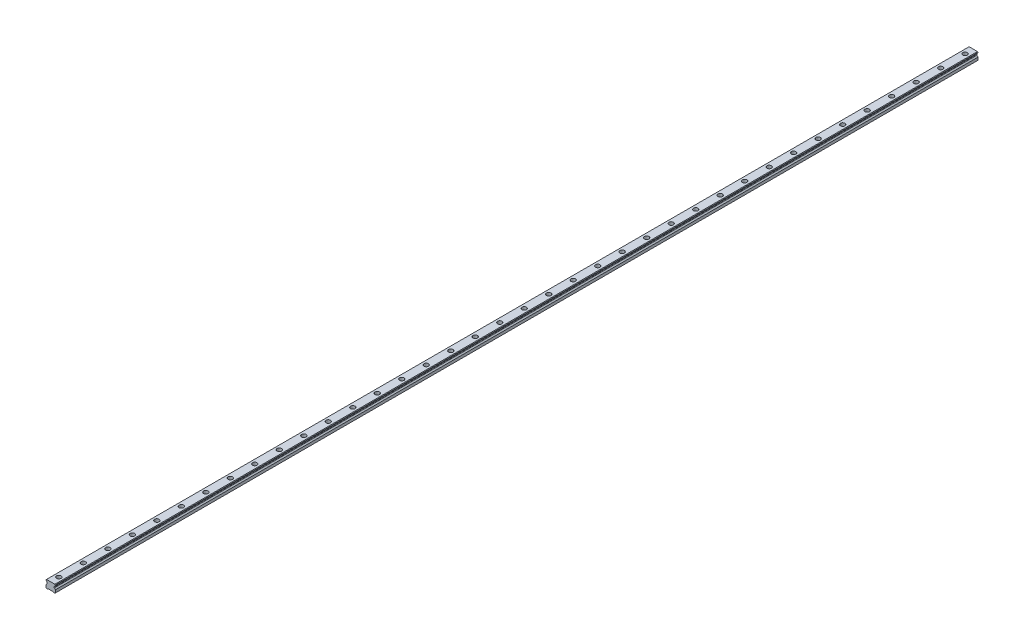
ISO-10303-21;
HEADER;
FILE_DESCRIPTION(('STEP AP214'),'2;1');
FILE_NAME('part.step','',(''),(''),'','','');
FILE_SCHEMA(('AUTOMOTIVE_DESIGN { 1 0 10303 214 1 1 1 1 }'));
ENDSEC;
DATA;
#1=APPLICATION_CONTEXT('core data for automotive mechanical design processes');
#2=APPLICATION_PROTOCOL_DEFINITION('international standard','automotive_design',2000,#1);
#3=PRODUCT_CONTEXT('',#1,'mechanical');
#4=PRODUCT('Part','Part','',(#3));
#5=PRODUCT_RELATED_PRODUCT_CATEGORY('part','',(#4));
#6=PRODUCT_DEFINITION_FORMATION('','',#4);
#7=PRODUCT_DEFINITION_CONTEXT('part definition',#1,'design');
#8=PRODUCT_DEFINITION('design','',#6,#7);
#9=PRODUCT_DEFINITION_SHAPE('','',#8);
#10=(LENGTH_UNIT() NAMED_UNIT(*) SI_UNIT(.MILLI.,.METRE.));
#11=(NAMED_UNIT(*) PLANE_ANGLE_UNIT() SI_UNIT($,.RADIAN.));
#12=(NAMED_UNIT(*) SI_UNIT($,.STERADIAN.) SOLID_ANGLE_UNIT());
#13=UNCERTAINTY_MEASURE_WITH_UNIT(LENGTH_MEASURE(1.E-05),#10,'distance_accuracy_value','');
#14=(GEOMETRIC_REPRESENTATION_CONTEXT(3) GLOBAL_UNCERTAINTY_ASSIGNED_CONTEXT((#13)) GLOBAL_UNIT_ASSIGNED_CONTEXT((#10,
#11,#12)) REPRESENTATION_CONTEXT('',''));
#15=CARTESIAN_POINT('',(0.,0.,0.));
#16=DIRECTION('',(0.,0.,1.));
#17=DIRECTION('',(1.,0.,0.));
#18=AXIS2_PLACEMENT_3D('',#15,#16,#17);
#19=CARTESIAN_POINT('',(0.,10.2,-1110.));
#20=DIRECTION('',(0.,1.,0.));
#21=DIRECTION('',(0.,0.,1.));
#22=AXIS2_PLACEMENT_3D('',#19,#20,#21);
#23=PLANE('',#22);
#24=CARTESIAN_POINT('',(0.,10.2,-1110.));
#25=DIRECTION('',(0.,1.,0.));
#26=DIRECTION('',(0.,0.,1.));
#27=AXIS2_PLACEMENT_3D('',#24,#25,#26);
#28=CIRCLE('',#27,3.49999999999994);
#29=CARTESIAN_POINT('',(0.,10.2,-1106.5));
#30=VERTEX_POINT('',#29);
#31=EDGE_CURVE('E646',#30,#30,#28,.T.);
#32=ORIENTED_EDGE('',*,*,#31,.F.);
#33=EDGE_LOOP('',(#32));
#34=FACE_BOUND('',#33,.T.);
#35=CARTESIAN_POINT('',(0.,10.2,-1110.));
#36=DIRECTION('',(0.,1.,0.));
#37=DIRECTION('',(0.,0.,1.));
#38=AXIS2_PLACEMENT_3D('',#35,#36,#37);
#39=CIRCLE('',#38,5.49999999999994);
#40=CARTESIAN_POINT('',(0.,10.2,-1104.5));
#41=VERTEX_POINT('',#40);
#42=EDGE_CURVE('E11',#41,#41,#39,.T.);
#43=ORIENTED_EDGE('',*,*,#42,.T.);
#44=EDGE_LOOP('',(#43));
#45=FACE_BOUND('',#44,.T.);
#46=ADVANCED_FACE('F39',(#34,#45),#23,.T.);
#47=CARTESIAN_POINT('',(0.,10.2,-1110.));
#48=DIRECTION('',(0.,1.,0.));
#49=DIRECTION('',(0.,0.,1.));
#50=AXIS2_PLACEMENT_3D('',#47,#48,#49);
#51=CYLINDRICAL_SURFACE('',#50,5.49999999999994);
#52=ORIENTED_EDGE('',*,*,#42,.F.);
#53=EDGE_LOOP('',(#52));
#54=FACE_BOUND('',#53,.T.);
#55=CARTESIAN_POINT('',(0.,19.2,-1110.));
#56=DIRECTION('',(0.,1.,0.));
#57=DIRECTION('',(0.,0.,1.));
#58=AXIS2_PLACEMENT_3D('',#55,#56,#57);
#59=CIRCLE('',#58,5.49999999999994);
#60=CARTESIAN_POINT('',(0.,19.2,-1104.5));
#61=VERTEX_POINT('',#60);
#62=EDGE_CURVE('E48',#61,#61,#59,.T.);
#63=ORIENTED_EDGE('',*,*,#62,.T.);
#64=EDGE_LOOP('',(#63));
#65=FACE_BOUND('',#64,.T.);
#66=ADVANCED_FACE('F1128',(#54,#65),#51,.F.);
#67=CARTESIAN_POINT('',(0.,10.2,-1050.));
#68=DIRECTION('',(0.,1.,0.));
#69=DIRECTION('',(0.,0.,1.));
#70=AXIS2_PLACEMENT_3D('',#67,#68,#69);
#71=PLANE('',#70);
#72=CARTESIAN_POINT('',(0.,10.2,-1050.));
#73=DIRECTION('',(0.,1.,0.));
#74=DIRECTION('',(0.,0.,1.));
#75=AXIS2_PLACEMENT_3D('',#72,#73,#74);
#76=CIRCLE('',#75,3.49999999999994);
#77=CARTESIAN_POINT('',(0.,10.2,-1046.5));
#78=VERTEX_POINT('',#77);
#79=EDGE_CURVE('E651',#78,#78,#76,.T.);
#80=ORIENTED_EDGE('',*,*,#79,.F.);
#81=EDGE_LOOP('',(#80));
#82=FACE_BOUND('',#81,.T.);
#83=CARTESIAN_POINT('',(0.,10.2,-1050.));
#84=DIRECTION('',(0.,1.,0.));
#85=DIRECTION('',(0.,0.,1.));
#86=AXIS2_PLACEMENT_3D('',#83,#84,#85);
#87=CIRCLE('',#86,5.49999999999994);
#88=CARTESIAN_POINT('',(0.,10.2,-1044.5));
#89=VERTEX_POINT('',#88);
#90=EDGE_CURVE('E630',#89,#89,#87,.T.);
#91=ORIENTED_EDGE('',*,*,#90,.T.);
#92=EDGE_LOOP('',(#91));
#93=FACE_BOUND('',#92,.T.);
#94=ADVANCED_FACE('F1130',(#82,#93),#71,.T.);
#95=CARTESIAN_POINT('',(0.,10.2,-1050.));
#96=DIRECTION('',(0.,1.,0.));
#97=DIRECTION('',(0.,0.,1.));
#98=AXIS2_PLACEMENT_3D('',#95,#96,#97);
#99=CYLINDRICAL_SURFACE('',#98,5.49999999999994);
#100=ORIENTED_EDGE('',*,*,#90,.F.);
#101=EDGE_LOOP('',(#100));
#102=FACE_BOUND('',#101,.T.);
#103=CARTESIAN_POINT('',(0.,19.2,-1050.));
#104=DIRECTION('',(0.,1.,0.));
#105=DIRECTION('',(0.,0.,1.));
#106=AXIS2_PLACEMENT_3D('',#103,#104,#105);
#107=CIRCLE('',#106,5.49999999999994);
#108=CARTESIAN_POINT('',(0.,19.2,-1044.5));
#109=VERTEX_POINT('',#108);
#110=EDGE_CURVE('E626',#109,#109,#107,.T.);
#111=ORIENTED_EDGE('',*,*,#110,.T.);
#112=EDGE_LOOP('',(#111));
#113=FACE_BOUND('',#112,.T.);
#114=ADVANCED_FACE('F1136',(#102,#113),#99,.F.);
#115=CARTESIAN_POINT('',(0.,10.2,-990.));
#116=DIRECTION('',(0.,1.,0.));
#117=DIRECTION('',(0.,0.,1.));
#118=AXIS2_PLACEMENT_3D('',#115,#116,#117);
#119=PLANE('',#118);
#120=CARTESIAN_POINT('',(0.,10.2,-990.));
#121=DIRECTION('',(0.,1.,0.));
#122=DIRECTION('',(0.,0.,1.));
#123=AXIS2_PLACEMENT_3D('',#120,#121,#122);
#124=CIRCLE('',#123,3.49999999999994);
#125=CARTESIAN_POINT('',(0.,10.2,-986.5));
#126=VERTEX_POINT('',#125);
#127=EDGE_CURVE('E656',#126,#126,#124,.T.);
#128=ORIENTED_EDGE('',*,*,#127,.F.);
#129=EDGE_LOOP('',(#128));
#130=FACE_BOUND('',#129,.T.);
#131=CARTESIAN_POINT('',(0.,10.2,-990.));
#132=DIRECTION('',(0.,1.,0.));
#133=DIRECTION('',(0.,0.,1.));
#134=AXIS2_PLACEMENT_3D('',#131,#132,#133);
#135=CIRCLE('',#134,5.49999999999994);
#136=CARTESIAN_POINT('',(0.,10.2,-984.5));
#137=VERTEX_POINT('',#136);
#138=EDGE_CURVE('E622',#137,#137,#135,.T.);
#139=ORIENTED_EDGE('',*,*,#138,.T.);
#140=EDGE_LOOP('',(#139));
#141=FACE_BOUND('',#140,.T.);
#142=ADVANCED_FACE('F1144',(#130,#141),#119,.T.);
#143=CARTESIAN_POINT('',(0.,10.2,-990.));
#144=DIRECTION('',(0.,1.,0.));
#145=DIRECTION('',(0.,0.,1.));
#146=AXIS2_PLACEMENT_3D('',#143,#144,#145);
#147=CYLINDRICAL_SURFACE('',#146,5.49999999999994);
#148=ORIENTED_EDGE('',*,*,#138,.F.);
#149=EDGE_LOOP('',(#148));
#150=FACE_BOUND('',#149,.T.);
#151=CARTESIAN_POINT('',(0.,19.2,-990.));
#152=DIRECTION('',(0.,1.,0.));
#153=DIRECTION('',(0.,0.,1.));
#154=AXIS2_PLACEMENT_3D('',#151,#152,#153);
#155=CIRCLE('',#154,5.49999999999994);
#156=CARTESIAN_POINT('',(0.,19.2,-984.5));
#157=VERTEX_POINT('',#156);
#158=EDGE_CURVE('E618',#157,#157,#155,.T.);
#159=ORIENTED_EDGE('',*,*,#158,.T.);
#160=EDGE_LOOP('',(#159));
#161=FACE_BOUND('',#160,.T.);
#162=ADVANCED_FACE('F1148',(#150,#161),#147,.F.);
#163=CARTESIAN_POINT('',(0.,10.2,-930.));
#164=DIRECTION('',(0.,1.,0.));
#165=DIRECTION('',(0.,0.,1.));
#166=AXIS2_PLACEMENT_3D('',#163,#164,#165);
#167=PLANE('',#166);
#168=CARTESIAN_POINT('',(0.,10.2,-930.));
#169=DIRECTION('',(0.,1.,0.));
#170=DIRECTION('',(0.,0.,1.));
#171=AXIS2_PLACEMENT_3D('',#168,#169,#170);
#172=CIRCLE('',#171,3.49999999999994);
#173=CARTESIAN_POINT('',(0.,10.2,-926.5));
#174=VERTEX_POINT('',#173);
#175=EDGE_CURVE('E661',#174,#174,#172,.T.);
#176=ORIENTED_EDGE('',*,*,#175,.F.);
#177=EDGE_LOOP('',(#176));
#178=FACE_BOUND('',#177,.T.);
#179=CARTESIAN_POINT('',(0.,10.2,-930.));
#180=DIRECTION('',(0.,1.,0.));
#181=DIRECTION('',(0.,0.,1.));
#182=AXIS2_PLACEMENT_3D('',#179,#180,#181);
#183=CIRCLE('',#182,5.49999999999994);
#184=CARTESIAN_POINT('',(0.,10.2,-924.5));
#185=VERTEX_POINT('',#184);
#186=EDGE_CURVE('E614',#185,#185,#183,.T.);
#187=ORIENTED_EDGE('',*,*,#186,.T.);
#188=EDGE_LOOP('',(#187));
#189=FACE_BOUND('',#188,.T.);
#190=ADVANCED_FACE('F1152',(#178,#189),#167,.T.);
#191=CARTESIAN_POINT('',(0.,10.2,-930.));
#192=DIRECTION('',(0.,1.,0.));
#193=DIRECTION('',(0.,0.,1.));
#194=AXIS2_PLACEMENT_3D('',#191,#192,#193);
#195=CYLINDRICAL_SURFACE('',#194,5.49999999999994);
#196=ORIENTED_EDGE('',*,*,#186,.F.);
#197=EDGE_LOOP('',(#196));
#198=FACE_BOUND('',#197,.T.);
#199=CARTESIAN_POINT('',(0.,19.2,-930.));
#200=DIRECTION('',(0.,1.,0.));
#201=DIRECTION('',(0.,0.,1.));
#202=AXIS2_PLACEMENT_3D('',#199,#200,#201);
#203=CIRCLE('',#202,5.49999999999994);
#204=CARTESIAN_POINT('',(0.,19.2,-924.5));
#205=VERTEX_POINT('',#204);
#206=EDGE_CURVE('E610',#205,#205,#203,.T.);
#207=ORIENTED_EDGE('',*,*,#206,.T.);
#208=EDGE_LOOP('',(#207));
#209=FACE_BOUND('',#208,.T.);
#210=ADVANCED_FACE('F1156',(#198,#209),#195,.F.);
#211=CARTESIAN_POINT('',(0.,10.2,-870.));
#212=DIRECTION('',(0.,1.,0.));
#213=DIRECTION('',(0.,0.,1.));
#214=AXIS2_PLACEMENT_3D('',#211,#212,#213);
#215=PLANE('',#214);
#216=CARTESIAN_POINT('',(0.,10.2,-870.));
#217=DIRECTION('',(0.,1.,0.));
#218=DIRECTION('',(0.,0.,1.));
#219=AXIS2_PLACEMENT_3D('',#216,#217,#218);
#220=CIRCLE('',#219,3.49999999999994);
#221=CARTESIAN_POINT('',(0.,10.2,-866.5));
#222=VERTEX_POINT('',#221);
#223=EDGE_CURVE('E666',#222,#222,#220,.T.);
#224=ORIENTED_EDGE('',*,*,#223,.F.);
#225=EDGE_LOOP('',(#224));
#226=FACE_BOUND('',#225,.T.);
#227=CARTESIAN_POINT('',(0.,10.2,-870.));
#228=DIRECTION('',(0.,1.,0.));
#229=DIRECTION('',(0.,0.,1.));
#230=AXIS2_PLACEMENT_3D('',#227,#228,#229);
#231=CIRCLE('',#230,5.49999999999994);
#232=CARTESIAN_POINT('',(0.,10.2,-864.5));
#233=VERTEX_POINT('',#232);
#234=EDGE_CURVE('E606',#233,#233,#231,.T.);
#235=ORIENTED_EDGE('',*,*,#234,.T.);
#236=EDGE_LOOP('',(#235));
#237=FACE_BOUND('',#236,.T.);
#238=ADVANCED_FACE('F1160',(#226,#237),#215,.T.);
#239=CARTESIAN_POINT('',(0.,10.2,-870.));
#240=DIRECTION('',(0.,1.,0.));
#241=DIRECTION('',(0.,0.,1.));
#242=AXIS2_PLACEMENT_3D('',#239,#240,#241);
#243=CYLINDRICAL_SURFACE('',#242,5.49999999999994);
#244=ORIENTED_EDGE('',*,*,#234,.F.);
#245=EDGE_LOOP('',(#244));
#246=FACE_BOUND('',#245,.T.);
#247=CARTESIAN_POINT('',(0.,19.2,-870.));
#248=DIRECTION('',(0.,1.,0.));
#249=DIRECTION('',(0.,0.,1.));
#250=AXIS2_PLACEMENT_3D('',#247,#248,#249);
#251=CIRCLE('',#250,5.49999999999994);
#252=CARTESIAN_POINT('',(0.,19.2,-864.5));
#253=VERTEX_POINT('',#252);
#254=EDGE_CURVE('E602',#253,#253,#251,.T.);
#255=ORIENTED_EDGE('',*,*,#254,.T.);
#256=EDGE_LOOP('',(#255));
#257=FACE_BOUND('',#256,.T.);
#258=ADVANCED_FACE('F1164',(#246,#257),#243,.F.);
#259=CARTESIAN_POINT('',(0.,10.2,-810.));
#260=DIRECTION('',(0.,1.,0.));
#261=DIRECTION('',(0.,0.,1.));
#262=AXIS2_PLACEMENT_3D('',#259,#260,#261);
#263=PLANE('',#262);
#264=CARTESIAN_POINT('',(0.,10.2,-810.));
#265=DIRECTION('',(0.,1.,0.));
#266=DIRECTION('',(0.,0.,1.));
#267=AXIS2_PLACEMENT_3D('',#264,#265,#266);
#268=CIRCLE('',#267,3.49999999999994);
#269=CARTESIAN_POINT('',(0.,10.2,-806.5));
#270=VERTEX_POINT('',#269);
#271=EDGE_CURVE('E671',#270,#270,#268,.T.);
#272=ORIENTED_EDGE('',*,*,#271,.F.);
#273=EDGE_LOOP('',(#272));
#274=FACE_BOUND('',#273,.T.);
#275=CARTESIAN_POINT('',(0.,10.2,-810.));
#276=DIRECTION('',(0.,1.,0.));
#277=DIRECTION('',(0.,0.,1.));
#278=AXIS2_PLACEMENT_3D('',#275,#276,#277);
#279=CIRCLE('',#278,5.49999999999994);
#280=CARTESIAN_POINT('',(0.,10.2,-804.5));
#281=VERTEX_POINT('',#280);
#282=EDGE_CURVE('E598',#281,#281,#279,.T.);
#283=ORIENTED_EDGE('',*,*,#282,.T.);
#284=EDGE_LOOP('',(#283));
#285=FACE_BOUND('',#284,.T.);
#286=ADVANCED_FACE('F1168',(#274,#285),#263,.T.);
#287=CARTESIAN_POINT('',(0.,10.2,-810.));
#288=DIRECTION('',(0.,1.,0.));
#289=DIRECTION('',(0.,0.,1.));
#290=AXIS2_PLACEMENT_3D('',#287,#288,#289);
#291=CYLINDRICAL_SURFACE('',#290,5.49999999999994);
#292=ORIENTED_EDGE('',*,*,#282,.F.);
#293=EDGE_LOOP('',(#292));
#294=FACE_BOUND('',#293,.T.);
#295=CARTESIAN_POINT('',(0.,19.2,-810.));
#296=DIRECTION('',(0.,1.,0.));
#297=DIRECTION('',(0.,0.,1.));
#298=AXIS2_PLACEMENT_3D('',#295,#296,#297);
#299=CIRCLE('',#298,5.49999999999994);
#300=CARTESIAN_POINT('',(0.,19.2,-804.5));
#301=VERTEX_POINT('',#300);
#302=EDGE_CURVE('E594',#301,#301,#299,.T.);
#303=ORIENTED_EDGE('',*,*,#302,.T.);
#304=EDGE_LOOP('',(#303));
#305=FACE_BOUND('',#304,.T.);
#306=ADVANCED_FACE('F1172',(#294,#305),#291,.F.);
#307=CARTESIAN_POINT('',(0.,10.2,-750.));
#308=DIRECTION('',(0.,1.,0.));
#309=DIRECTION('',(0.,0.,1.));
#310=AXIS2_PLACEMENT_3D('',#307,#308,#309);
#311=PLANE('',#310);
#312=CARTESIAN_POINT('',(0.,10.2,-750.));
#313=DIRECTION('',(0.,1.,0.));
#314=DIRECTION('',(0.,0.,1.));
#315=AXIS2_PLACEMENT_3D('',#312,#313,#314);
#316=CIRCLE('',#315,3.49999999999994);
#317=CARTESIAN_POINT('',(0.,10.2,-746.5));
#318=VERTEX_POINT('',#317);
#319=EDGE_CURVE('E676',#318,#318,#316,.T.);
#320=ORIENTED_EDGE('',*,*,#319,.F.);
#321=EDGE_LOOP('',(#320));
#322=FACE_BOUND('',#321,.T.);
#323=CARTESIAN_POINT('',(0.,10.2,-750.));
#324=DIRECTION('',(0.,1.,0.));
#325=DIRECTION('',(0.,0.,1.));
#326=AXIS2_PLACEMENT_3D('',#323,#324,#325);
#327=CIRCLE('',#326,5.49999999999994);
#328=CARTESIAN_POINT('',(0.,10.2,-744.5));
#329=VERTEX_POINT('',#328);
#330=EDGE_CURVE('E590',#329,#329,#327,.T.);
#331=ORIENTED_EDGE('',*,*,#330,.T.);
#332=EDGE_LOOP('',(#331));
#333=FACE_BOUND('',#332,.T.);
#334=ADVANCED_FACE('F1176',(#322,#333),#311,.T.);
#335=CARTESIAN_POINT('',(0.,10.2,-750.));
#336=DIRECTION('',(0.,1.,0.));
#337=DIRECTION('',(0.,0.,1.));
#338=AXIS2_PLACEMENT_3D('',#335,#336,#337);
#339=CYLINDRICAL_SURFACE('',#338,5.49999999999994);
#340=ORIENTED_EDGE('',*,*,#330,.F.);
#341=EDGE_LOOP('',(#340));
#342=FACE_BOUND('',#341,.T.);
#343=CARTESIAN_POINT('',(0.,19.2,-750.));
#344=DIRECTION('',(0.,1.,0.));
#345=DIRECTION('',(0.,0.,1.));
#346=AXIS2_PLACEMENT_3D('',#343,#344,#345);
#347=CIRCLE('',#346,5.49999999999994);
#348=CARTESIAN_POINT('',(0.,19.2,-744.5));
#349=VERTEX_POINT('',#348);
#350=EDGE_CURVE('E586',#349,#349,#347,.T.);
#351=ORIENTED_EDGE('',*,*,#350,.T.);
#352=EDGE_LOOP('',(#351));
#353=FACE_BOUND('',#352,.T.);
#354=ADVANCED_FACE('F1180',(#342,#353),#339,.F.);
#355=CARTESIAN_POINT('',(0.,10.2,-690.));
#356=DIRECTION('',(0.,1.,0.));
#357=DIRECTION('',(0.,0.,1.));
#358=AXIS2_PLACEMENT_3D('',#355,#356,#357);
#359=PLANE('',#358);
#360=CARTESIAN_POINT('',(0.,10.2,-690.));
#361=DIRECTION('',(0.,1.,0.));
#362=DIRECTION('',(0.,0.,1.));
#363=AXIS2_PLACEMENT_3D('',#360,#361,#362);
#364=CIRCLE('',#363,3.49999999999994);
#365=CARTESIAN_POINT('',(0.,10.2,-686.5));
#366=VERTEX_POINT('',#365);
#367=EDGE_CURVE('E681',#366,#366,#364,.T.);
#368=ORIENTED_EDGE('',*,*,#367,.F.);
#369=EDGE_LOOP('',(#368));
#370=FACE_BOUND('',#369,.T.);
#371=CARTESIAN_POINT('',(0.,10.2,-690.));
#372=DIRECTION('',(0.,1.,0.));
#373=DIRECTION('',(0.,0.,1.));
#374=AXIS2_PLACEMENT_3D('',#371,#372,#373);
#375=CIRCLE('',#374,5.49999999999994);
#376=CARTESIAN_POINT('',(0.,10.2,-684.5));
#377=VERTEX_POINT('',#376);
#378=EDGE_CURVE('E582',#377,#377,#375,.T.);
#379=ORIENTED_EDGE('',*,*,#378,.T.);
#380=EDGE_LOOP('',(#379));
#381=FACE_BOUND('',#380,.T.);
#382=ADVANCED_FACE('F1184',(#370,#381),#359,.T.);
#383=CARTESIAN_POINT('',(0.,10.2,-690.));
#384=DIRECTION('',(0.,1.,0.));
#385=DIRECTION('',(0.,0.,1.));
#386=AXIS2_PLACEMENT_3D('',#383,#384,#385);
#387=CYLINDRICAL_SURFACE('',#386,5.49999999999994);
#388=ORIENTED_EDGE('',*,*,#378,.F.);
#389=EDGE_LOOP('',(#388));
#390=FACE_BOUND('',#389,.T.);
#391=CARTESIAN_POINT('',(0.,19.2,-690.));
#392=DIRECTION('',(0.,1.,0.));
#393=DIRECTION('',(0.,0.,1.));
#394=AXIS2_PLACEMENT_3D('',#391,#392,#393);
#395=CIRCLE('',#394,5.49999999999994);
#396=CARTESIAN_POINT('',(0.,19.2,-684.5));
#397=VERTEX_POINT('',#396);
#398=EDGE_CURVE('E578',#397,#397,#395,.T.);
#399=ORIENTED_EDGE('',*,*,#398,.T.);
#400=EDGE_LOOP('',(#399));
#401=FACE_BOUND('',#400,.T.);
#402=ADVANCED_FACE('F1188',(#390,#401),#387,.F.);
#403=CARTESIAN_POINT('',(0.,10.2,-630.));
#404=DIRECTION('',(0.,1.,0.));
#405=DIRECTION('',(0.,0.,1.));
#406=AXIS2_PLACEMENT_3D('',#403,#404,#405);
#407=PLANE('',#406);
#408=CARTESIAN_POINT('',(0.,10.2,-630.));
#409=DIRECTION('',(0.,1.,0.));
#410=DIRECTION('',(0.,0.,1.));
#411=AXIS2_PLACEMENT_3D('',#408,#409,#410);
#412=CIRCLE('',#411,3.49999999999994);
#413=CARTESIAN_POINT('',(0.,10.2,-626.5));
#414=VERTEX_POINT('',#413);
#415=EDGE_CURVE('E686',#414,#414,#412,.T.);
#416=ORIENTED_EDGE('',*,*,#415,.F.);
#417=EDGE_LOOP('',(#416));
#418=FACE_BOUND('',#417,.T.);
#419=CARTESIAN_POINT('',(0.,10.2,-630.));
#420=DIRECTION('',(0.,1.,0.));
#421=DIRECTION('',(0.,0.,1.));
#422=AXIS2_PLACEMENT_3D('',#419,#420,#421);
#423=CIRCLE('',#422,5.49999999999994);
#424=CARTESIAN_POINT('',(0.,10.2,-624.5));
#425=VERTEX_POINT('',#424);
#426=EDGE_CURVE('E574',#425,#425,#423,.T.);
#427=ORIENTED_EDGE('',*,*,#426,.T.);
#428=EDGE_LOOP('',(#427));
#429=FACE_BOUND('',#428,.T.);
#430=ADVANCED_FACE('F1192',(#418,#429),#407,.T.);
#431=CARTESIAN_POINT('',(0.,10.2,-630.));
#432=DIRECTION('',(0.,1.,0.));
#433=DIRECTION('',(0.,0.,1.));
#434=AXIS2_PLACEMENT_3D('',#431,#432,#433);
#435=CYLINDRICAL_SURFACE('',#434,5.49999999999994);
#436=ORIENTED_EDGE('',*,*,#426,.F.);
#437=EDGE_LOOP('',(#436));
#438=FACE_BOUND('',#437,.T.);
#439=CARTESIAN_POINT('',(0.,19.2,-630.));
#440=DIRECTION('',(0.,1.,0.));
#441=DIRECTION('',(0.,0.,1.));
#442=AXIS2_PLACEMENT_3D('',#439,#440,#441);
#443=CIRCLE('',#442,5.49999999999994);
#444=CARTESIAN_POINT('',(0.,19.2,-624.5));
#445=VERTEX_POINT('',#444);
#446=EDGE_CURVE('E570',#445,#445,#443,.T.);
#447=ORIENTED_EDGE('',*,*,#446,.T.);
#448=EDGE_LOOP('',(#447));
#449=FACE_BOUND('',#448,.T.);
#450=ADVANCED_FACE('F1196',(#438,#449),#435,.F.);
#451=CARTESIAN_POINT('',(0.,10.2,-570.));
#452=DIRECTION('',(0.,1.,0.));
#453=DIRECTION('',(0.,0.,1.));
#454=AXIS2_PLACEMENT_3D('',#451,#452,#453);
#455=PLANE('',#454);
#456=CARTESIAN_POINT('',(0.,10.2,-570.));
#457=DIRECTION('',(0.,1.,0.));
#458=DIRECTION('',(0.,0.,1.));
#459=AXIS2_PLACEMENT_3D('',#456,#457,#458);
#460=CIRCLE('',#459,3.49999999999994);
#461=CARTESIAN_POINT('',(0.,10.2,-566.5));
#462=VERTEX_POINT('',#461);
#463=EDGE_CURVE('E691',#462,#462,#460,.T.);
#464=ORIENTED_EDGE('',*,*,#463,.F.);
#465=EDGE_LOOP('',(#464));
#466=FACE_BOUND('',#465,.T.);
#467=CARTESIAN_POINT('',(0.,10.2,-570.));
#468=DIRECTION('',(0.,1.,0.));
#469=DIRECTION('',(0.,0.,1.));
#470=AXIS2_PLACEMENT_3D('',#467,#468,#469);
#471=CIRCLE('',#470,5.49999999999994);
#472=CARTESIAN_POINT('',(0.,10.2,-564.5));
#473=VERTEX_POINT('',#472);
#474=EDGE_CURVE('E566',#473,#473,#471,.T.);
#475=ORIENTED_EDGE('',*,*,#474,.T.);
#476=EDGE_LOOP('',(#475));
#477=FACE_BOUND('',#476,.T.);
#478=ADVANCED_FACE('F1200',(#466,#477),#455,.T.);
#479=CARTESIAN_POINT('',(0.,10.2,-570.));
#480=DIRECTION('',(0.,1.,0.));
#481=DIRECTION('',(0.,0.,1.));
#482=AXIS2_PLACEMENT_3D('',#479,#480,#481);
#483=CYLINDRICAL_SURFACE('',#482,5.49999999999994);
#484=ORIENTED_EDGE('',*,*,#474,.F.);
#485=EDGE_LOOP('',(#484));
#486=FACE_BOUND('',#485,.T.);
#487=CARTESIAN_POINT('',(0.,19.2,-570.));
#488=DIRECTION('',(0.,1.,0.));
#489=DIRECTION('',(0.,0.,1.));
#490=AXIS2_PLACEMENT_3D('',#487,#488,#489);
#491=CIRCLE('',#490,5.49999999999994);
#492=CARTESIAN_POINT('',(0.,19.2,-564.5));
#493=VERTEX_POINT('',#492);
#494=EDGE_CURVE('E562',#493,#493,#491,.T.);
#495=ORIENTED_EDGE('',*,*,#494,.T.);
#496=EDGE_LOOP('',(#495));
#497=FACE_BOUND('',#496,.T.);
#498=ADVANCED_FACE('F1204',(#486,#497),#483,.F.);
#499=CARTESIAN_POINT('',(0.,10.2,-510.));
#500=DIRECTION('',(0.,1.,0.));
#501=DIRECTION('',(0.,0.,1.));
#502=AXIS2_PLACEMENT_3D('',#499,#500,#501);
#503=PLANE('',#502);
#504=CARTESIAN_POINT('',(0.,10.2,-510.));
#505=DIRECTION('',(0.,1.,0.));
#506=DIRECTION('',(0.,0.,1.));
#507=AXIS2_PLACEMENT_3D('',#504,#505,#506);
#508=CIRCLE('',#507,3.49999999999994);
#509=CARTESIAN_POINT('',(0.,10.2,-506.5));
#510=VERTEX_POINT('',#509);
#511=EDGE_CURVE('E696',#510,#510,#508,.T.);
#512=ORIENTED_EDGE('',*,*,#511,.F.);
#513=EDGE_LOOP('',(#512));
#514=FACE_BOUND('',#513,.T.);
#515=CARTESIAN_POINT('',(0.,10.2,-510.));
#516=DIRECTION('',(0.,1.,0.));
#517=DIRECTION('',(0.,0.,1.));
#518=AXIS2_PLACEMENT_3D('',#515,#516,#517);
#519=CIRCLE('',#518,5.49999999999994);
#520=CARTESIAN_POINT('',(0.,10.2,-504.5));
#521=VERTEX_POINT('',#520);
#522=EDGE_CURVE('E558',#521,#521,#519,.T.);
#523=ORIENTED_EDGE('',*,*,#522,.T.);
#524=EDGE_LOOP('',(#523));
#525=FACE_BOUND('',#524,.T.);
#526=ADVANCED_FACE('F1208',(#514,#525),#503,.T.);
#527=CARTESIAN_POINT('',(0.,10.2,-510.));
#528=DIRECTION('',(0.,1.,0.));
#529=DIRECTION('',(0.,0.,1.));
#530=AXIS2_PLACEMENT_3D('',#527,#528,#529);
#531=CYLINDRICAL_SURFACE('',#530,5.49999999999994);
#532=ORIENTED_EDGE('',*,*,#522,.F.);
#533=EDGE_LOOP('',(#532));
#534=FACE_BOUND('',#533,.T.);
#535=CARTESIAN_POINT('',(0.,19.2,-510.));
#536=DIRECTION('',(0.,1.,0.));
#537=DIRECTION('',(0.,0.,1.));
#538=AXIS2_PLACEMENT_3D('',#535,#536,#537);
#539=CIRCLE('',#538,5.49999999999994);
#540=CARTESIAN_POINT('',(0.,19.2,-504.5));
#541=VERTEX_POINT('',#540);
#542=EDGE_CURVE('E554',#541,#541,#539,.T.);
#543=ORIENTED_EDGE('',*,*,#542,.T.);
#544=EDGE_LOOP('',(#543));
#545=FACE_BOUND('',#544,.T.);
#546=ADVANCED_FACE('F1212',(#534,#545),#531,.F.);
#547=CARTESIAN_POINT('',(0.,10.2,-450.));
#548=DIRECTION('',(0.,1.,0.));
#549=DIRECTION('',(0.,0.,1.));
#550=AXIS2_PLACEMENT_3D('',#547,#548,#549);
#551=PLANE('',#550);
#552=CARTESIAN_POINT('',(0.,10.2,-450.));
#553=DIRECTION('',(0.,1.,0.));
#554=DIRECTION('',(0.,0.,1.));
#555=AXIS2_PLACEMENT_3D('',#552,#553,#554);
#556=CIRCLE('',#555,3.49999999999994);
#557=CARTESIAN_POINT('',(0.,10.2,-446.5));
#558=VERTEX_POINT('',#557);
#559=EDGE_CURVE('E701',#558,#558,#556,.T.);
#560=ORIENTED_EDGE('',*,*,#559,.F.);
#561=EDGE_LOOP('',(#560));
#562=FACE_BOUND('',#561,.T.);
#563=CARTESIAN_POINT('',(0.,10.2,-450.));
#564=DIRECTION('',(0.,1.,0.));
#565=DIRECTION('',(0.,0.,1.));
#566=AXIS2_PLACEMENT_3D('',#563,#564,#565);
#567=CIRCLE('',#566,5.49999999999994);
#568=CARTESIAN_POINT('',(0.,10.2,-444.5));
#569=VERTEX_POINT('',#568);
#570=EDGE_CURVE('E550',#569,#569,#567,.T.);
#571=ORIENTED_EDGE('',*,*,#570,.T.);
#572=EDGE_LOOP('',(#571));
#573=FACE_BOUND('',#572,.T.);
#574=ADVANCED_FACE('F1216',(#562,#573),#551,.T.);
#575=CARTESIAN_POINT('',(0.,10.2,-450.));
#576=DIRECTION('',(0.,1.,0.));
#577=DIRECTION('',(0.,0.,1.));
#578=AXIS2_PLACEMENT_3D('',#575,#576,#577);
#579=CYLINDRICAL_SURFACE('',#578,5.49999999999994);
#580=ORIENTED_EDGE('',*,*,#570,.F.);
#581=EDGE_LOOP('',(#580));
#582=FACE_BOUND('',#581,.T.);
#583=CARTESIAN_POINT('',(0.,19.2,-450.));
#584=DIRECTION('',(0.,1.,0.));
#585=DIRECTION('',(0.,0.,1.));
#586=AXIS2_PLACEMENT_3D('',#583,#584,#585);
#587=CIRCLE('',#586,5.49999999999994);
#588=CARTESIAN_POINT('',(0.,19.2,-444.5));
#589=VERTEX_POINT('',#588);
#590=EDGE_CURVE('E546',#589,#589,#587,.T.);
#591=ORIENTED_EDGE('',*,*,#590,.T.);
#592=EDGE_LOOP('',(#591));
#593=FACE_BOUND('',#592,.T.);
#594=ADVANCED_FACE('F1220',(#582,#593),#579,.F.);
#595=CARTESIAN_POINT('',(0.,10.2,-390.));
#596=DIRECTION('',(0.,1.,0.));
#597=DIRECTION('',(0.,0.,1.));
#598=AXIS2_PLACEMENT_3D('',#595,#596,#597);
#599=PLANE('',#598);
#600=CARTESIAN_POINT('',(0.,10.2,-390.));
#601=DIRECTION('',(0.,1.,0.));
#602=DIRECTION('',(0.,0.,1.));
#603=AXIS2_PLACEMENT_3D('',#600,#601,#602);
#604=CIRCLE('',#603,3.49999999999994);
#605=CARTESIAN_POINT('',(0.,10.2,-386.5));
#606=VERTEX_POINT('',#605);
#607=EDGE_CURVE('E706',#606,#606,#604,.T.);
#608=ORIENTED_EDGE('',*,*,#607,.F.);
#609=EDGE_LOOP('',(#608));
#610=FACE_BOUND('',#609,.T.);
#611=CARTESIAN_POINT('',(0.,10.2,-390.));
#612=DIRECTION('',(0.,1.,0.));
#613=DIRECTION('',(0.,0.,1.));
#614=AXIS2_PLACEMENT_3D('',#611,#612,#613);
#615=CIRCLE('',#614,5.49999999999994);
#616=CARTESIAN_POINT('',(0.,10.2,-384.5));
#617=VERTEX_POINT('',#616);
#618=EDGE_CURVE('E542',#617,#617,#615,.T.);
#619=ORIENTED_EDGE('',*,*,#618,.T.);
#620=EDGE_LOOP('',(#619));
#621=FACE_BOUND('',#620,.T.);
#622=ADVANCED_FACE('F1224',(#610,#621),#599,.T.);
#623=CARTESIAN_POINT('',(0.,10.2,-390.));
#624=DIRECTION('',(0.,1.,0.));
#625=DIRECTION('',(0.,0.,1.));
#626=AXIS2_PLACEMENT_3D('',#623,#624,#625);
#627=CYLINDRICAL_SURFACE('',#626,5.49999999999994);
#628=ORIENTED_EDGE('',*,*,#618,.F.);
#629=EDGE_LOOP('',(#628));
#630=FACE_BOUND('',#629,.T.);
#631=CARTESIAN_POINT('',(0.,19.2,-390.));
#632=DIRECTION('',(0.,1.,0.));
#633=DIRECTION('',(0.,0.,1.));
#634=AXIS2_PLACEMENT_3D('',#631,#632,#633);
#635=CIRCLE('',#634,5.49999999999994);
#636=CARTESIAN_POINT('',(0.,19.2,-384.5));
#637=VERTEX_POINT('',#636);
#638=EDGE_CURVE('E538',#637,#637,#635,.T.);
#639=ORIENTED_EDGE('',*,*,#638,.T.);
#640=EDGE_LOOP('',(#639));
#641=FACE_BOUND('',#640,.T.);
#642=ADVANCED_FACE('F1228',(#630,#641),#627,.F.);
#643=CARTESIAN_POINT('',(0.,10.2,-330.));
#644=DIRECTION('',(0.,1.,0.));
#645=DIRECTION('',(0.,0.,1.));
#646=AXIS2_PLACEMENT_3D('',#643,#644,#645);
#647=PLANE('',#646);
#648=CARTESIAN_POINT('',(0.,10.2,-330.));
#649=DIRECTION('',(0.,1.,0.));
#650=DIRECTION('',(0.,0.,1.));
#651=AXIS2_PLACEMENT_3D('',#648,#649,#650);
#652=CIRCLE('',#651,3.49999999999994);
#653=CARTESIAN_POINT('',(0.,10.2,-326.5));
#654=VERTEX_POINT('',#653);
#655=EDGE_CURVE('E711',#654,#654,#652,.T.);
#656=ORIENTED_EDGE('',*,*,#655,.F.);
#657=EDGE_LOOP('',(#656));
#658=FACE_BOUND('',#657,.T.);
#659=CARTESIAN_POINT('',(0.,10.2,-330.));
#660=DIRECTION('',(0.,1.,0.));
#661=DIRECTION('',(0.,0.,1.));
#662=AXIS2_PLACEMENT_3D('',#659,#660,#661);
#663=CIRCLE('',#662,5.49999999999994);
#664=CARTESIAN_POINT('',(0.,10.2,-324.5));
#665=VERTEX_POINT('',#664);
#666=EDGE_CURVE('E534',#665,#665,#663,.T.);
#667=ORIENTED_EDGE('',*,*,#666,.T.);
#668=EDGE_LOOP('',(#667));
#669=FACE_BOUND('',#668,.T.);
#670=ADVANCED_FACE('F1232',(#658,#669),#647,.T.);
#671=CARTESIAN_POINT('',(0.,10.2,-330.));
#672=DIRECTION('',(0.,1.,0.));
#673=DIRECTION('',(0.,0.,1.));
#674=AXIS2_PLACEMENT_3D('',#671,#672,#673);
#675=CYLINDRICAL_SURFACE('',#674,5.49999999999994);
#676=ORIENTED_EDGE('',*,*,#666,.F.);
#677=EDGE_LOOP('',(#676));
#678=FACE_BOUND('',#677,.T.);
#679=CARTESIAN_POINT('',(0.,19.2,-330.));
#680=DIRECTION('',(0.,1.,0.));
#681=DIRECTION('',(0.,0.,1.));
#682=AXIS2_PLACEMENT_3D('',#679,#680,#681);
#683=CIRCLE('',#682,5.49999999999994);
#684=CARTESIAN_POINT('',(0.,19.2,-324.5));
#685=VERTEX_POINT('',#684);
#686=EDGE_CURVE('E530',#685,#685,#683,.T.);
#687=ORIENTED_EDGE('',*,*,#686,.T.);
#688=EDGE_LOOP('',(#687));
#689=FACE_BOUND('',#688,.T.);
#690=ADVANCED_FACE('F1236',(#678,#689),#675,.F.);
#691=CARTESIAN_POINT('',(0.,10.2,-270.));
#692=DIRECTION('',(0.,1.,0.));
#693=DIRECTION('',(0.,0.,1.));
#694=AXIS2_PLACEMENT_3D('',#691,#692,#693);
#695=PLANE('',#694);
#696=CARTESIAN_POINT('',(0.,10.2,-270.));
#697=DIRECTION('',(0.,1.,0.));
#698=DIRECTION('',(0.,0.,1.));
#699=AXIS2_PLACEMENT_3D('',#696,#697,#698);
#700=CIRCLE('',#699,3.49999999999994);
#701=CARTESIAN_POINT('',(0.,10.2,-266.5));
#702=VERTEX_POINT('',#701);
#703=EDGE_CURVE('E716',#702,#702,#700,.T.);
#704=ORIENTED_EDGE('',*,*,#703,.F.);
#705=EDGE_LOOP('',(#704));
#706=FACE_BOUND('',#705,.T.);
#707=CARTESIAN_POINT('',(0.,10.2,-270.));
#708=DIRECTION('',(0.,1.,0.));
#709=DIRECTION('',(0.,0.,1.));
#710=AXIS2_PLACEMENT_3D('',#707,#708,#709);
#711=CIRCLE('',#710,5.49999999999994);
#712=CARTESIAN_POINT('',(0.,10.2,-264.5));
#713=VERTEX_POINT('',#712);
#714=EDGE_CURVE('E526',#713,#713,#711,.T.);
#715=ORIENTED_EDGE('',*,*,#714,.T.);
#716=EDGE_LOOP('',(#715));
#717=FACE_BOUND('',#716,.T.);
#718=ADVANCED_FACE('F1240',(#706,#717),#695,.T.);
#719=CARTESIAN_POINT('',(0.,10.2,-270.));
#720=DIRECTION('',(0.,1.,0.));
#721=DIRECTION('',(0.,0.,1.));
#722=AXIS2_PLACEMENT_3D('',#719,#720,#721);
#723=CYLINDRICAL_SURFACE('',#722,5.49999999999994);
#724=ORIENTED_EDGE('',*,*,#714,.F.);
#725=EDGE_LOOP('',(#724));
#726=FACE_BOUND('',#725,.T.);
#727=CARTESIAN_POINT('',(0.,19.2,-270.));
#728=DIRECTION('',(0.,1.,0.));
#729=DIRECTION('',(0.,0.,1.));
#730=AXIS2_PLACEMENT_3D('',#727,#728,#729);
#731=CIRCLE('',#730,5.49999999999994);
#732=CARTESIAN_POINT('',(0.,19.2,-264.5));
#733=VERTEX_POINT('',#732);
#734=EDGE_CURVE('E522',#733,#733,#731,.T.);
#735=ORIENTED_EDGE('',*,*,#734,.T.);
#736=EDGE_LOOP('',(#735));
#737=FACE_BOUND('',#736,.T.);
#738=ADVANCED_FACE('F1244',(#726,#737),#723,.F.);
#739=CARTESIAN_POINT('',(0.,10.2,-210.));
#740=DIRECTION('',(0.,1.,0.));
#741=DIRECTION('',(0.,0.,1.));
#742=AXIS2_PLACEMENT_3D('',#739,#740,#741);
#743=PLANE('',#742);
#744=CARTESIAN_POINT('',(0.,10.2,-210.));
#745=DIRECTION('',(0.,1.,0.));
#746=DIRECTION('',(0.,0.,1.));
#747=AXIS2_PLACEMENT_3D('',#744,#745,#746);
#748=CIRCLE('',#747,3.49999999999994);
#749=CARTESIAN_POINT('',(0.,10.2,-206.5));
#750=VERTEX_POINT('',#749);
#751=EDGE_CURVE('E721',#750,#750,#748,.T.);
#752=ORIENTED_EDGE('',*,*,#751,.F.);
#753=EDGE_LOOP('',(#752));
#754=FACE_BOUND('',#753,.T.);
#755=CARTESIAN_POINT('',(0.,10.2,-210.));
#756=DIRECTION('',(0.,1.,0.));
#757=DIRECTION('',(0.,0.,1.));
#758=AXIS2_PLACEMENT_3D('',#755,#756,#757);
#759=CIRCLE('',#758,5.49999999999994);
#760=CARTESIAN_POINT('',(0.,10.2,-204.5));
#761=VERTEX_POINT('',#760);
#762=EDGE_CURVE('E518',#761,#761,#759,.T.);
#763=ORIENTED_EDGE('',*,*,#762,.T.);
#764=EDGE_LOOP('',(#763));
#765=FACE_BOUND('',#764,.T.);
#766=ADVANCED_FACE('F1248',(#754,#765),#743,.T.);
#767=CARTESIAN_POINT('',(0.,10.2,-210.));
#768=DIRECTION('',(0.,1.,0.));
#769=DIRECTION('',(0.,0.,1.));
#770=AXIS2_PLACEMENT_3D('',#767,#768,#769);
#771=CYLINDRICAL_SURFACE('',#770,5.49999999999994);
#772=ORIENTED_EDGE('',*,*,#762,.F.);
#773=EDGE_LOOP('',(#772));
#774=FACE_BOUND('',#773,.T.);
#775=CARTESIAN_POINT('',(0.,19.2,-210.));
#776=DIRECTION('',(0.,1.,0.));
#777=DIRECTION('',(0.,0.,1.));
#778=AXIS2_PLACEMENT_3D('',#775,#776,#777);
#779=CIRCLE('',#778,5.49999999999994);
#780=CARTESIAN_POINT('',(0.,19.2,-204.5));
#781=VERTEX_POINT('',#780);
#782=EDGE_CURVE('E514',#781,#781,#779,.T.);
#783=ORIENTED_EDGE('',*,*,#782,.T.);
#784=EDGE_LOOP('',(#783));
#785=FACE_BOUND('',#784,.T.);
#786=ADVANCED_FACE('F1252',(#774,#785),#771,.F.);
#787=CARTESIAN_POINT('',(0.,10.2,-150.));
#788=DIRECTION('',(0.,1.,0.));
#789=DIRECTION('',(0.,0.,1.));
#790=AXIS2_PLACEMENT_3D('',#787,#788,#789);
#791=PLANE('',#790);
#792=CARTESIAN_POINT('',(0.,10.2,-150.));
#793=DIRECTION('',(0.,1.,0.));
#794=DIRECTION('',(0.,0.,1.));
#795=AXIS2_PLACEMENT_3D('',#792,#793,#794);
#796=CIRCLE('',#795,3.49999999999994);
#797=CARTESIAN_POINT('',(0.,10.2,-146.5));
#798=VERTEX_POINT('',#797);
#799=EDGE_CURVE('E726',#798,#798,#796,.T.);
#800=ORIENTED_EDGE('',*,*,#799,.F.);
#801=EDGE_LOOP('',(#800));
#802=FACE_BOUND('',#801,.T.);
#803=CARTESIAN_POINT('',(0.,10.2,-150.));
#804=DIRECTION('',(0.,1.,0.));
#805=DIRECTION('',(0.,0.,1.));
#806=AXIS2_PLACEMENT_3D('',#803,#804,#805);
#807=CIRCLE('',#806,5.49999999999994);
#808=CARTESIAN_POINT('',(0.,10.2,-144.5));
#809=VERTEX_POINT('',#808);
#810=EDGE_CURVE('E510',#809,#809,#807,.T.);
#811=ORIENTED_EDGE('',*,*,#810,.T.);
#812=EDGE_LOOP('',(#811));
#813=FACE_BOUND('',#812,.T.);
#814=ADVANCED_FACE('F1256',(#802,#813),#791,.T.);
#815=CARTESIAN_POINT('',(0.,10.2,-150.));
#816=DIRECTION('',(0.,1.,0.));
#817=DIRECTION('',(0.,0.,1.));
#818=AXIS2_PLACEMENT_3D('',#815,#816,#817);
#819=CYLINDRICAL_SURFACE('',#818,5.49999999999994);
#820=ORIENTED_EDGE('',*,*,#810,.F.);
#821=EDGE_LOOP('',(#820));
#822=FACE_BOUND('',#821,.T.);
#823=CARTESIAN_POINT('',(0.,19.2,-150.));
#824=DIRECTION('',(0.,1.,0.));
#825=DIRECTION('',(0.,0.,1.));
#826=AXIS2_PLACEMENT_3D('',#823,#824,#825);
#827=CIRCLE('',#826,5.49999999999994);
#828=CARTESIAN_POINT('',(0.,19.2,-144.5));
#829=VERTEX_POINT('',#828);
#830=EDGE_CURVE('E506',#829,#829,#827,.T.);
#831=ORIENTED_EDGE('',*,*,#830,.T.);
#832=EDGE_LOOP('',(#831));
#833=FACE_BOUND('',#832,.T.);
#834=ADVANCED_FACE('F1260',(#822,#833),#819,.F.);
#835=CARTESIAN_POINT('',(0.,10.2,-90.0000000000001));
#836=DIRECTION('',(0.,1.,0.));
#837=DIRECTION('',(0.,0.,1.));
#838=AXIS2_PLACEMENT_3D('',#835,#836,#837);
#839=PLANE('',#838);
#840=CARTESIAN_POINT('',(0.,10.2,-90.0000000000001));
#841=DIRECTION('',(0.,1.,0.));
#842=DIRECTION('',(0.,0.,1.));
#843=AXIS2_PLACEMENT_3D('',#840,#841,#842);
#844=CIRCLE('',#843,3.49999999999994);
#845=CARTESIAN_POINT('',(0.,10.2,-86.5000000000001));
#846=VERTEX_POINT('',#845);
#847=EDGE_CURVE('E731',#846,#846,#844,.T.);
#848=ORIENTED_EDGE('',*,*,#847,.F.);
#849=EDGE_LOOP('',(#848));
#850=FACE_BOUND('',#849,.T.);
#851=CARTESIAN_POINT('',(0.,10.2,-90.0000000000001));
#852=DIRECTION('',(0.,1.,0.));
#853=DIRECTION('',(0.,0.,1.));
#854=AXIS2_PLACEMENT_3D('',#851,#852,#853);
#855=CIRCLE('',#854,5.49999999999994);
#856=CARTESIAN_POINT('',(0.,10.2,-84.5000000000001));
#857=VERTEX_POINT('',#856);
#858=EDGE_CURVE('E502',#857,#857,#855,.T.);
#859=ORIENTED_EDGE('',*,*,#858,.T.);
#860=EDGE_LOOP('',(#859));
#861=FACE_BOUND('',#860,.T.);
#862=ADVANCED_FACE('F1264',(#850,#861),#839,.T.);
#863=CARTESIAN_POINT('',(0.,10.2,-90.0000000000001));
#864=DIRECTION('',(0.,1.,0.));
#865=DIRECTION('',(0.,0.,1.));
#866=AXIS2_PLACEMENT_3D('',#863,#864,#865);
#867=CYLINDRICAL_SURFACE('',#866,5.49999999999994);
#868=ORIENTED_EDGE('',*,*,#858,.F.);
#869=EDGE_LOOP('',(#868));
#870=FACE_BOUND('',#869,.T.);
#871=CARTESIAN_POINT('',(0.,19.2,-90.0000000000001));
#872=DIRECTION('',(0.,1.,0.));
#873=DIRECTION('',(0.,0.,1.));
#874=AXIS2_PLACEMENT_3D('',#871,#872,#873);
#875=CIRCLE('',#874,5.49999999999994);
#876=CARTESIAN_POINT('',(0.,19.2,-84.5000000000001));
#877=VERTEX_POINT('',#876);
#878=EDGE_CURVE('E498',#877,#877,#875,.T.);
#879=ORIENTED_EDGE('',*,*,#878,.T.);
#880=EDGE_LOOP('',(#879));
#881=FACE_BOUND('',#880,.T.);
#882=ADVANCED_FACE('F1268',(#870,#881),#867,.F.);
#883=CARTESIAN_POINT('',(0.,10.2,-30.));
#884=DIRECTION('',(0.,1.,0.));
#885=DIRECTION('',(0.,0.,1.));
#886=AXIS2_PLACEMENT_3D('',#883,#884,#885);
#887=PLANE('',#886);
#888=CARTESIAN_POINT('',(0.,10.2,-30.));
#889=DIRECTION('',(0.,1.,0.));
#890=DIRECTION('',(0.,0.,1.));
#891=AXIS2_PLACEMENT_3D('',#888,#889,#890);
#892=CIRCLE('',#891,3.49999999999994);
#893=CARTESIAN_POINT('',(0.,10.2,-26.5000000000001));
#894=VERTEX_POINT('',#893);
#895=EDGE_CURVE('E736',#894,#894,#892,.T.);
#896=ORIENTED_EDGE('',*,*,#895,.F.);
#897=EDGE_LOOP('',(#896));
#898=FACE_BOUND('',#897,.T.);
#899=CARTESIAN_POINT('',(0.,10.2,-30.));
#900=DIRECTION('',(0.,1.,0.));
#901=DIRECTION('',(0.,0.,1.));
#902=AXIS2_PLACEMENT_3D('',#899,#900,#901);
#903=CIRCLE('',#902,5.49999999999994);
#904=CARTESIAN_POINT('',(0.,10.2,-24.5000000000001));
#905=VERTEX_POINT('',#904);
#906=EDGE_CURVE('E494',#905,#905,#903,.T.);
#907=ORIENTED_EDGE('',*,*,#906,.T.);
#908=EDGE_LOOP('',(#907));
#909=FACE_BOUND('',#908,.T.);
#910=ADVANCED_FACE('F1272',(#898,#909),#887,.T.);
#911=CARTESIAN_POINT('',(0.,10.2,-30.));
#912=DIRECTION('',(0.,1.,0.));
#913=DIRECTION('',(0.,0.,1.));
#914=AXIS2_PLACEMENT_3D('',#911,#912,#913);
#915=CYLINDRICAL_SURFACE('',#914,5.49999999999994);
#916=ORIENTED_EDGE('',*,*,#906,.F.);
#917=EDGE_LOOP('',(#916));
#918=FACE_BOUND('',#917,.T.);
#919=CARTESIAN_POINT('',(0.,19.2,-30.));
#920=DIRECTION('',(0.,1.,0.));
#921=DIRECTION('',(0.,0.,1.));
#922=AXIS2_PLACEMENT_3D('',#919,#920,#921);
#923=CIRCLE('',#922,5.49999999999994);
#924=CARTESIAN_POINT('',(0.,19.2,-24.5000000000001));
#925=VERTEX_POINT('',#924);
#926=EDGE_CURVE('E490',#925,#925,#923,.T.);
#927=ORIENTED_EDGE('',*,*,#926,.T.);
#928=EDGE_LOOP('',(#927));
#929=FACE_BOUND('',#928,.T.);
#930=ADVANCED_FACE('F1276',(#918,#929),#915,.F.);
#931=CARTESIAN_POINT('',(0.,10.2,29.9999999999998));
#932=DIRECTION('',(0.,1.,0.));
#933=DIRECTION('',(0.,0.,1.));
#934=AXIS2_PLACEMENT_3D('',#931,#932,#933);
#935=PLANE('',#934);
#936=CARTESIAN_POINT('',(0.,10.2,29.9999999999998));
#937=DIRECTION('',(0.,1.,0.));
#938=DIRECTION('',(0.,0.,1.));
#939=AXIS2_PLACEMENT_3D('',#936,#937,#938);
#940=CIRCLE('',#939,3.49999999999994);
#941=CARTESIAN_POINT('',(0.,10.2,33.4999999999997));
#942=VERTEX_POINT('',#941);
#943=EDGE_CURVE('E741',#942,#942,#940,.T.);
#944=ORIENTED_EDGE('',*,*,#943,.F.);
#945=EDGE_LOOP('',(#944));
#946=FACE_BOUND('',#945,.T.);
#947=CARTESIAN_POINT('',(0.,10.2,29.9999999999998));
#948=DIRECTION('',(0.,1.,0.));
#949=DIRECTION('',(0.,0.,1.));
#950=AXIS2_PLACEMENT_3D('',#947,#948,#949);
#951=CIRCLE('',#950,5.49999999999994);
#952=CARTESIAN_POINT('',(0.,10.2,35.4999999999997));
#953=VERTEX_POINT('',#952);
#954=EDGE_CURVE('E486',#953,#953,#951,.T.);
#955=ORIENTED_EDGE('',*,*,#954,.T.);
#956=EDGE_LOOP('',(#955));
#957=FACE_BOUND('',#956,.T.);
#958=ADVANCED_FACE('F1280',(#946,#957),#935,.T.);
#959=CARTESIAN_POINT('',(0.,10.2,29.9999999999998));
#960=DIRECTION('',(0.,1.,0.));
#961=DIRECTION('',(0.,0.,1.));
#962=AXIS2_PLACEMENT_3D('',#959,#960,#961);
#963=CYLINDRICAL_SURFACE('',#962,5.49999999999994);
#964=ORIENTED_EDGE('',*,*,#954,.F.);
#965=EDGE_LOOP('',(#964));
#966=FACE_BOUND('',#965,.T.);
#967=CARTESIAN_POINT('',(0.,19.2,29.9999999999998));
#968=DIRECTION('',(0.,1.,0.));
#969=DIRECTION('',(0.,0.,1.));
#970=AXIS2_PLACEMENT_3D('',#967,#968,#969);
#971=CIRCLE('',#970,5.49999999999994);
#972=CARTESIAN_POINT('',(0.,19.2,35.4999999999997));
#973=VERTEX_POINT('',#972);
#974=EDGE_CURVE('E482',#973,#973,#971,.T.);
#975=ORIENTED_EDGE('',*,*,#974,.T.);
#976=EDGE_LOOP('',(#975));
#977=FACE_BOUND('',#976,.T.);
#978=ADVANCED_FACE('F1284',(#966,#977),#963,.F.);
#979=CARTESIAN_POINT('',(0.,10.2,89.9999999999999));
#980=DIRECTION('',(0.,1.,0.));
#981=DIRECTION('',(0.,0.,1.));
#982=AXIS2_PLACEMENT_3D('',#979,#980,#981);
#983=PLANE('',#982);
#984=CARTESIAN_POINT('',(0.,10.2,89.9999999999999));
#985=DIRECTION('',(0.,1.,0.));
#986=DIRECTION('',(0.,0.,1.));
#987=AXIS2_PLACEMENT_3D('',#984,#985,#986);
#988=CIRCLE('',#987,3.49999999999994);
#989=CARTESIAN_POINT('',(0.,10.2,93.4999999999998));
#990=VERTEX_POINT('',#989);
#991=EDGE_CURVE('E746',#990,#990,#988,.T.);
#992=ORIENTED_EDGE('',*,*,#991,.F.);
#993=EDGE_LOOP('',(#992));
#994=FACE_BOUND('',#993,.T.);
#995=CARTESIAN_POINT('',(0.,10.2,89.9999999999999));
#996=DIRECTION('',(0.,1.,0.));
#997=DIRECTION('',(0.,0.,1.));
#998=AXIS2_PLACEMENT_3D('',#995,#996,#997);
#999=CIRCLE('',#998,5.49999999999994);
#1000=CARTESIAN_POINT('',(0.,10.2,95.4999999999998));
#1001=VERTEX_POINT('',#1000);
#1002=EDGE_CURVE('E478',#1001,#1001,#999,.T.);
#1003=ORIENTED_EDGE('',*,*,#1002,.T.);
#1004=EDGE_LOOP('',(#1003));
#1005=FACE_BOUND('',#1004,.T.);
#1006=ADVANCED_FACE('F1288',(#994,#1005),#983,.T.);
#1007=CARTESIAN_POINT('',(0.,10.2,89.9999999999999));
#1008=DIRECTION('',(0.,1.,0.));
#1009=DIRECTION('',(0.,0.,1.));
#1010=AXIS2_PLACEMENT_3D('',#1007,#1008,#1009);
#1011=CYLINDRICAL_SURFACE('',#1010,5.49999999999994);
#1012=ORIENTED_EDGE('',*,*,#1002,.F.);
#1013=EDGE_LOOP('',(#1012));
#1014=FACE_BOUND('',#1013,.T.);
#1015=CARTESIAN_POINT('',(0.,19.2,89.9999999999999));
#1016=DIRECTION('',(0.,1.,0.));
#1017=DIRECTION('',(0.,0.,1.));
#1018=AXIS2_PLACEMENT_3D('',#1015,#1016,#1017);
#1019=CIRCLE('',#1018,5.49999999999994);
#1020=CARTESIAN_POINT('',(0.,19.2,95.4999999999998));
#1021=VERTEX_POINT('',#1020);
#1022=EDGE_CURVE('E474',#1021,#1021,#1019,.T.);
#1023=ORIENTED_EDGE('',*,*,#1022,.T.);
#1024=EDGE_LOOP('',(#1023));
#1025=FACE_BOUND('',#1024,.T.);
#1026=ADVANCED_FACE('F1292',(#1014,#1025),#1011,.F.);
#1027=CARTESIAN_POINT('',(0.,10.2,150.));
#1028=DIRECTION('',(0.,1.,0.));
#1029=DIRECTION('',(0.,0.,1.));
#1030=AXIS2_PLACEMENT_3D('',#1027,#1028,#1029);
#1031=PLANE('',#1030);
#1032=CARTESIAN_POINT('',(0.,10.2,150.));
#1033=DIRECTION('',(0.,1.,0.));
#1034=DIRECTION('',(0.,0.,1.));
#1035=AXIS2_PLACEMENT_3D('',#1032,#1033,#1034);
#1036=CIRCLE('',#1035,3.49999999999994);
#1037=CARTESIAN_POINT('',(0.,10.2,153.5));
#1038=VERTEX_POINT('',#1037);
#1039=EDGE_CURVE('E751',#1038,#1038,#1036,.T.);
#1040=ORIENTED_EDGE('',*,*,#1039,.F.);
#1041=EDGE_LOOP('',(#1040));
#1042=FACE_BOUND('',#1041,.T.);
#1043=CARTESIAN_POINT('',(0.,10.2,150.));
#1044=DIRECTION('',(0.,1.,0.));
#1045=DIRECTION('',(0.,0.,1.));
#1046=AXIS2_PLACEMENT_3D('',#1043,#1044,#1045);
#1047=CIRCLE('',#1046,5.49999999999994);
#1048=CARTESIAN_POINT('',(0.,10.2,155.5));
#1049=VERTEX_POINT('',#1048);
#1050=EDGE_CURVE('E470',#1049,#1049,#1047,.T.);
#1051=ORIENTED_EDGE('',*,*,#1050,.T.);
#1052=EDGE_LOOP('',(#1051));
#1053=FACE_BOUND('',#1052,.T.);
#1054=ADVANCED_FACE('F1296',(#1042,#1053),#1031,.T.);
#1055=CARTESIAN_POINT('',(0.,10.2,150.));
#1056=DIRECTION('',(0.,1.,0.));
#1057=DIRECTION('',(0.,0.,1.));
#1058=AXIS2_PLACEMENT_3D('',#1055,#1056,#1057);
#1059=CYLINDRICAL_SURFACE('',#1058,5.49999999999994);
#1060=ORIENTED_EDGE('',*,*,#1050,.F.);
#1061=EDGE_LOOP('',(#1060));
#1062=FACE_BOUND('',#1061,.T.);
#1063=CARTESIAN_POINT('',(0.,19.2,150.));
#1064=DIRECTION('',(0.,1.,0.));
#1065=DIRECTION('',(0.,0.,1.));
#1066=AXIS2_PLACEMENT_3D('',#1063,#1064,#1065);
#1067=CIRCLE('',#1066,5.49999999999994);
#1068=CARTESIAN_POINT('',(0.,19.2,155.5));
#1069=VERTEX_POINT('',#1068);
#1070=EDGE_CURVE('E466',#1069,#1069,#1067,.T.);
#1071=ORIENTED_EDGE('',*,*,#1070,.T.);
#1072=EDGE_LOOP('',(#1071));
#1073=FACE_BOUND('',#1072,.T.);
#1074=ADVANCED_FACE('F1300',(#1062,#1073),#1059,.F.);
#1075=CARTESIAN_POINT('',(0.,10.2,210.));
#1076=DIRECTION('',(0.,1.,0.));
#1077=DIRECTION('',(0.,0.,1.));
#1078=AXIS2_PLACEMENT_3D('',#1075,#1076,#1077);
#1079=PLANE('',#1078);
#1080=CARTESIAN_POINT('',(0.,10.2,210.));
#1081=DIRECTION('',(0.,1.,0.));
#1082=DIRECTION('',(0.,0.,1.));
#1083=AXIS2_PLACEMENT_3D('',#1080,#1081,#1082);
#1084=CIRCLE('',#1083,3.49999999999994);
#1085=CARTESIAN_POINT('',(0.,10.2,213.5));
#1086=VERTEX_POINT('',#1085);
#1087=EDGE_CURVE('E756',#1086,#1086,#1084,.T.);
#1088=ORIENTED_EDGE('',*,*,#1087,.F.);
#1089=EDGE_LOOP('',(#1088));
#1090=FACE_BOUND('',#1089,.T.);
#1091=CARTESIAN_POINT('',(0.,10.2,210.));
#1092=DIRECTION('',(0.,1.,0.));
#1093=DIRECTION('',(0.,0.,1.));
#1094=AXIS2_PLACEMENT_3D('',#1091,#1092,#1093);
#1095=CIRCLE('',#1094,5.49999999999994);
#1096=CARTESIAN_POINT('',(0.,10.2,215.5));
#1097=VERTEX_POINT('',#1096);
#1098=EDGE_CURVE('E462',#1097,#1097,#1095,.T.);
#1099=ORIENTED_EDGE('',*,*,#1098,.T.);
#1100=EDGE_LOOP('',(#1099));
#1101=FACE_BOUND('',#1100,.T.);
#1102=ADVANCED_FACE('F1304',(#1090,#1101),#1079,.T.);
#1103=CARTESIAN_POINT('',(0.,10.2,210.));
#1104=DIRECTION('',(0.,1.,0.));
#1105=DIRECTION('',(0.,0.,1.));
#1106=AXIS2_PLACEMENT_3D('',#1103,#1104,#1105);
#1107=CYLINDRICAL_SURFACE('',#1106,5.49999999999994);
#1108=ORIENTED_EDGE('',*,*,#1098,.F.);
#1109=EDGE_LOOP('',(#1108));
#1110=FACE_BOUND('',#1109,.T.);
#1111=CARTESIAN_POINT('',(0.,19.2,210.));
#1112=DIRECTION('',(0.,1.,0.));
#1113=DIRECTION('',(0.,0.,1.));
#1114=AXIS2_PLACEMENT_3D('',#1111,#1112,#1113);
#1115=CIRCLE('',#1114,5.49999999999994);
#1116=CARTESIAN_POINT('',(0.,19.2,215.5));
#1117=VERTEX_POINT('',#1116);
#1118=EDGE_CURVE('E458',#1117,#1117,#1115,.T.);
#1119=ORIENTED_EDGE('',*,*,#1118,.T.);
#1120=EDGE_LOOP('',(#1119));
#1121=FACE_BOUND('',#1120,.T.);
#1122=ADVANCED_FACE('F1308',(#1110,#1121),#1107,.F.);
#1123=CARTESIAN_POINT('',(0.,10.2,270.));
#1124=DIRECTION('',(0.,1.,0.));
#1125=DIRECTION('',(0.,0.,1.));
#1126=AXIS2_PLACEMENT_3D('',#1123,#1124,#1125);
#1127=PLANE('',#1126);
#1128=CARTESIAN_POINT('',(0.,10.2,270.));
#1129=DIRECTION('',(0.,1.,0.));
#1130=DIRECTION('',(0.,0.,1.));
#1131=AXIS2_PLACEMENT_3D('',#1128,#1129,#1130);
#1132=CIRCLE('',#1131,3.49999999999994);
#1133=CARTESIAN_POINT('',(0.,10.2,273.5));
#1134=VERTEX_POINT('',#1133);
#1135=EDGE_CURVE('E761',#1134,#1134,#1132,.T.);
#1136=ORIENTED_EDGE('',*,*,#1135,.F.);
#1137=EDGE_LOOP('',(#1136));
#1138=FACE_BOUND('',#1137,.T.);
#1139=CARTESIAN_POINT('',(0.,10.2,270.));
#1140=DIRECTION('',(0.,1.,0.));
#1141=DIRECTION('',(0.,0.,1.));
#1142=AXIS2_PLACEMENT_3D('',#1139,#1140,#1141);
#1143=CIRCLE('',#1142,5.49999999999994);
#1144=CARTESIAN_POINT('',(0.,10.2,275.5));
#1145=VERTEX_POINT('',#1144);
#1146=EDGE_CURVE('E454',#1145,#1145,#1143,.T.);
#1147=ORIENTED_EDGE('',*,*,#1146,.T.);
#1148=EDGE_LOOP('',(#1147));
#1149=FACE_BOUND('',#1148,.T.);
#1150=ADVANCED_FACE('F1312',(#1138,#1149),#1127,.T.);
#1151=CARTESIAN_POINT('',(0.,10.2,270.));
#1152=DIRECTION('',(0.,1.,0.));
#1153=DIRECTION('',(0.,0.,1.));
#1154=AXIS2_PLACEMENT_3D('',#1151,#1152,#1153);
#1155=CYLINDRICAL_SURFACE('',#1154,5.49999999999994);
#1156=ORIENTED_EDGE('',*,*,#1146,.F.);
#1157=EDGE_LOOP('',(#1156));
#1158=FACE_BOUND('',#1157,.T.);
#1159=CARTESIAN_POINT('',(0.,19.2,270.));
#1160=DIRECTION('',(0.,1.,0.));
#1161=DIRECTION('',(0.,0.,1.));
#1162=AXIS2_PLACEMENT_3D('',#1159,#1160,#1161);
#1163=CIRCLE('',#1162,5.49999999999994);
#1164=CARTESIAN_POINT('',(0.,19.2,275.5));
#1165=VERTEX_POINT('',#1164);
#1166=EDGE_CURVE('E450',#1165,#1165,#1163,.T.);
#1167=ORIENTED_EDGE('',*,*,#1166,.T.);
#1168=EDGE_LOOP('',(#1167));
#1169=FACE_BOUND('',#1168,.T.);
#1170=ADVANCED_FACE('F1316',(#1158,#1169),#1155,.F.);
#1171=CARTESIAN_POINT('',(0.,10.2,330.));
#1172=DIRECTION('',(0.,1.,0.));
#1173=DIRECTION('',(0.,0.,1.));
#1174=AXIS2_PLACEMENT_3D('',#1171,#1172,#1173);
#1175=PLANE('',#1174);
#1176=CARTESIAN_POINT('',(0.,10.2,330.));
#1177=DIRECTION('',(0.,1.,0.));
#1178=DIRECTION('',(0.,0.,1.));
#1179=AXIS2_PLACEMENT_3D('',#1176,#1177,#1178);
#1180=CIRCLE('',#1179,3.49999999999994);
#1181=CARTESIAN_POINT('',(0.,10.2,333.5));
#1182=VERTEX_POINT('',#1181);
#1183=EDGE_CURVE('E766',#1182,#1182,#1180,.T.);
#1184=ORIENTED_EDGE('',*,*,#1183,.F.);
#1185=EDGE_LOOP('',(#1184));
#1186=FACE_BOUND('',#1185,.T.);
#1187=CARTESIAN_POINT('',(0.,10.2,330.));
#1188=DIRECTION('',(0.,1.,0.));
#1189=DIRECTION('',(0.,0.,1.));
#1190=AXIS2_PLACEMENT_3D('',#1187,#1188,#1189);
#1191=CIRCLE('',#1190,5.49999999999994);
#1192=CARTESIAN_POINT('',(0.,10.2,335.5));
#1193=VERTEX_POINT('',#1192);
#1194=EDGE_CURVE('E446',#1193,#1193,#1191,.T.);
#1195=ORIENTED_EDGE('',*,*,#1194,.T.);
#1196=EDGE_LOOP('',(#1195));
#1197=FACE_BOUND('',#1196,.T.);
#1198=ADVANCED_FACE('F1320',(#1186,#1197),#1175,.T.);
#1199=CARTESIAN_POINT('',(0.,10.2,330.));
#1200=DIRECTION('',(0.,1.,0.));
#1201=DIRECTION('',(0.,0.,1.));
#1202=AXIS2_PLACEMENT_3D('',#1199,#1200,#1201);
#1203=CYLINDRICAL_SURFACE('',#1202,5.49999999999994);
#1204=ORIENTED_EDGE('',*,*,#1194,.F.);
#1205=EDGE_LOOP('',(#1204));
#1206=FACE_BOUND('',#1205,.T.);
#1207=CARTESIAN_POINT('',(0.,19.2,330.));
#1208=DIRECTION('',(0.,1.,0.));
#1209=DIRECTION('',(0.,0.,1.));
#1210=AXIS2_PLACEMENT_3D('',#1207,#1208,#1209);
#1211=CIRCLE('',#1210,5.49999999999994);
#1212=CARTESIAN_POINT('',(0.,19.2,335.5));
#1213=VERTEX_POINT('',#1212);
#1214=EDGE_CURVE('E442',#1213,#1213,#1211,.T.);
#1215=ORIENTED_EDGE('',*,*,#1214,.T.);
#1216=EDGE_LOOP('',(#1215));
#1217=FACE_BOUND('',#1216,.T.);
#1218=ADVANCED_FACE('F1324',(#1206,#1217),#1203,.F.);
#1219=CARTESIAN_POINT('',(0.,10.2,390.));
#1220=DIRECTION('',(0.,1.,0.));
#1221=DIRECTION('',(0.,0.,1.));
#1222=AXIS2_PLACEMENT_3D('',#1219,#1220,#1221);
#1223=PLANE('',#1222);
#1224=CARTESIAN_POINT('',(0.,10.2,390.));
#1225=DIRECTION('',(0.,1.,0.));
#1226=DIRECTION('',(0.,0.,1.));
#1227=AXIS2_PLACEMENT_3D('',#1224,#1225,#1226);
#1228=CIRCLE('',#1227,3.49999999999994);
#1229=CARTESIAN_POINT('',(0.,10.2,393.5));
#1230=VERTEX_POINT('',#1229);
#1231=EDGE_CURVE('E771',#1230,#1230,#1228,.T.);
#1232=ORIENTED_EDGE('',*,*,#1231,.F.);
#1233=EDGE_LOOP('',(#1232));
#1234=FACE_BOUND('',#1233,.T.);
#1235=CARTESIAN_POINT('',(0.,10.2,390.));
#1236=DIRECTION('',(0.,1.,0.));
#1237=DIRECTION('',(0.,0.,1.));
#1238=AXIS2_PLACEMENT_3D('',#1235,#1236,#1237);
#1239=CIRCLE('',#1238,5.49999999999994);
#1240=CARTESIAN_POINT('',(0.,10.2,395.5));
#1241=VERTEX_POINT('',#1240);
#1242=EDGE_CURVE('E438',#1241,#1241,#1239,.T.);
#1243=ORIENTED_EDGE('',*,*,#1242,.T.);
#1244=EDGE_LOOP('',(#1243));
#1245=FACE_BOUND('',#1244,.T.);
#1246=ADVANCED_FACE('F1328',(#1234,#1245),#1223,.T.);
#1247=CARTESIAN_POINT('',(0.,10.2,390.));
#1248=DIRECTION('',(0.,1.,0.));
#1249=DIRECTION('',(0.,0.,1.));
#1250=AXIS2_PLACEMENT_3D('',#1247,#1248,#1249);
#1251=CYLINDRICAL_SURFACE('',#1250,5.49999999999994);
#1252=ORIENTED_EDGE('',*,*,#1242,.F.);
#1253=EDGE_LOOP('',(#1252));
#1254=FACE_BOUND('',#1253,.T.);
#1255=CARTESIAN_POINT('',(0.,19.2,390.));
#1256=DIRECTION('',(0.,1.,0.));
#1257=DIRECTION('',(0.,0.,1.));
#1258=AXIS2_PLACEMENT_3D('',#1255,#1256,#1257);
#1259=CIRCLE('',#1258,5.49999999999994);
#1260=CARTESIAN_POINT('',(0.,19.2,395.5));
#1261=VERTEX_POINT('',#1260);
#1262=EDGE_CURVE('E434',#1261,#1261,#1259,.T.);
#1263=ORIENTED_EDGE('',*,*,#1262,.T.);
#1264=EDGE_LOOP('',(#1263));
#1265=FACE_BOUND('',#1264,.T.);
#1266=ADVANCED_FACE('F1332',(#1254,#1265),#1251,.F.);
#1267=CARTESIAN_POINT('',(0.,10.2,450.));
#1268=DIRECTION('',(0.,1.,0.));
#1269=DIRECTION('',(0.,0.,1.));
#1270=AXIS2_PLACEMENT_3D('',#1267,#1268,#1269);
#1271=PLANE('',#1270);
#1272=CARTESIAN_POINT('',(0.,10.2,450.));
#1273=DIRECTION('',(0.,1.,0.));
#1274=DIRECTION('',(0.,0.,1.));
#1275=AXIS2_PLACEMENT_3D('',#1272,#1273,#1274);
#1276=CIRCLE('',#1275,3.49999999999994);
#1277=CARTESIAN_POINT('',(0.,10.2,453.5));
#1278=VERTEX_POINT('',#1277);
#1279=EDGE_CURVE('E776',#1278,#1278,#1276,.T.);
#1280=ORIENTED_EDGE('',*,*,#1279,.F.);
#1281=EDGE_LOOP('',(#1280));
#1282=FACE_BOUND('',#1281,.T.);
#1283=CARTESIAN_POINT('',(0.,10.2,450.));
#1284=DIRECTION('',(0.,1.,0.));
#1285=DIRECTION('',(0.,0.,1.));
#1286=AXIS2_PLACEMENT_3D('',#1283,#1284,#1285);
#1287=CIRCLE('',#1286,5.49999999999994);
#1288=CARTESIAN_POINT('',(0.,10.2,455.5));
#1289=VERTEX_POINT('',#1288);
#1290=EDGE_CURVE('E430',#1289,#1289,#1287,.T.);
#1291=ORIENTED_EDGE('',*,*,#1290,.T.);
#1292=EDGE_LOOP('',(#1291));
#1293=FACE_BOUND('',#1292,.T.);
#1294=ADVANCED_FACE('F1336',(#1282,#1293),#1271,.T.);
#1295=CARTESIAN_POINT('',(0.,10.2,450.));
#1296=DIRECTION('',(0.,1.,0.));
#1297=DIRECTION('',(0.,0.,1.));
#1298=AXIS2_PLACEMENT_3D('',#1295,#1296,#1297);
#1299=CYLINDRICAL_SURFACE('',#1298,5.49999999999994);
#1300=ORIENTED_EDGE('',*,*,#1290,.F.);
#1301=EDGE_LOOP('',(#1300));
#1302=FACE_BOUND('',#1301,.T.);
#1303=CARTESIAN_POINT('',(0.,19.2,450.));
#1304=DIRECTION('',(0.,1.,0.));
#1305=DIRECTION('',(0.,0.,1.));
#1306=AXIS2_PLACEMENT_3D('',#1303,#1304,#1305);
#1307=CIRCLE('',#1306,5.49999999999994);
#1308=CARTESIAN_POINT('',(0.,19.2,455.5));
#1309=VERTEX_POINT('',#1308);
#1310=EDGE_CURVE('E426',#1309,#1309,#1307,.T.);
#1311=ORIENTED_EDGE('',*,*,#1310,.T.);
#1312=EDGE_LOOP('',(#1311));
#1313=FACE_BOUND('',#1312,.T.);
#1314=ADVANCED_FACE('F1340',(#1302,#1313),#1299,.F.);
#1315=CARTESIAN_POINT('',(0.,10.2,510.));
#1316=DIRECTION('',(0.,1.,0.));
#1317=DIRECTION('',(0.,0.,1.));
#1318=AXIS2_PLACEMENT_3D('',#1315,#1316,#1317);
#1319=PLANE('',#1318);
#1320=CARTESIAN_POINT('',(0.,10.2,510.));
#1321=DIRECTION('',(0.,1.,0.));
#1322=DIRECTION('',(0.,0.,1.));
#1323=AXIS2_PLACEMENT_3D('',#1320,#1321,#1322);
#1324=CIRCLE('',#1323,3.49999999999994);
#1325=CARTESIAN_POINT('',(0.,10.2,513.5));
#1326=VERTEX_POINT('',#1325);
#1327=EDGE_CURVE('E781',#1326,#1326,#1324,.T.);
#1328=ORIENTED_EDGE('',*,*,#1327,.F.);
#1329=EDGE_LOOP('',(#1328));
#1330=FACE_BOUND('',#1329,.T.);
#1331=CARTESIAN_POINT('',(0.,10.2,510.));
#1332=DIRECTION('',(0.,1.,0.));
#1333=DIRECTION('',(0.,0.,1.));
#1334=AXIS2_PLACEMENT_3D('',#1331,#1332,#1333);
#1335=CIRCLE('',#1334,5.49999999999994);
#1336=CARTESIAN_POINT('',(0.,10.2,515.5));
#1337=VERTEX_POINT('',#1336);
#1338=EDGE_CURVE('E422',#1337,#1337,#1335,.T.);
#1339=ORIENTED_EDGE('',*,*,#1338,.T.);
#1340=EDGE_LOOP('',(#1339));
#1341=FACE_BOUND('',#1340,.T.);
#1342=ADVANCED_FACE('F1344',(#1330,#1341),#1319,.T.);
#1343=CARTESIAN_POINT('',(0.,10.2,510.));
#1344=DIRECTION('',(0.,1.,0.));
#1345=DIRECTION('',(0.,0.,1.));
#1346=AXIS2_PLACEMENT_3D('',#1343,#1344,#1345);
#1347=CYLINDRICAL_SURFACE('',#1346,5.49999999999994);
#1348=ORIENTED_EDGE('',*,*,#1338,.F.);
#1349=EDGE_LOOP('',(#1348));
#1350=FACE_BOUND('',#1349,.T.);
#1351=CARTESIAN_POINT('',(0.,19.2,510.));
#1352=DIRECTION('',(0.,1.,0.));
#1353=DIRECTION('',(0.,0.,1.));
#1354=AXIS2_PLACEMENT_3D('',#1351,#1352,#1353);
#1355=CIRCLE('',#1354,5.49999999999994);
#1356=CARTESIAN_POINT('',(0.,19.2,515.5));
#1357=VERTEX_POINT('',#1356);
#1358=EDGE_CURVE('E418',#1357,#1357,#1355,.T.);
#1359=ORIENTED_EDGE('',*,*,#1358,.T.);
#1360=EDGE_LOOP('',(#1359));
#1361=FACE_BOUND('',#1360,.T.);
#1362=ADVANCED_FACE('F1348',(#1350,#1361),#1347,.F.);
#1363=CARTESIAN_POINT('',(0.,10.2,570.));
#1364=DIRECTION('',(0.,1.,0.));
#1365=DIRECTION('',(0.,0.,1.));
#1366=AXIS2_PLACEMENT_3D('',#1363,#1364,#1365);
#1367=PLANE('',#1366);
#1368=CARTESIAN_POINT('',(0.,10.2,570.));
#1369=DIRECTION('',(0.,1.,0.));
#1370=DIRECTION('',(0.,0.,1.));
#1371=AXIS2_PLACEMENT_3D('',#1368,#1369,#1370);
#1372=CIRCLE('',#1371,3.49999999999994);
#1373=CARTESIAN_POINT('',(0.,10.2,573.5));
#1374=VERTEX_POINT('',#1373);
#1375=EDGE_CURVE('E786',#1374,#1374,#1372,.T.);
#1376=ORIENTED_EDGE('',*,*,#1375,.F.);
#1377=EDGE_LOOP('',(#1376));
#1378=FACE_BOUND('',#1377,.T.);
#1379=CARTESIAN_POINT('',(0.,10.2,570.));
#1380=DIRECTION('',(0.,1.,0.));
#1381=DIRECTION('',(0.,0.,1.));
#1382=AXIS2_PLACEMENT_3D('',#1379,#1380,#1381);
#1383=CIRCLE('',#1382,5.49999999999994);
#1384=CARTESIAN_POINT('',(0.,10.2,575.5));
#1385=VERTEX_POINT('',#1384);
#1386=EDGE_CURVE('E414',#1385,#1385,#1383,.T.);
#1387=ORIENTED_EDGE('',*,*,#1386,.T.);
#1388=EDGE_LOOP('',(#1387));
#1389=FACE_BOUND('',#1388,.T.);
#1390=ADVANCED_FACE('F1352',(#1378,#1389),#1367,.T.);
#1391=CARTESIAN_POINT('',(0.,10.2,570.));
#1392=DIRECTION('',(0.,1.,0.));
#1393=DIRECTION('',(0.,0.,1.));
#1394=AXIS2_PLACEMENT_3D('',#1391,#1392,#1393);
#1395=CYLINDRICAL_SURFACE('',#1394,5.49999999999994);
#1396=ORIENTED_EDGE('',*,*,#1386,.F.);
#1397=EDGE_LOOP('',(#1396));
#1398=FACE_BOUND('',#1397,.T.);
#1399=CARTESIAN_POINT('',(0.,19.2,570.));
#1400=DIRECTION('',(0.,1.,0.));
#1401=DIRECTION('',(0.,0.,1.));
#1402=AXIS2_PLACEMENT_3D('',#1399,#1400,#1401);
#1403=CIRCLE('',#1402,5.49999999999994);
#1404=CARTESIAN_POINT('',(0.,19.2,575.5));
#1405=VERTEX_POINT('',#1404);
#1406=EDGE_CURVE('E410',#1405,#1405,#1403,.T.);
#1407=ORIENTED_EDGE('',*,*,#1406,.T.);
#1408=EDGE_LOOP('',(#1407));
#1409=FACE_BOUND('',#1408,.T.);
#1410=ADVANCED_FACE('F1054',(#1398,#1409),#1395,.F.);
#1411=CARTESIAN_POINT('',(0.,10.2,630.));
#1412=DIRECTION('',(0.,1.,0.));
#1413=DIRECTION('',(0.,0.,1.));
#1414=AXIS2_PLACEMENT_3D('',#1411,#1412,#1413);
#1415=PLANE('',#1414);
#1416=CARTESIAN_POINT('',(0.,10.2,630.));
#1417=DIRECTION('',(0.,1.,0.));
#1418=DIRECTION('',(0.,0.,1.));
#1419=AXIS2_PLACEMENT_3D('',#1416,#1417,#1418);
#1420=CIRCLE('',#1419,3.49999999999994);
#1421=CARTESIAN_POINT('',(0.,10.2,633.5));
#1422=VERTEX_POINT('',#1421);
#1423=EDGE_CURVE('E791',#1422,#1422,#1420,.T.);
#1424=ORIENTED_EDGE('',*,*,#1423,.F.);
#1425=EDGE_LOOP('',(#1424));
#1426=FACE_BOUND('',#1425,.T.);
#1427=CARTESIAN_POINT('',(0.,10.2,630.));
#1428=DIRECTION('',(0.,1.,0.));
#1429=DIRECTION('',(0.,0.,1.));
#1430=AXIS2_PLACEMENT_3D('',#1427,#1428,#1429);
#1431=CIRCLE('',#1430,5.49999999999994);
#1432=CARTESIAN_POINT('',(0.,10.2,635.5));
#1433=VERTEX_POINT('',#1432);
#1434=EDGE_CURVE('E406',#1433,#1433,#1431,.T.);
#1435=ORIENTED_EDGE('',*,*,#1434,.T.);
#1436=EDGE_LOOP('',(#1435));
#1437=FACE_BOUND('',#1436,.T.);
#1438=ADVANCED_FACE('F1050',(#1426,#1437),#1415,.T.);
#1439=CARTESIAN_POINT('',(0.,10.2,630.));
#1440=DIRECTION('',(0.,1.,0.));
#1441=DIRECTION('',(0.,0.,1.));
#1442=AXIS2_PLACEMENT_3D('',#1439,#1440,#1441);
#1443=CYLINDRICAL_SURFACE('',#1442,5.49999999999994);
#1444=ORIENTED_EDGE('',*,*,#1434,.F.);
#1445=EDGE_LOOP('',(#1444));
#1446=FACE_BOUND('',#1445,.T.);
#1447=CARTESIAN_POINT('',(0.,19.2,630.));
#1448=DIRECTION('',(0.,1.,0.));
#1449=DIRECTION('',(0.,0.,1.));
#1450=AXIS2_PLACEMENT_3D('',#1447,#1448,#1449);
#1451=CIRCLE('',#1450,5.49999999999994);
#1452=CARTESIAN_POINT('',(0.,19.2,635.5));
#1453=VERTEX_POINT('',#1452);
#1454=EDGE_CURVE('E402',#1453,#1453,#1451,.T.);
#1455=ORIENTED_EDGE('',*,*,#1454,.T.);
#1456=EDGE_LOOP('',(#1455));
#1457=FACE_BOUND('',#1456,.T.);
#1458=ADVANCED_FACE('F1053',(#1446,#1457),#1443,.F.);
#1459=CARTESIAN_POINT('',(0.,10.2,690.));
#1460=DIRECTION('',(0.,1.,0.));
#1461=DIRECTION('',(0.,0.,1.));
#1462=AXIS2_PLACEMENT_3D('',#1459,#1460,#1461);
#1463=PLANE('',#1462);
#1464=CARTESIAN_POINT('',(0.,10.2,690.));
#1465=DIRECTION('',(0.,1.,0.));
#1466=DIRECTION('',(0.,0.,1.));
#1467=AXIS2_PLACEMENT_3D('',#1464,#1465,#1466);
#1468=CIRCLE('',#1467,3.49999999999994);
#1469=CARTESIAN_POINT('',(0.,10.2,693.5));
#1470=VERTEX_POINT('',#1469);
#1471=EDGE_CURVE('E796',#1470,#1470,#1468,.T.);
#1472=ORIENTED_EDGE('',*,*,#1471,.F.);
#1473=EDGE_LOOP('',(#1472));
#1474=FACE_BOUND('',#1473,.T.);
#1475=CARTESIAN_POINT('',(0.,10.2,690.));
#1476=DIRECTION('',(0.,1.,0.));
#1477=DIRECTION('',(0.,0.,1.));
#1478=AXIS2_PLACEMENT_3D('',#1475,#1476,#1477);
#1479=CIRCLE('',#1478,5.49999999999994);
#1480=CARTESIAN_POINT('',(0.,10.2,695.5));
#1481=VERTEX_POINT('',#1480);
#1482=EDGE_CURVE('E398',#1481,#1481,#1479,.T.);
#1483=ORIENTED_EDGE('',*,*,#1482,.T.);
#1484=EDGE_LOOP('',(#1483));
#1485=FACE_BOUND('',#1484,.T.);
#1486=ADVANCED_FACE('F1060',(#1474,#1485),#1463,.T.);
#1487=CARTESIAN_POINT('',(0.,10.2,690.));
#1488=DIRECTION('',(0.,1.,0.));
#1489=DIRECTION('',(0.,0.,1.));
#1490=AXIS2_PLACEMENT_3D('',#1487,#1488,#1489);
#1491=CYLINDRICAL_SURFACE('',#1490,5.49999999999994);
#1492=ORIENTED_EDGE('',*,*,#1482,.F.);
#1493=EDGE_LOOP('',(#1492));
#1494=FACE_BOUND('',#1493,.T.);
#1495=CARTESIAN_POINT('',(0.,19.2,690.));
#1496=DIRECTION('',(0.,1.,0.));
#1497=DIRECTION('',(0.,0.,1.));
#1498=AXIS2_PLACEMENT_3D('',#1495,#1496,#1497);
#1499=CIRCLE('',#1498,5.49999999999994);
#1500=CARTESIAN_POINT('',(0.,19.2,695.5));
#1501=VERTEX_POINT('',#1500);
#1502=EDGE_CURVE('E394',#1501,#1501,#1499,.T.);
#1503=ORIENTED_EDGE('',*,*,#1502,.T.);
#1504=EDGE_LOOP('',(#1503));
#1505=FACE_BOUND('',#1504,.T.);
#1506=ADVANCED_FACE('F1362',(#1494,#1505),#1491,.F.);
#1507=CARTESIAN_POINT('',(0.,10.2,750.));
#1508=DIRECTION('',(0.,1.,0.));
#1509=DIRECTION('',(0.,0.,1.));
#1510=AXIS2_PLACEMENT_3D('',#1507,#1508,#1509);
#1511=PLANE('',#1510);
#1512=CARTESIAN_POINT('',(0.,10.2,750.));
#1513=DIRECTION('',(0.,1.,0.));
#1514=DIRECTION('',(0.,0.,1.));
#1515=AXIS2_PLACEMENT_3D('',#1512,#1513,#1514);
#1516=CIRCLE('',#1515,3.49999999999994);
#1517=CARTESIAN_POINT('',(0.,10.2,753.5));
#1518=VERTEX_POINT('',#1517);
#1519=EDGE_CURVE('E801',#1518,#1518,#1516,.T.);
#1520=ORIENTED_EDGE('',*,*,#1519,.F.);
#1521=EDGE_LOOP('',(#1520));
#1522=FACE_BOUND('',#1521,.T.);
#1523=CARTESIAN_POINT('',(0.,10.2,750.));
#1524=DIRECTION('',(0.,1.,0.));
#1525=DIRECTION('',(0.,0.,1.));
#1526=AXIS2_PLACEMENT_3D('',#1523,#1524,#1525);
#1527=CIRCLE('',#1526,5.49999999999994);
#1528=CARTESIAN_POINT('',(0.,10.2,755.5));
#1529=VERTEX_POINT('',#1528);
#1530=EDGE_CURVE('E390',#1529,#1529,#1527,.T.);
#1531=ORIENTED_EDGE('',*,*,#1530,.T.);
#1532=EDGE_LOOP('',(#1531));
#1533=FACE_BOUND('',#1532,.T.);
#1534=ADVANCED_FACE('F1366',(#1522,#1533),#1511,.T.);
#1535=CARTESIAN_POINT('',(0.,10.2,750.));
#1536=DIRECTION('',(0.,1.,0.));
#1537=DIRECTION('',(0.,0.,1.));
#1538=AXIS2_PLACEMENT_3D('',#1535,#1536,#1537);
#1539=CYLINDRICAL_SURFACE('',#1538,5.49999999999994);
#1540=ORIENTED_EDGE('',*,*,#1530,.F.);
#1541=EDGE_LOOP('',(#1540));
#1542=FACE_BOUND('',#1541,.T.);
#1543=CARTESIAN_POINT('',(0.,19.2,750.));
#1544=DIRECTION('',(0.,1.,0.));
#1545=DIRECTION('',(0.,0.,1.));
#1546=AXIS2_PLACEMENT_3D('',#1543,#1544,#1545);
#1547=CIRCLE('',#1546,5.49999999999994);
#1548=CARTESIAN_POINT('',(0.,19.2,755.5));
#1549=VERTEX_POINT('',#1548);
#1550=EDGE_CURVE('E386',#1549,#1549,#1547,.T.);
#1551=ORIENTED_EDGE('',*,*,#1550,.T.);
#1552=EDGE_LOOP('',(#1551));
#1553=FACE_BOUND('',#1552,.T.);
#1554=ADVANCED_FACE('F1370',(#1542,#1553),#1539,.F.);
#1555=CARTESIAN_POINT('',(0.,10.2,810.));
#1556=DIRECTION('',(0.,1.,0.));
#1557=DIRECTION('',(0.,0.,1.));
#1558=AXIS2_PLACEMENT_3D('',#1555,#1556,#1557);
#1559=PLANE('',#1558);
#1560=CARTESIAN_POINT('',(0.,10.2,810.));
#1561=DIRECTION('',(0.,1.,0.));
#1562=DIRECTION('',(0.,0.,1.));
#1563=AXIS2_PLACEMENT_3D('',#1560,#1561,#1562);
#1564=CIRCLE('',#1563,3.49999999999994);
#1565=CARTESIAN_POINT('',(0.,10.2,813.5));
#1566=VERTEX_POINT('',#1565);
#1567=EDGE_CURVE('E806',#1566,#1566,#1564,.T.);
#1568=ORIENTED_EDGE('',*,*,#1567,.F.);
#1569=EDGE_LOOP('',(#1568));
#1570=FACE_BOUND('',#1569,.T.);
#1571=CARTESIAN_POINT('',(0.,10.2,810.));
#1572=DIRECTION('',(0.,1.,0.));
#1573=DIRECTION('',(0.,0.,1.));
#1574=AXIS2_PLACEMENT_3D('',#1571,#1572,#1573);
#1575=CIRCLE('',#1574,5.49999999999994);
#1576=CARTESIAN_POINT('',(0.,10.2,815.5));
#1577=VERTEX_POINT('',#1576);
#1578=EDGE_CURVE('E382',#1577,#1577,#1575,.T.);
#1579=ORIENTED_EDGE('',*,*,#1578,.T.);
#1580=EDGE_LOOP('',(#1579));
#1581=FACE_BOUND('',#1580,.T.);
#1582=ADVANCED_FACE('F1374',(#1570,#1581),#1559,.T.);
#1583=CARTESIAN_POINT('',(0.,10.2,810.));
#1584=DIRECTION('',(0.,1.,0.));
#1585=DIRECTION('',(0.,0.,1.));
#1586=AXIS2_PLACEMENT_3D('',#1583,#1584,#1585);
#1587=CYLINDRICAL_SURFACE('',#1586,5.49999999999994);
#1588=ORIENTED_EDGE('',*,*,#1578,.F.);
#1589=EDGE_LOOP('',(#1588));
#1590=FACE_BOUND('',#1589,.T.);
#1591=CARTESIAN_POINT('',(0.,19.2,810.));
#1592=DIRECTION('',(0.,1.,0.));
#1593=DIRECTION('',(0.,0.,1.));
#1594=AXIS2_PLACEMENT_3D('',#1591,#1592,#1593);
#1595=CIRCLE('',#1594,5.49999999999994);
#1596=CARTESIAN_POINT('',(0.,19.2,815.5));
#1597=VERTEX_POINT('',#1596);
#1598=EDGE_CURVE('E378',#1597,#1597,#1595,.T.);
#1599=ORIENTED_EDGE('',*,*,#1598,.T.);
#1600=EDGE_LOOP('',(#1599));
#1601=FACE_BOUND('',#1600,.T.);
#1602=ADVANCED_FACE('F1378',(#1590,#1601),#1587,.F.);
#1603=CARTESIAN_POINT('',(0.,10.2,870.));
#1604=DIRECTION('',(0.,1.,0.));
#1605=DIRECTION('',(0.,0.,1.));
#1606=AXIS2_PLACEMENT_3D('',#1603,#1604,#1605);
#1607=PLANE('',#1606);
#1608=CARTESIAN_POINT('',(0.,10.2,870.));
#1609=DIRECTION('',(0.,1.,0.));
#1610=DIRECTION('',(0.,0.,1.));
#1611=AXIS2_PLACEMENT_3D('',#1608,#1609,#1610);
#1612=CIRCLE('',#1611,3.49999999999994);
#1613=CARTESIAN_POINT('',(0.,10.2,873.5));
#1614=VERTEX_POINT('',#1613);
#1615=EDGE_CURVE('E810',#1614,#1614,#1612,.T.);
#1616=ORIENTED_EDGE('',*,*,#1615,.F.);
#1617=EDGE_LOOP('',(#1616));
#1618=FACE_BOUND('',#1617,.T.);
#1619=CARTESIAN_POINT('',(0.,10.2,870.));
#1620=DIRECTION('',(0.,1.,0.));
#1621=DIRECTION('',(0.,0.,1.));
#1622=AXIS2_PLACEMENT_3D('',#1619,#1620,#1621);
#1623=CIRCLE('',#1622,5.49999999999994);
#1624=CARTESIAN_POINT('',(0.,10.2,875.5));
#1625=VERTEX_POINT('',#1624);
#1626=EDGE_CURVE('E374',#1625,#1625,#1623,.T.);
#1627=ORIENTED_EDGE('',*,*,#1626,.T.);
#1628=EDGE_LOOP('',(#1627));
#1629=FACE_BOUND('',#1628,.T.);
#1630=ADVANCED_FACE('F1382',(#1618,#1629),#1607,.T.);
#1631=CARTESIAN_POINT('',(0.,10.2,870.));
#1632=DIRECTION('',(0.,1.,0.));
#1633=DIRECTION('',(0.,0.,1.));
#1634=AXIS2_PLACEMENT_3D('',#1631,#1632,#1633);
#1635=CYLINDRICAL_SURFACE('',#1634,5.49999999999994);
#1636=ORIENTED_EDGE('',*,*,#1626,.F.);
#1637=EDGE_LOOP('',(#1636));
#1638=FACE_BOUND('',#1637,.T.);
#1639=CARTESIAN_POINT('',(0.,19.2,870.));
#1640=DIRECTION('',(0.,1.,0.));
#1641=DIRECTION('',(0.,0.,1.));
#1642=AXIS2_PLACEMENT_3D('',#1639,#1640,#1641);
#1643=CIRCLE('',#1642,5.49999999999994);
#1644=CARTESIAN_POINT('',(0.,19.2,875.5));
#1645=VERTEX_POINT('',#1644);
#1646=EDGE_CURVE('E370',#1645,#1645,#1643,.T.);
#1647=ORIENTED_EDGE('',*,*,#1646,.T.);
#1648=EDGE_LOOP('',(#1647));
#1649=FACE_BOUND('',#1648,.T.);
#1650=ADVANCED_FACE('F1386',(#1638,#1649),#1635,.F.);
#1651=CARTESIAN_POINT('',(0.,10.2,930.));
#1652=DIRECTION('',(0.,1.,0.));
#1653=DIRECTION('',(0.,0.,1.));
#1654=AXIS2_PLACEMENT_3D('',#1651,#1652,#1653);
#1655=PLANE('',#1654);
#1656=CARTESIAN_POINT('',(0.,10.2,930.));
#1657=DIRECTION('',(0.,1.,0.));
#1658=DIRECTION('',(0.,0.,1.));
#1659=AXIS2_PLACEMENT_3D('',#1656,#1657,#1658);
#1660=CIRCLE('',#1659,3.49999999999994);
#1661=CARTESIAN_POINT('',(0.,10.2,933.5));
#1662=VERTEX_POINT('',#1661);
#1663=EDGE_CURVE('E814',#1662,#1662,#1660,.T.);
#1664=ORIENTED_EDGE('',*,*,#1663,.F.);
#1665=EDGE_LOOP('',(#1664));
#1666=FACE_BOUND('',#1665,.T.);
#1667=CARTESIAN_POINT('',(0.,10.2,930.));
#1668=DIRECTION('',(0.,1.,0.));
#1669=DIRECTION('',(0.,0.,1.));
#1670=AXIS2_PLACEMENT_3D('',#1667,#1668,#1669);
#1671=CIRCLE('',#1670,5.49999999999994);
#1672=CARTESIAN_POINT('',(0.,10.2,935.5));
#1673=VERTEX_POINT('',#1672);
#1674=EDGE_CURVE('E366',#1673,#1673,#1671,.T.);
#1675=ORIENTED_EDGE('',*,*,#1674,.T.);
#1676=EDGE_LOOP('',(#1675));
#1677=FACE_BOUND('',#1676,.T.);
#1678=ADVANCED_FACE('F1390',(#1666,#1677),#1655,.T.);
#1679=CARTESIAN_POINT('',(0.,10.2,930.));
#1680=DIRECTION('',(0.,1.,0.));
#1681=DIRECTION('',(0.,0.,1.));
#1682=AXIS2_PLACEMENT_3D('',#1679,#1680,#1681);
#1683=CYLINDRICAL_SURFACE('',#1682,5.49999999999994);
#1684=ORIENTED_EDGE('',*,*,#1674,.F.);
#1685=EDGE_LOOP('',(#1684));
#1686=FACE_BOUND('',#1685,.T.);
#1687=CARTESIAN_POINT('',(0.,19.2,930.));
#1688=DIRECTION('',(0.,1.,0.));
#1689=DIRECTION('',(0.,0.,1.));
#1690=AXIS2_PLACEMENT_3D('',#1687,#1688,#1689);
#1691=CIRCLE('',#1690,5.49999999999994);
#1692=CARTESIAN_POINT('',(0.,19.2,935.5));
#1693=VERTEX_POINT('',#1692);
#1694=EDGE_CURVE('E362',#1693,#1693,#1691,.T.);
#1695=ORIENTED_EDGE('',*,*,#1694,.T.);
#1696=EDGE_LOOP('',(#1695));
#1697=FACE_BOUND('',#1696,.T.);
#1698=ADVANCED_FACE('F1394',(#1686,#1697),#1683,.F.);
#1699=CARTESIAN_POINT('',(0.,10.2,990.));
#1700=DIRECTION('',(0.,1.,0.));
#1701=DIRECTION('',(0.,0.,1.));
#1702=AXIS2_PLACEMENT_3D('',#1699,#1700,#1701);
#1703=PLANE('',#1702);
#1704=CARTESIAN_POINT('',(0.,10.2,990.));
#1705=DIRECTION('',(0.,1.,0.));
#1706=DIRECTION('',(0.,0.,1.));
#1707=AXIS2_PLACEMENT_3D('',#1704,#1705,#1706);
#1708=CIRCLE('',#1707,3.49999999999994);
#1709=CARTESIAN_POINT('',(0.,10.2,993.5));
#1710=VERTEX_POINT('',#1709);
#1711=EDGE_CURVE('E830',#1710,#1710,#1708,.T.);
#1712=ORIENTED_EDGE('',*,*,#1711,.F.);
#1713=EDGE_LOOP('',(#1712));
#1714=FACE_BOUND('',#1713,.T.);
#1715=CARTESIAN_POINT('',(0.,10.2,990.));
#1716=DIRECTION('',(0.,1.,0.));
#1717=DIRECTION('',(0.,0.,1.));
#1718=AXIS2_PLACEMENT_3D('',#1715,#1716,#1717);
#1719=CIRCLE('',#1718,5.49999999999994);
#1720=CARTESIAN_POINT('',(0.,10.2,995.5));
#1721=VERTEX_POINT('',#1720);
#1722=EDGE_CURVE('E358',#1721,#1721,#1719,.T.);
#1723=ORIENTED_EDGE('',*,*,#1722,.T.);
#1724=EDGE_LOOP('',(#1723));
#1725=FACE_BOUND('',#1724,.T.);
#1726=ADVANCED_FACE('F1398',(#1714,#1725),#1703,.T.);
#1727=CARTESIAN_POINT('',(0.,10.2,990.));
#1728=DIRECTION('',(0.,1.,0.));
#1729=DIRECTION('',(0.,0.,1.));
#1730=AXIS2_PLACEMENT_3D('',#1727,#1728,#1729);
#1731=CYLINDRICAL_SURFACE('',#1730,5.49999999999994);
#1732=ORIENTED_EDGE('',*,*,#1722,.F.);
#1733=EDGE_LOOP('',(#1732));
#1734=FACE_BOUND('',#1733,.T.);
#1735=CARTESIAN_POINT('',(0.,19.2,990.));
#1736=DIRECTION('',(0.,1.,0.));
#1737=DIRECTION('',(0.,0.,1.));
#1738=AXIS2_PLACEMENT_3D('',#1735,#1736,#1737);
#1739=CIRCLE('',#1738,5.49999999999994);
#1740=CARTESIAN_POINT('',(0.,19.2,995.5));
#1741=VERTEX_POINT('',#1740);
#1742=EDGE_CURVE('E354',#1741,#1741,#1739,.T.);
#1743=ORIENTED_EDGE('',*,*,#1742,.T.);
#1744=EDGE_LOOP('',(#1743));
#1745=FACE_BOUND('',#1744,.T.);
#1746=ADVANCED_FACE('F1402',(#1734,#1745),#1731,.F.);
#1747=CARTESIAN_POINT('',(11.5,0.,1130.));
#1748=DIRECTION('',(0.,1.,0.));
#1749=DIRECTION('',(-1.,0.,0.));
#1750=AXIS2_PLACEMENT_3D('',#1747,#1748,#1749);
#1751=PLANE('',#1750);
#1752=DIRECTION('',(1.,0.,0.));
#1753=VECTOR('',#1752,1.);
#1754=CARTESIAN_POINT('',(11.5,0.,-1130.));
#1755=LINE('',#1754,#1753);
#1756=CARTESIAN_POINT('',(-10.2500000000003,0.,-1130.));
#1757=VERTEX_POINT('',#1756);
#1758=CARTESIAN_POINT('',(-6.99999999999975,0.,-1130.));
#1759=VERTEX_POINT('',#1758);
#1760=EDGE_CURVE('E229',#1757,#1759,#1755,.T.);
#1761=ORIENTED_EDGE('',*,*,#1760,.T.);
#1762=DIRECTION('',(0.,0.,1.));
#1763=VECTOR('',#1762,1.);
#1764=CARTESIAN_POINT('',(-6.99999999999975,0.,-1130.));
#1765=LINE('',#1764,#1763);
#1766=CARTESIAN_POINT('',(-6.99999999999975,0.,1130.));
#1767=VERTEX_POINT('',#1766);
#1768=EDGE_CURVE('E871',#1759,#1767,#1765,.T.);
#1769=ORIENTED_EDGE('',*,*,#1768,.T.);
#1770=DIRECTION('',(1.,0.,0.));
#1771=VECTOR('',#1770,1.);
#1772=CARTESIAN_POINT('',(11.5,0.,1130.));
#1773=LINE('',#1772,#1771);
#1774=CARTESIAN_POINT('',(-10.2500000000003,0.,1130.));
#1775=VERTEX_POINT('',#1774);
#1776=EDGE_CURVE('E939',#1775,#1767,#1773,.T.);
#1777=ORIENTED_EDGE('',*,*,#1776,.F.);
#1778=DIRECTION('',(0.,0.,-1.));
#1779=VECTOR('',#1778,1.);
#1780=CARTESIAN_POINT('',(-10.2500000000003,0.,1130.));
#1781=LINE('',#1780,#1779);
#1782=EDGE_CURVE('E290',#1775,#1757,#1781,.T.);
#1783=ORIENTED_EDGE('',*,*,#1782,.T.);
#1784=EDGE_LOOP('',(#1761,#1769,#1777,#1783));
#1785=FACE_BOUND('',#1784,.T.);
#1786=ADVANCED_FACE('F1406',(#1785),#1751,.F.);
#1787=CARTESIAN_POINT('',(-11.5,19.2,1130.));
#1788=DIRECTION('',(1.,0.,0.));
#1789=DIRECTION('',(0.,1.,0.));
#1790=AXIS2_PLACEMENT_3D('',#1787,#1788,#1789);
#1791=PLANE('',#1790);
#1792=DIRECTION('',(0.,-1.,0.));
#1793=VECTOR('',#1792,1.);
#1794=CARTESIAN_POINT('',(-11.5,19.2,1130.));
#1795=LINE('',#1794,#1793);
#1796=CARTESIAN_POINT('',(-11.5,17.9499999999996,1130.));
#1797=VERTEX_POINT('',#1796);
#1798=CARTESIAN_POINT('',(-11.5,16.7,1130.));
#1799=VERTEX_POINT('',#1798);
#1800=EDGE_CURVE('E935',#1797,#1799,#1795,.T.);
#1801=ORIENTED_EDGE('',*,*,#1800,.F.);
#1802=DIRECTION('',(0.,0.,-1.));
#1803=VECTOR('',#1802,1.);
#1804=CARTESIAN_POINT('',(-11.5,17.9499999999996,1130.));
#1805=LINE('',#1804,#1803);
#1806=CARTESIAN_POINT('',(-11.5,17.9499999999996,-1130.));
#1807=VERTEX_POINT('',#1806);
#1808=EDGE_CURVE('E252',#1797,#1807,#1805,.T.);
#1809=ORIENTED_EDGE('',*,*,#1808,.T.);
#1810=DIRECTION('',(0.,-1.,0.));
#1811=VECTOR('',#1810,1.);
#1812=CARTESIAN_POINT('',(-11.5,19.2,-1130.));
#1813=LINE('',#1812,#1811);
#1814=CARTESIAN_POINT('',(-11.5,16.7,-1130.));
#1815=VERTEX_POINT('',#1814);
#1816=EDGE_CURVE('E230',#1807,#1815,#1813,.T.);
#1817=ORIENTED_EDGE('',*,*,#1816,.T.);
#1818=DIRECTION('',(0.,0.,1.));
#1819=VECTOR('',#1818,1.);
#1820=CARTESIAN_POINT('',(-11.5,16.7,-1130.));
#1821=LINE('',#1820,#1819);
#1822=EDGE_CURVE('E891',#1815,#1799,#1821,.T.);
#1823=ORIENTED_EDGE('',*,*,#1822,.T.);
#1824=EDGE_LOOP('',(#1801,#1809,#1817,#1823));
#1825=FACE_BOUND('',#1824,.T.);
#1826=ADVANCED_FACE('F965',(#1825),#1791,.F.);
#1827=CARTESIAN_POINT('',(11.5,19.2,1130.));
#1828=DIRECTION('',(-1.,0.,0.));
#1829=DIRECTION('',(0.,0.,1.));
#1830=AXIS2_PLACEMENT_3D('',#1827,#1828,#1829);
#1831=PLANE('',#1830);
#1832=DIRECTION('',(0.,1.,0.));
#1833=VECTOR('',#1832,1.);
#1834=CARTESIAN_POINT('',(11.5,19.2,1130.));
#1835=LINE('',#1834,#1833);
#1836=CARTESIAN_POINT('',(11.5,1.24999999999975,1130.));
#1837=VERTEX_POINT('',#1836);
#1838=CARTESIAN_POINT('',(11.5,7.95,1130.));
#1839=VERTEX_POINT('',#1838);
#1840=EDGE_CURVE('E944',#1837,#1839,#1835,.T.);
#1841=ORIENTED_EDGE('',*,*,#1840,.F.);
#1842=DIRECTION('',(0.,0.,-1.));
#1843=VECTOR('',#1842,1.);
#1844=CARTESIAN_POINT('',(11.5,1.24999999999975,1130.));
#1845=LINE('',#1844,#1843);
#1846=CARTESIAN_POINT('',(11.5,1.24999999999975,-1130.));
#1847=VERTEX_POINT('',#1846);
#1848=EDGE_CURVE('E297',#1837,#1847,#1845,.T.);
#1849=ORIENTED_EDGE('',*,*,#1848,.T.);
#1850=DIRECTION('',(0.,1.,0.));
#1851=VECTOR('',#1850,1.);
#1852=CARTESIAN_POINT('',(11.5,19.2,-1130.));
#1853=LINE('',#1852,#1851);
#1854=CARTESIAN_POINT('',(11.5,7.95,-1130.));
#1855=VERTEX_POINT('',#1854);
#1856=EDGE_CURVE('E243',#1847,#1855,#1853,.T.);
#1857=ORIENTED_EDGE('',*,*,#1856,.T.);
#1858=DIRECTION('',(0.,0.,1.));
#1859=VECTOR('',#1858,1.);
#1860=CARTESIAN_POINT('',(11.5,7.95,-1130.));
#1861=LINE('',#1860,#1859);
#1862=EDGE_CURVE('E921',#1855,#1839,#1861,.T.);
#1863=ORIENTED_EDGE('',*,*,#1862,.T.);
#1864=EDGE_LOOP('',(#1841,#1849,#1857,#1863));
#1865=FACE_BOUND('',#1864,.T.);
#1866=ADVANCED_FACE('F1437',(#1865),#1831,.F.);
#1867=CARTESIAN_POINT('',(-11.5,7.95,-1130.));
#1868=VERTEX_POINT('',#1867);
#1869=CARTESIAN_POINT('',(-11.5,1.24999999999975,-1130.));
#1870=VERTEX_POINT('',#1869);
#1871=EDGE_CURVE('E239',#1868,#1870,#1813,.T.);
#1872=ORIENTED_EDGE('',*,*,#1871,.T.);
#1873=DIRECTION('',(0.,0.,1.));
#1874=VECTOR('',#1873,1.);
#1875=CARTESIAN_POINT('',(-11.5,1.24999999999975,1130.));
#1876=LINE('',#1875,#1874);
#1877=CARTESIAN_POINT('',(-11.5,1.24999999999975,1130.));
#1878=VERTEX_POINT('',#1877);
#1879=EDGE_CURVE('E294',#1870,#1878,#1876,.T.);
#1880=ORIENTED_EDGE('',*,*,#1879,.T.);
#1881=CARTESIAN_POINT('',(-11.5,7.95,1130.));
#1882=VERTEX_POINT('',#1881);
#1883=EDGE_CURVE('E251',#1882,#1878,#1795,.T.);
#1884=ORIENTED_EDGE('',*,*,#1883,.F.);
#1885=DIRECTION('',(0.,0.,1.));
#1886=VECTOR('',#1885,1.);
#1887=CARTESIAN_POINT('',(-11.5,7.95,-1130.));
#1888=LINE('',#1887,#1886);
#1889=EDGE_CURVE('E903',#1868,#1882,#1888,.T.);
#1890=ORIENTED_EDGE('',*,*,#1889,.F.);
#1891=EDGE_LOOP('',(#1872,#1880,#1884,#1890));
#1892=FACE_BOUND('',#1891,.T.);
#1893=ADVANCED_FACE('F993',(#1892),#1791,.F.);
#1894=CARTESIAN_POINT('',(6.99999999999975,0.,1130.));
#1895=VERTEX_POINT('',#1894);
#1896=CARTESIAN_POINT('',(10.2500000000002,0.,1130.));
#1897=VERTEX_POINT('',#1896);
#1898=EDGE_CURVE('E219',#1895,#1897,#1773,.T.);
#1899=ORIENTED_EDGE('',*,*,#1898,.F.);
#1900=DIRECTION('',(0.,0.,1.));
#1901=VECTOR('',#1900,1.);
#1902=CARTESIAN_POINT('',(6.99999999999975,0.,-1130.));
#1903=LINE('',#1902,#1901);
#1904=CARTESIAN_POINT('',(6.99999999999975,0.,-1130.));
#1905=VERTEX_POINT('',#1904);
#1906=EDGE_CURVE('E206',#1905,#1895,#1903,.T.);
#1907=ORIENTED_EDGE('',*,*,#1906,.F.);
#1908=CARTESIAN_POINT('',(10.2500000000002,0.,-1130.));
#1909=VERTEX_POINT('',#1908);
#1910=EDGE_CURVE('E217',#1905,#1909,#1755,.T.);
#1911=ORIENTED_EDGE('',*,*,#1910,.T.);
#1912=DIRECTION('',(0.,0.,1.));
#1913=VECTOR('',#1912,1.);
#1914=CARTESIAN_POINT('',(10.2500000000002,0.,1130.));
#1915=LINE('',#1914,#1913);
#1916=EDGE_CURVE('E287',#1909,#1897,#1915,.T.);
#1917=ORIENTED_EDGE('',*,*,#1916,.T.);
#1918=EDGE_LOOP('',(#1899,#1907,#1911,#1917));
#1919=FACE_BOUND('',#1918,.T.);
#1920=ADVANCED_FACE('F215',(#1919),#1751,.F.);
#1921=CARTESIAN_POINT('',(11.5,16.7,-1130.));
#1922=VERTEX_POINT('',#1921);
#1923=CARTESIAN_POINT('',(11.5,17.9499999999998,-1130.));
#1924=VERTEX_POINT('',#1923);
#1925=EDGE_CURVE('E236',#1922,#1924,#1853,.T.);
#1926=ORIENTED_EDGE('',*,*,#1925,.T.);
#1927=DIRECTION('',(0.,0.,1.));
#1928=VECTOR('',#1927,1.);
#1929=CARTESIAN_POINT('',(11.5,17.9499999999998,1130.));
#1930=LINE('',#1929,#1928);
#1931=CARTESIAN_POINT('',(11.5,17.9499999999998,1130.));
#1932=VERTEX_POINT('',#1931);
#1933=EDGE_CURVE('E301',#1924,#1932,#1930,.T.);
#1934=ORIENTED_EDGE('',*,*,#1933,.T.);
#1935=CARTESIAN_POINT('',(11.5,16.7,1130.));
#1936=VERTEX_POINT('',#1935);
#1937=EDGE_CURVE('E943',#1936,#1932,#1835,.T.);
#1938=ORIENTED_EDGE('',*,*,#1937,.F.);
#1939=DIRECTION('',(0.,0.,1.));
#1940=VECTOR('',#1939,1.);
#1941=CARTESIAN_POINT('',(11.5,16.7,-1130.));
#1942=LINE('',#1941,#1940);
#1943=EDGE_CURVE('E896',#1922,#1936,#1942,.T.);
#1944=ORIENTED_EDGE('',*,*,#1943,.F.);
#1945=EDGE_LOOP('',(#1926,#1934,#1938,#1944));
#1946=FACE_BOUND('',#1945,.T.);
#1947=ADVANCED_FACE('F1067',(#1946),#1831,.F.);
#1948=CARTESIAN_POINT('',(11.5,19.2,1130.));
#1949=DIRECTION('',(0.,-1.,0.));
#1950=DIRECTION('',(0.,0.,-1.));
#1951=AXIS2_PLACEMENT_3D('',#1948,#1949,#1950);
#1952=PLANE('',#1951);
#1953=CARTESIAN_POINT('',(0.,19.2,1050.));
#1954=DIRECTION('',(0.,1.,0.));
#1955=DIRECTION('',(0.,0.,1.));
#1956=AXIS2_PLACEMENT_3D('',#1953,#1954,#1955);
#1957=CIRCLE('',#1956,5.49999999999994);
#1958=CARTESIAN_POINT('',(0.,19.2,1055.5));
#1959=VERTEX_POINT('',#1958);
#1960=EDGE_CURVE('E834',#1959,#1959,#1957,.T.);
#1961=ORIENTED_EDGE('',*,*,#1960,.F.);
#1962=EDGE_LOOP('',(#1961));
#1963=FACE_BOUND('',#1962,.T.);
#1964=CARTESIAN_POINT('',(0.,19.2,1110.));
#1965=DIRECTION('',(0.,1.,0.));
#1966=DIRECTION('',(0.,0.,1.));
#1967=AXIS2_PLACEMENT_3D('',#1964,#1965,#1966);
#1968=CIRCLE('',#1967,5.49999999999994);
#1969=CARTESIAN_POINT('',(0.,19.2,1115.5));
#1970=VERTEX_POINT('',#1969);
#1971=EDGE_CURVE('E850',#1970,#1970,#1968,.T.);
#1972=ORIENTED_EDGE('',*,*,#1971,.F.);
#1973=EDGE_LOOP('',(#1972));
#1974=FACE_BOUND('',#1973,.T.);
#1975=DIRECTION('',(-1.,0.,0.));
#1976=VECTOR('',#1975,1.);
#1977=CARTESIAN_POINT('',(11.5,19.2,-1130.));
#1978=LINE('',#1977,#1976);
#1979=CARTESIAN_POINT('',(10.25,19.2,-1130.));
#1980=VERTEX_POINT('',#1979);
#1981=CARTESIAN_POINT('',(-10.2499999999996,19.2,-1130.));
#1982=VERTEX_POINT('',#1981);
#1983=EDGE_CURVE('E247',#1980,#1982,#1978,.T.);
#1984=ORIENTED_EDGE('',*,*,#1983,.T.);
#1985=DIRECTION('',(0.,0.,1.));
#1986=VECTOR('',#1985,1.);
#1987=CARTESIAN_POINT('',(-10.2499999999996,19.2,1130.));
#1988=LINE('',#1987,#1986);
#1989=CARTESIAN_POINT('',(-10.2499999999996,19.2,1130.));
#1990=VERTEX_POINT('',#1989);
#1991=EDGE_CURVE('E272',#1982,#1990,#1988,.T.);
#1992=ORIENTED_EDGE('',*,*,#1991,.T.);
#1993=DIRECTION('',(-1.,0.,0.));
#1994=VECTOR('',#1993,1.);
#1995=CARTESIAN_POINT('',(11.5,19.2,1130.));
#1996=LINE('',#1995,#1994);
#1997=CARTESIAN_POINT('',(10.25,19.2,1130.));
#1998=VERTEX_POINT('',#1997);
#1999=EDGE_CURVE('E257',#1998,#1990,#1996,.T.);
#2000=ORIENTED_EDGE('',*,*,#1999,.F.);
#2001=DIRECTION('',(0.,0.,-1.));
#2002=VECTOR('',#2001,1.);
#2003=CARTESIAN_POINT('',(10.25,19.2,1130.));
#2004=LINE('',#2003,#2002);
#2005=EDGE_CURVE('E268',#1998,#1980,#2004,.T.);
#2006=ORIENTED_EDGE('',*,*,#2005,.T.);
#2007=EDGE_LOOP('',(#1984,#1992,#2000,#2006));
#2008=FACE_BOUND('',#2007,.T.);
#2009=ORIENTED_EDGE('',*,*,#1742,.F.);
#2010=EDGE_LOOP('',(#2009));
#2011=FACE_BOUND('',#2010,.T.);
#2012=ORIENTED_EDGE('',*,*,#1694,.F.);
#2013=EDGE_LOOP('',(#2012));
#2014=FACE_BOUND('',#2013,.T.);
#2015=ORIENTED_EDGE('',*,*,#1646,.F.);
#2016=EDGE_LOOP('',(#2015));
#2017=FACE_BOUND('',#2016,.T.);
#2018=ORIENTED_EDGE('',*,*,#1598,.F.);
#2019=EDGE_LOOP('',(#2018));
#2020=FACE_BOUND('',#2019,.T.);
#2021=ORIENTED_EDGE('',*,*,#1550,.F.);
#2022=EDGE_LOOP('',(#2021));
#2023=FACE_BOUND('',#2022,.T.);
#2024=ORIENTED_EDGE('',*,*,#1502,.F.);
#2025=EDGE_LOOP('',(#2024));
#2026=FACE_BOUND('',#2025,.T.);
#2027=ORIENTED_EDGE('',*,*,#1454,.F.);
#2028=EDGE_LOOP('',(#2027));
#2029=FACE_BOUND('',#2028,.T.);
#2030=ORIENTED_EDGE('',*,*,#1406,.F.);
#2031=EDGE_LOOP('',(#2030));
#2032=FACE_BOUND('',#2031,.T.);
#2033=ORIENTED_EDGE('',*,*,#1358,.F.);
#2034=EDGE_LOOP('',(#2033));
#2035=FACE_BOUND('',#2034,.T.);
#2036=ORIENTED_EDGE('',*,*,#1310,.F.);
#2037=EDGE_LOOP('',(#2036));
#2038=FACE_BOUND('',#2037,.T.);
#2039=ORIENTED_EDGE('',*,*,#1262,.F.);
#2040=EDGE_LOOP('',(#2039));
#2041=FACE_BOUND('',#2040,.T.);
#2042=ORIENTED_EDGE('',*,*,#1214,.F.);
#2043=EDGE_LOOP('',(#2042));
#2044=FACE_BOUND('',#2043,.T.);
#2045=ORIENTED_EDGE('',*,*,#1166,.F.);
#2046=EDGE_LOOP('',(#2045));
#2047=FACE_BOUND('',#2046,.T.);
#2048=ORIENTED_EDGE('',*,*,#1118,.F.);
#2049=EDGE_LOOP('',(#2048));
#2050=FACE_BOUND('',#2049,.T.);
#2051=ORIENTED_EDGE('',*,*,#1070,.F.);
#2052=EDGE_LOOP('',(#2051));
#2053=FACE_BOUND('',#2052,.T.);
#2054=ORIENTED_EDGE('',*,*,#1022,.F.);
#2055=EDGE_LOOP('',(#2054));
#2056=FACE_BOUND('',#2055,.T.);
#2057=ORIENTED_EDGE('',*,*,#974,.F.);
#2058=EDGE_LOOP('',(#2057));
#2059=FACE_BOUND('',#2058,.T.);
#2060=ORIENTED_EDGE('',*,*,#926,.F.);
#2061=EDGE_LOOP('',(#2060));
#2062=FACE_BOUND('',#2061,.T.);
#2063=ORIENTED_EDGE('',*,*,#878,.F.);
#2064=EDGE_LOOP('',(#2063));
#2065=FACE_BOUND('',#2064,.T.);
#2066=ORIENTED_EDGE('',*,*,#830,.F.);
#2067=EDGE_LOOP('',(#2066));
#2068=FACE_BOUND('',#2067,.T.);
#2069=ORIENTED_EDGE('',*,*,#782,.F.);
#2070=EDGE_LOOP('',(#2069));
#2071=FACE_BOUND('',#2070,.T.);
#2072=ORIENTED_EDGE('',*,*,#734,.F.);
#2073=EDGE_LOOP('',(#2072));
#2074=FACE_BOUND('',#2073,.T.);
#2075=ORIENTED_EDGE('',*,*,#686,.F.);
#2076=EDGE_LOOP('',(#2075));
#2077=FACE_BOUND('',#2076,.T.);
#2078=ORIENTED_EDGE('',*,*,#638,.F.);
#2079=EDGE_LOOP('',(#2078));
#2080=FACE_BOUND('',#2079,.T.);
#2081=ORIENTED_EDGE('',*,*,#590,.F.);
#2082=EDGE_LOOP('',(#2081));
#2083=FACE_BOUND('',#2082,.T.);
#2084=ORIENTED_EDGE('',*,*,#542,.F.);
#2085=EDGE_LOOP('',(#2084));
#2086=FACE_BOUND('',#2085,.T.);
#2087=ORIENTED_EDGE('',*,*,#494,.F.);
#2088=EDGE_LOOP('',(#2087));
#2089=FACE_BOUND('',#2088,.T.);
#2090=ORIENTED_EDGE('',*,*,#446,.F.);
#2091=EDGE_LOOP('',(#2090));
#2092=FACE_BOUND('',#2091,.T.);
#2093=ORIENTED_EDGE('',*,*,#398,.F.);
#2094=EDGE_LOOP('',(#2093));
#2095=FACE_BOUND('',#2094,.T.);
#2096=ORIENTED_EDGE('',*,*,#350,.F.);
#2097=EDGE_LOOP('',(#2096));
#2098=FACE_BOUND('',#2097,.T.);
#2099=ORIENTED_EDGE('',*,*,#302,.F.);
#2100=EDGE_LOOP('',(#2099));
#2101=FACE_BOUND('',#2100,.T.);
#2102=ORIENTED_EDGE('',*,*,#254,.F.);
#2103=EDGE_LOOP('',(#2102));
#2104=FACE_BOUND('',#2103,.T.);
#2105=ORIENTED_EDGE('',*,*,#206,.F.);
#2106=EDGE_LOOP('',(#2105));
#2107=FACE_BOUND('',#2106,.T.);
#2108=ORIENTED_EDGE('',*,*,#158,.F.);
#2109=EDGE_LOOP('',(#2108));
#2110=FACE_BOUND('',#2109,.T.);
#2111=ORIENTED_EDGE('',*,*,#110,.F.);
#2112=EDGE_LOOP('',(#2111));
#2113=FACE_BOUND('',#2112,.T.);
#2114=ORIENTED_EDGE('',*,*,#62,.F.);
#2115=EDGE_LOOP('',(#2114));
#2116=FACE_BOUND('',#2115,.T.);
#2117=ADVANCED_FACE('F1064',(#1963,#1974,#2008,#2011,#2014,#2017,#2020,#2023,#2026,#2029,#2032,
#2035,#2038,#2041,#2044,#2047,#2050,#2053,#2056,#2059,#2062,#2065,#2068,#2071,#2074,#2077,#2080,
#2083,#2086,#2089,#2092,#2095,#2098,#2101,#2104,#2107,#2110,#2113,#2116),#1952,.F.);
#2118=CARTESIAN_POINT('',(0.,0.,1130.));
#2119=DIRECTION('',(0.,0.,-1.));
#2120=DIRECTION('',(-1.,0.,0.));
#2121=AXIS2_PLACEMENT_3D('',#2118,#2119,#2120);
#2122=PLANE('',#2121);
#2123=ORIENTED_EDGE('',*,*,#1776,.T.);
#2124=DIRECTION('',(-0.707106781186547,-0.707106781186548,0.));
#2125=VECTOR('',#2124,1.);
#2126=CARTESIAN_POINT('',(-6.99999999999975,0.,1130.));
#2127=LINE('',#2126,#2125);
#2128=CARTESIAN_POINT('',(-5.75,1.24999999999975,1130.));
#2129=VERTEX_POINT('',#2128);
#2130=EDGE_CURVE('E211',#2129,#1767,#2127,.T.);
#2131=ORIENTED_EDGE('',*,*,#2130,.F.);
#2132=DIRECTION('',(-1.,0.,0.));
#2133=VECTOR('',#2132,1.);
#2134=CARTESIAN_POINT('',(-5.75,1.24999999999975,1130.));
#2135=LINE('',#2134,#2133);
#2136=CARTESIAN_POINT('',(5.75,1.24999999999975,1130.));
#2137=VERTEX_POINT('',#2136);
#2138=EDGE_CURVE('E865',#2137,#2129,#2135,.T.);
#2139=ORIENTED_EDGE('',*,*,#2138,.F.);
#2140=DIRECTION('',(-0.707106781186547,0.707106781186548,0.));
#2141=VECTOR('',#2140,1.);
#2142=CARTESIAN_POINT('',(5.75,1.24999999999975,1130.));
#2143=LINE('',#2142,#2141);
#2144=EDGE_CURVE('E855',#1895,#2137,#2143,.T.);
#2145=ORIENTED_EDGE('',*,*,#2144,.F.);
#2146=ORIENTED_EDGE('',*,*,#1898,.T.);
#2147=DIRECTION('',(-0.707106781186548,-0.707106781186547,0.));
#2148=VECTOR('',#2147,1.);
#2149=CARTESIAN_POINT('',(11.5,1.24999999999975,1130.));
#2150=LINE('',#2149,#2148);
#2151=EDGE_CURVE('E278',#1897,#1837,#2150,.F.);
#2152=ORIENTED_EDGE('',*,*,#2151,.T.);
#2153=ORIENTED_EDGE('',*,*,#1840,.T.);
#2154=DIRECTION('',(0.707106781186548,-0.707106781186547,0.));
#2155=VECTOR('',#2154,1.);
#2156=CARTESIAN_POINT('',(11.5,7.95,1130.));
#2157=LINE('',#2156,#2155);
#2158=CARTESIAN_POINT('',(8.94944985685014,10.5005501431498,1130.));
#2159=VERTEX_POINT('',#2158);
#2160=EDGE_CURVE('E875',#2159,#1839,#2157,.T.);
#2161=ORIENTED_EDGE('',*,*,#2160,.F.);
#2162=CARTESIAN_POINT('',(9.83333333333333,11.384433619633,1130.));
#2163=DIRECTION('',(0.,0.,-1.));
#2164=DIRECTION('',(-1.,0.,0.));
#2165=AXIS2_PLACEMENT_3D('',#2162,#2163,#2164);
#2166=CIRCLE('',#2165,1.25);
#2167=CARTESIAN_POINT('',(8.58333333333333,11.384433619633,1130.));
#2168=VERTEX_POINT('',#2167);
#2169=EDGE_CURVE('E332',#2159,#2168,#2166,.T.);
#2170=ORIENTED_EDGE('',*,*,#2169,.T.);
#2171=DIRECTION('',(0.,-1.,0.));
#2172=VECTOR('',#2171,1.);
#2173=CARTESIAN_POINT('',(8.58333333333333,10.8666666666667,1130.));
#2174=LINE('',#2173,#2172);
#2175=CARTESIAN_POINT('',(8.58333333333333,13.265566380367,1130.));
#2176=VERTEX_POINT('',#2175);
#2177=EDGE_CURVE('E913',#2176,#2168,#2174,.T.);
#2178=ORIENTED_EDGE('',*,*,#2177,.F.);
#2179=CARTESIAN_POINT('',(9.83333333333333,13.265566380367,1130.));
#2180=DIRECTION('',(0.,0.,-1.));
#2181=DIRECTION('',(-1.,0.,0.));
#2182=AXIS2_PLACEMENT_3D('',#2179,#2180,#2181);
#2183=CIRCLE('',#2182,1.25);
#2184=CARTESIAN_POINT('',(8.94944985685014,14.1494498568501,1130.));
#2185=VERTEX_POINT('',#2184);
#2186=EDGE_CURVE('E337',#2176,#2185,#2183,.T.);
#2187=ORIENTED_EDGE('',*,*,#2186,.T.);
#2188=DIRECTION('',(-0.707106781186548,-0.707106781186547,0.));
#2189=VECTOR('',#2188,1.);
#2190=CARTESIAN_POINT('',(8.58333333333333,13.7833333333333,1130.));
#2191=LINE('',#2190,#2189);
#2192=EDGE_CURVE('E924',#1936,#2185,#2191,.T.);
#2193=ORIENTED_EDGE('',*,*,#2192,.F.);
#2194=ORIENTED_EDGE('',*,*,#1937,.T.);
#2195=DIRECTION('',(0.707106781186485,-0.70710678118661,0.));
#2196=VECTOR('',#2195,1.);
#2197=CARTESIAN_POINT('',(10.25,19.2,1130.));
#2198=LINE('',#2197,#2196);
#2199=EDGE_CURVE('E275',#1932,#1998,#2198,.F.);
#2200=ORIENTED_EDGE('',*,*,#2199,.T.);
#2201=ORIENTED_EDGE('',*,*,#1999,.T.);
#2202=DIRECTION('',(0.707106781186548,0.707106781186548,0.));
#2203=VECTOR('',#2202,1.);
#2204=CARTESIAN_POINT('',(-11.5,17.9499999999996,1130.));
#2205=LINE('',#2204,#2203);
#2206=EDGE_CURVE('E284',#1990,#1797,#2205,.F.);
#2207=ORIENTED_EDGE('',*,*,#2206,.T.);
#2208=ORIENTED_EDGE('',*,*,#1800,.T.);
#2209=DIRECTION('',(-0.707106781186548,0.707106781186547,0.));
#2210=VECTOR('',#2209,1.);
#2211=CARTESIAN_POINT('',(-8.58333333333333,13.7833333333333,1130.));
#2212=LINE('',#2211,#2210);
#2213=CARTESIAN_POINT('',(-8.94944985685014,14.1494498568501,1130.));
#2214=VERTEX_POINT('',#2213);
#2215=EDGE_CURVE('E892',#2214,#1799,#2212,.T.);
#2216=ORIENTED_EDGE('',*,*,#2215,.F.);
#2217=CARTESIAN_POINT('',(-9.83333333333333,13.265566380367,1130.));
#2218=DIRECTION('',(0.,0.,-1.));
#2219=DIRECTION('',(-1.,0.,0.));
#2220=AXIS2_PLACEMENT_3D('',#2217,#2218,#2219);
#2221=CIRCLE('',#2220,1.25);
#2222=CARTESIAN_POINT('',(-8.58333333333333,13.265566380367,1130.));
#2223=VERTEX_POINT('',#2222);
#2224=EDGE_CURVE('E349',#2214,#2223,#2221,.T.);
#2225=ORIENTED_EDGE('',*,*,#2224,.T.);
#2226=DIRECTION('',(0.,1.,0.));
#2227=VECTOR('',#2226,1.);
#2228=CARTESIAN_POINT('',(-8.58333333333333,10.8666666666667,1130.));
#2229=LINE('',#2228,#2227);
#2230=CARTESIAN_POINT('',(-8.58333333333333,11.384433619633,1130.));
#2231=VERTEX_POINT('',#2230);
#2232=EDGE_CURVE('E884',#2231,#2223,#2229,.T.);
#2233=ORIENTED_EDGE('',*,*,#2232,.F.);
#2234=CARTESIAN_POINT('',(-9.83333333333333,11.384433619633,1130.));
#2235=DIRECTION('',(0.,0.,-1.));
#2236=DIRECTION('',(-1.,0.,0.));
#2237=AXIS2_PLACEMENT_3D('',#2234,#2235,#2236);
#2238=CIRCLE('',#2237,1.25);
#2239=CARTESIAN_POINT('',(-8.94944985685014,10.5005501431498,1130.));
#2240=VERTEX_POINT('',#2239);
#2241=EDGE_CURVE('E343',#2231,#2240,#2238,.T.);
#2242=ORIENTED_EDGE('',*,*,#2241,.T.);
#2243=DIRECTION('',(0.707106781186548,0.707106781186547,0.));
#2244=VECTOR('',#2243,1.);
#2245=CARTESIAN_POINT('',(-11.5,7.95,1130.));
#2246=LINE('',#2245,#2244);
#2247=EDGE_CURVE('E895',#1882,#2240,#2246,.T.);
#2248=ORIENTED_EDGE('',*,*,#2247,.F.);
#2249=ORIENTED_EDGE('',*,*,#1883,.T.);
#2250=DIRECTION('',(-0.707106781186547,0.707106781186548,0.));
#2251=VECTOR('',#2250,1.);
#2252=CARTESIAN_POINT('',(-10.2500000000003,0.,1130.));
#2253=LINE('',#2252,#2251);
#2254=EDGE_CURVE('E281',#1878,#1775,#2253,.F.);
#2255=ORIENTED_EDGE('',*,*,#2254,.T.);
#2256=EDGE_LOOP('',(#2123,#2131,#2139,#2145,#2146,#2152,#2153,#2161,#2170,#2178,#2187,#2193,
#2194,#2200,#2201,#2207,#2208,#2216,#2225,#2233,#2242,#2248,#2249,#2255));
#2257=FACE_BOUND('',#2256,.T.);
#2258=ADVANCED_FACE('F953',(#2257),#2122,.F.);
#2259=CARTESIAN_POINT('',(0.,0.,-1130.));
#2260=DIRECTION('',(0.,0.,-1.));
#2261=DIRECTION('',(-1.,0.,0.));
#2262=AXIS2_PLACEMENT_3D('',#2259,#2260,#2261);
#2263=PLANE('',#2262);
#2264=DIRECTION('',(-0.707106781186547,-0.707106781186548,0.));
#2265=VECTOR('',#2264,1.);
#2266=CARTESIAN_POINT('',(-6.99999999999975,0.,-1130.));
#2267=LINE('',#2266,#2265);
#2268=CARTESIAN_POINT('',(-5.75,1.24999999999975,-1130.));
#2269=VERTEX_POINT('',#2268);
#2270=EDGE_CURVE('E221',#2269,#1759,#2267,.T.);
#2271=ORIENTED_EDGE('',*,*,#2270,.T.);
#2272=ORIENTED_EDGE('',*,*,#1760,.F.);
#2273=DIRECTION('',(0.707106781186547,-0.707106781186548,0.));
#2274=VECTOR('',#2273,1.);
#2275=CARTESIAN_POINT('',(-5.12500000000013,-5.12500000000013,-1130.));
#2276=LINE('',#2275,#2274);
#2277=EDGE_CURVE('E262',#1757,#1870,#2276,.F.);
#2278=ORIENTED_EDGE('',*,*,#2277,.T.);
#2279=ORIENTED_EDGE('',*,*,#1871,.F.);
#2280=DIRECTION('',(0.707106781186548,0.707106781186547,0.));
#2281=VECTOR('',#2280,1.);
#2282=CARTESIAN_POINT('',(-11.5,7.95,-1130.));
#2283=LINE('',#2282,#2281);
#2284=CARTESIAN_POINT('',(-8.94944985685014,10.5005501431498,-1130.));
#2285=VERTEX_POINT('',#2284);
#2286=EDGE_CURVE('E883',#1868,#2285,#2283,.T.);
#2287=ORIENTED_EDGE('',*,*,#2286,.T.);
#2288=CARTESIAN_POINT('',(-9.83333333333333,11.384433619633,-1130.));
#2289=DIRECTION('',(0.,0.,-1.));
#2290=DIRECTION('',(-1.,0.,0.));
#2291=AXIS2_PLACEMENT_3D('',#2288,#2289,#2290);
#2292=CIRCLE('',#2291,1.25);
#2293=CARTESIAN_POINT('',(-8.58333333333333,11.384433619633,-1130.));
#2294=VERTEX_POINT('',#2293);
#2295=EDGE_CURVE('E346',#2285,#2294,#2292,.F.);
#2296=ORIENTED_EDGE('',*,*,#2295,.T.);
#2297=DIRECTION('',(0.,1.,0.));
#2298=VECTOR('',#2297,1.);
#2299=CARTESIAN_POINT('',(-8.58333333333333,10.8666666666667,-1130.));
#2300=LINE('',#2299,#2298);
#2301=CARTESIAN_POINT('',(-8.58333333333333,13.265566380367,-1130.));
#2302=VERTEX_POINT('',#2301);
#2303=EDGE_CURVE('E888',#2294,#2302,#2300,.T.);
#2304=ORIENTED_EDGE('',*,*,#2303,.T.);
#2305=CARTESIAN_POINT('',(-9.83333333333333,13.265566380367,-1130.));
#2306=DIRECTION('',(0.,0.,-1.));
#2307=DIRECTION('',(-1.,0.,0.));
#2308=AXIS2_PLACEMENT_3D('',#2305,#2306,#2307);
#2309=CIRCLE('',#2308,1.25);
#2310=CARTESIAN_POINT('',(-8.94944985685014,14.1494498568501,-1130.));
#2311=VERTEX_POINT('',#2310);
#2312=EDGE_CURVE('E64',#2302,#2311,#2309,.F.);
#2313=ORIENTED_EDGE('',*,*,#2312,.T.);
#2314=DIRECTION('',(-0.707106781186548,0.707106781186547,0.));
#2315=VECTOR('',#2314,1.);
#2316=CARTESIAN_POINT('',(-8.58333333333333,13.7833333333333,-1130.));
#2317=LINE('',#2316,#2315);
#2318=EDGE_CURVE('E880',#2311,#1815,#2317,.T.);
#2319=ORIENTED_EDGE('',*,*,#2318,.T.);
#2320=ORIENTED_EDGE('',*,*,#1816,.F.);
#2321=DIRECTION('',(-0.707106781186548,-0.707106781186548,0.));
#2322=VECTOR('',#2321,1.);
#2323=CARTESIAN_POINT('',(-14.7249999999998,14.7249999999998,-1130.));
#2324=LINE('',#2323,#2322);
#2325=EDGE_CURVE('E265',#1807,#1982,#2324,.F.);
#2326=ORIENTED_EDGE('',*,*,#2325,.T.);
#2327=ORIENTED_EDGE('',*,*,#1983,.F.);
#2328=DIRECTION('',(-0.707106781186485,0.70710678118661,0.));
#2329=VECTOR('',#2328,1.);
#2330=CARTESIAN_POINT('',(14.7250000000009,14.7249999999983,-1130.));
#2331=LINE('',#2330,#2329);
#2332=EDGE_CURVE('E256',#1980,#1924,#2331,.F.);
#2333=ORIENTED_EDGE('',*,*,#2332,.T.);
#2334=ORIENTED_EDGE('',*,*,#1925,.F.);
#2335=DIRECTION('',(-0.707106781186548,-0.707106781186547,0.));
#2336=VECTOR('',#2335,1.);
#2337=CARTESIAN_POINT('',(8.58333333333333,13.7833333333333,-1130.));
#2338=LINE('',#2337,#2336);
#2339=CARTESIAN_POINT('',(8.94944985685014,14.1494498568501,-1130.));
#2340=VERTEX_POINT('',#2339);
#2341=EDGE_CURVE('E912',#1922,#2340,#2338,.T.);
#2342=ORIENTED_EDGE('',*,*,#2341,.T.);
#2343=CARTESIAN_POINT('',(9.83333333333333,13.265566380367,-1130.));
#2344=DIRECTION('',(0.,0.,-1.));
#2345=DIRECTION('',(-1.,0.,0.));
#2346=AXIS2_PLACEMENT_3D('',#2343,#2344,#2345);
#2347=CIRCLE('',#2346,1.25);
#2348=CARTESIAN_POINT('',(8.58333333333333,13.265566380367,-1130.));
#2349=VERTEX_POINT('',#2348);
#2350=EDGE_CURVE('E340',#2340,#2349,#2347,.F.);
#2351=ORIENTED_EDGE('',*,*,#2350,.T.);
#2352=DIRECTION('',(0.,-1.,0.));
#2353=VECTOR('',#2352,1.);
#2354=CARTESIAN_POINT('',(8.58333333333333,10.8666666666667,-1130.));
#2355=LINE('',#2354,#2353);
#2356=CARTESIAN_POINT('',(8.58333333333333,11.384433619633,-1130.));
#2357=VERTEX_POINT('',#2356);
#2358=EDGE_CURVE('E917',#2349,#2357,#2355,.T.);
#2359=ORIENTED_EDGE('',*,*,#2358,.T.);
#2360=CARTESIAN_POINT('',(9.83333333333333,11.384433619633,-1130.));
#2361=DIRECTION('',(0.,0.,-1.));
#2362=DIRECTION('',(-1.,0.,0.));
#2363=AXIS2_PLACEMENT_3D('',#2360,#2361,#2362);
#2364=CIRCLE('',#2363,1.25);
#2365=CARTESIAN_POINT('',(8.94944985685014,10.5005501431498,-1130.));
#2366=VERTEX_POINT('',#2365);
#2367=EDGE_CURVE('E334',#2357,#2366,#2364,.F.);
#2368=ORIENTED_EDGE('',*,*,#2367,.T.);
#2369=DIRECTION('',(0.707106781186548,-0.707106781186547,0.));
#2370=VECTOR('',#2369,1.);
#2371=CARTESIAN_POINT('',(11.5,7.95,-1130.));
#2372=LINE('',#2371,#2370);
#2373=EDGE_CURVE('E909',#2366,#1855,#2372,.T.);
#2374=ORIENTED_EDGE('',*,*,#2373,.T.);
#2375=ORIENTED_EDGE('',*,*,#1856,.F.);
#2376=DIRECTION('',(0.707106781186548,0.707106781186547,0.));
#2377=VECTOR('',#2376,1.);
#2378=CARTESIAN_POINT('',(5.12500000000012,-5.12500000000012,-1130.));
#2379=LINE('',#2378,#2377);
#2380=EDGE_CURVE('E226',#1847,#1909,#2379,.F.);
#2381=ORIENTED_EDGE('',*,*,#2380,.T.);
#2382=ORIENTED_EDGE('',*,*,#1910,.F.);
#2383=DIRECTION('',(-0.707106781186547,0.707106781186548,0.));
#2384=VECTOR('',#2383,1.);
#2385=CARTESIAN_POINT('',(5.75,1.24999999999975,-1130.));
#2386=LINE('',#2385,#2384);
#2387=CARTESIAN_POINT('',(5.75,1.24999999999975,-1130.));
#2388=VERTEX_POINT('',#2387);
#2389=EDGE_CURVE('E202',#1905,#2388,#2386,.T.);
#2390=ORIENTED_EDGE('',*,*,#2389,.T.);
#2391=DIRECTION('',(-1.,0.,0.));
#2392=VECTOR('',#2391,1.);
#2393=CARTESIAN_POINT('',(-5.75,1.24999999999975,-1130.));
#2394=LINE('',#2393,#2392);
#2395=EDGE_CURVE('E56',#2388,#2269,#2394,.T.);
#2396=ORIENTED_EDGE('',*,*,#2395,.T.);
#2397=EDGE_LOOP('',(#2271,#2272,#2278,#2279,#2287,#2296,#2304,#2313,#2319,#2320,#2326,#2327,
#2333,#2334,#2342,#2351,#2359,#2368,#2374,#2375,#2381,#2382,#2390,#2396));
#2398=FACE_BOUND('',#2397,.T.);
#2399=ADVANCED_FACE('F224',(#2398),#2263,.T.);
#2400=CARTESIAN_POINT('',(11.5,7.95,-1130.));
#2401=DIRECTION('',(-0.707106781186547,-0.707106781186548,0.));
#2402=DIRECTION('',(0.707106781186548,-0.707106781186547,0.));
#2403=AXIS2_PLACEMENT_3D('',#2400,#2401,#2402);
#2404=PLANE('',#2403);
#2405=ORIENTED_EDGE('',*,*,#2373,.F.);
#2406=DIRECTION('',(0.,0.,1.));
#2407=VECTOR('',#2406,1.);
#2408=CARTESIAN_POINT('',(8.94944985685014,10.5005501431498,1130.));
#2409=LINE('',#2408,#2407);
#2410=EDGE_CURVE('E304',#2366,#2159,#2409,.T.);
#2411=ORIENTED_EDGE('',*,*,#2410,.T.);
#2412=ORIENTED_EDGE('',*,*,#2160,.T.);
#2413=ORIENTED_EDGE('',*,*,#1862,.F.);
#2414=EDGE_LOOP('',(#2405,#2411,#2412,#2413));
#2415=FACE_BOUND('',#2414,.T.);
#2416=ADVANCED_FACE('F1445',(#2415),#2404,.F.);
#2417=CARTESIAN_POINT('',(8.58333333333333,10.8666666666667,-1130.));
#2418=DIRECTION('',(-1.,0.,0.));
#2419=DIRECTION('',(0.,0.,1.));
#2420=AXIS2_PLACEMENT_3D('',#2417,#2418,#2419);
#2421=PLANE('',#2420);
#2422=ORIENTED_EDGE('',*,*,#2177,.T.);
#2423=DIRECTION('',(0.,0.,1.));
#2424=VECTOR('',#2423,1.);
#2425=CARTESIAN_POINT('',(8.58333333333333,11.384433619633,-1130.));
#2426=LINE('',#2425,#2424);
#2427=EDGE_CURVE('E312',#2168,#2357,#2426,.F.);
#2428=ORIENTED_EDGE('',*,*,#2427,.T.);
#2429=ORIENTED_EDGE('',*,*,#2358,.F.);
#2430=DIRECTION('',(0.,0.,1.));
#2431=VECTOR('',#2430,1.);
#2432=CARTESIAN_POINT('',(8.58333333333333,13.265566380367,1130.));
#2433=LINE('',#2432,#2431);
#2434=EDGE_CURVE('E308',#2349,#2176,#2433,.T.);
#2435=ORIENTED_EDGE('',*,*,#2434,.T.);
#2436=EDGE_LOOP('',(#2422,#2428,#2429,#2435));
#2437=FACE_BOUND('',#2436,.T.);
#2438=ADVANCED_FACE('F1450',(#2437),#2421,.F.);
#2439=CARTESIAN_POINT('',(8.58333333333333,13.7833333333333,-1130.));
#2440=DIRECTION('',(-0.707106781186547,0.707106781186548,0.));
#2441=DIRECTION('',(-0.707106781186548,-0.707106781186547,0.));
#2442=AXIS2_PLACEMENT_3D('',#2439,#2440,#2441);
#2443=PLANE('',#2442);
#2444=ORIENTED_EDGE('',*,*,#2192,.T.);
#2445=DIRECTION('',(0.,0.,1.));
#2446=VECTOR('',#2445,1.);
#2447=CARTESIAN_POINT('',(8.94944985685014,14.1494498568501,-1130.));
#2448=LINE('',#2447,#2446);
#2449=EDGE_CURVE('E315',#2185,#2340,#2448,.F.);
#2450=ORIENTED_EDGE('',*,*,#2449,.T.);
#2451=ORIENTED_EDGE('',*,*,#2341,.F.);
#2452=ORIENTED_EDGE('',*,*,#1943,.T.);
#2453=EDGE_LOOP('',(#2444,#2450,#2451,#2452));
#2454=FACE_BOUND('',#2453,.T.);
#2455=ADVANCED_FACE('F1452',(#2454),#2443,.F.);
#2456=CARTESIAN_POINT('',(-8.58333333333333,13.7833333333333,-1130.));
#2457=DIRECTION('',(0.707106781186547,0.707106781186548,0.));
#2458=DIRECTION('',(-0.707106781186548,0.707106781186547,0.));
#2459=AXIS2_PLACEMENT_3D('',#2456,#2457,#2458);
#2460=PLANE('',#2459);
#2461=ORIENTED_EDGE('',*,*,#2318,.F.);
#2462=DIRECTION('',(0.,0.,1.));
#2463=VECTOR('',#2462,1.);
#2464=CARTESIAN_POINT('',(-8.94944985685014,14.1494498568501,1130.));
#2465=LINE('',#2464,#2463);
#2466=EDGE_CURVE('E328',#2311,#2214,#2465,.T.);
#2467=ORIENTED_EDGE('',*,*,#2466,.T.);
#2468=ORIENTED_EDGE('',*,*,#2215,.T.);
#2469=ORIENTED_EDGE('',*,*,#1822,.F.);
#2470=EDGE_LOOP('',(#2461,#2467,#2468,#2469));
#2471=FACE_BOUND('',#2470,.T.);
#2472=ADVANCED_FACE('F970',(#2471),#2460,.F.);
#2473=CARTESIAN_POINT('',(-8.58333333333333,10.8666666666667,-1130.));
#2474=DIRECTION('',(1.,0.,0.));
#2475=DIRECTION('',(0.,0.,-1.));
#2476=AXIS2_PLACEMENT_3D('',#2473,#2474,#2475);
#2477=PLANE('',#2476);
#2478=ORIENTED_EDGE('',*,*,#2303,.F.);
#2479=DIRECTION('',(0.,0.,1.));
#2480=VECTOR('',#2479,1.);
#2481=CARTESIAN_POINT('',(-8.58333333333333,11.384433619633,1130.));
#2482=LINE('',#2481,#2480);
#2483=EDGE_CURVE('E321',#2294,#2231,#2482,.T.);
#2484=ORIENTED_EDGE('',*,*,#2483,.T.);
#2485=ORIENTED_EDGE('',*,*,#2232,.T.);
#2486=DIRECTION('',(0.,0.,1.));
#2487=VECTOR('',#2486,1.);
#2488=CARTESIAN_POINT('',(-8.58333333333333,13.265566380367,-1130.));
#2489=LINE('',#2488,#2487);
#2490=EDGE_CURVE('E318',#2223,#2302,#2489,.F.);
#2491=ORIENTED_EDGE('',*,*,#2490,.T.);
#2492=EDGE_LOOP('',(#2478,#2484,#2485,#2491));
#2493=FACE_BOUND('',#2492,.T.);
#2494=ADVANCED_FACE('F978',(#2493),#2477,.F.);
#2495=CARTESIAN_POINT('',(-11.5,7.95,-1130.));
#2496=DIRECTION('',(0.707106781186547,-0.707106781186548,0.));
#2497=DIRECTION('',(0.707106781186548,0.707106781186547,0.));
#2498=AXIS2_PLACEMENT_3D('',#2495,#2496,#2497);
#2499=PLANE('',#2498);
#2500=ORIENTED_EDGE('',*,*,#2247,.T.);
#2501=DIRECTION('',(0.,0.,1.));
#2502=VECTOR('',#2501,1.);
#2503=CARTESIAN_POINT('',(-8.94944985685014,10.5005501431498,-1130.));
#2504=LINE('',#2503,#2502);
#2505=EDGE_CURVE('E325',#2240,#2285,#2504,.F.);
#2506=ORIENTED_EDGE('',*,*,#2505,.T.);
#2507=ORIENTED_EDGE('',*,*,#2286,.F.);
#2508=ORIENTED_EDGE('',*,*,#1889,.T.);
#2509=EDGE_LOOP('',(#2500,#2506,#2507,#2508));
#2510=FACE_BOUND('',#2509,.T.);
#2511=ADVANCED_FACE('F988',(#2510),#2499,.F.);
#2512=CARTESIAN_POINT('',(-11.5,17.9499999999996,1130.));
#2513=DIRECTION('',(0.707106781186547,-0.707106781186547,0.));
#2514=DIRECTION('',(0.,0.,-1.));
#2515=AXIS2_PLACEMENT_3D('',#2512,#2513,#2514);
#2516=PLANE('',#2515);
#2517=ORIENTED_EDGE('',*,*,#2206,.F.);
#2518=ORIENTED_EDGE('',*,*,#1991,.F.);
#2519=ORIENTED_EDGE('',*,*,#2325,.F.);
#2520=ORIENTED_EDGE('',*,*,#1808,.F.);
#2521=EDGE_LOOP('',(#2517,#2518,#2519,#2520));
#2522=FACE_BOUND('',#2521,.T.);
#2523=ADVANCED_FACE('F962',(#2522),#2516,.F.);
#2524=CARTESIAN_POINT('',(-10.2500000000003,0.,1130.));
#2525=DIRECTION('',(0.707106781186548,0.707106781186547,0.));
#2526=DIRECTION('',(0.,0.,-1.));
#2527=AXIS2_PLACEMENT_3D('',#2524,#2525,#2526);
#2528=PLANE('',#2527);
#2529=ORIENTED_EDGE('',*,*,#2254,.F.);
#2530=ORIENTED_EDGE('',*,*,#1879,.F.);
#2531=ORIENTED_EDGE('',*,*,#2277,.F.);
#2532=ORIENTED_EDGE('',*,*,#1782,.F.);
#2533=EDGE_LOOP('',(#2529,#2530,#2531,#2532));
#2534=FACE_BOUND('',#2533,.T.);
#2535=ADVANCED_FACE('F1428',(#2534),#2528,.F.);
#2536=CARTESIAN_POINT('',(11.5,1.24999999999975,1130.));
#2537=DIRECTION('',(-0.707106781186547,0.707106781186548,0.));
#2538=DIRECTION('',(0.,0.,-1.));
#2539=AXIS2_PLACEMENT_3D('',#2536,#2537,#2538);
#2540=PLANE('',#2539);
#2541=ORIENTED_EDGE('',*,*,#2151,.F.);
#2542=ORIENTED_EDGE('',*,*,#1916,.F.);
#2543=ORIENTED_EDGE('',*,*,#2380,.F.);
#2544=ORIENTED_EDGE('',*,*,#1848,.F.);
#2545=EDGE_LOOP('',(#2541,#2542,#2543,#2544));
#2546=FACE_BOUND('',#2545,.T.);
#2547=ADVANCED_FACE('F1424',(#2546),#2540,.F.);
#2548=CARTESIAN_POINT('',(10.25,19.2,1130.));
#2549=DIRECTION('',(-0.70710678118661,-0.707106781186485,0.));
#2550=DIRECTION('',(0.,0.,-1.));
#2551=AXIS2_PLACEMENT_3D('',#2548,#2549,#2550);
#2552=PLANE('',#2551);
#2553=ORIENTED_EDGE('',*,*,#2199,.F.);
#2554=ORIENTED_EDGE('',*,*,#1933,.F.);
#2555=ORIENTED_EDGE('',*,*,#2332,.F.);
#2556=ORIENTED_EDGE('',*,*,#2005,.F.);
#2557=EDGE_LOOP('',(#2553,#2554,#2555,#2556));
#2558=FACE_BOUND('',#2557,.T.);
#2559=ADVANCED_FACE('F1420',(#2558),#2552,.F.);
#2560=CARTESIAN_POINT('',(9.83333333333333,11.384433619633,-1130.));
#2561=DIRECTION('',(0.,0.,-1.));
#2562=DIRECTION('',(-1.,0.,0.));
#2563=AXIS2_PLACEMENT_3D('',#2560,#2561,#2562);
#2564=CYLINDRICAL_SURFACE('',#2563,1.25);
#2565=ORIENTED_EDGE('',*,*,#2367,.F.);
#2566=ORIENTED_EDGE('',*,*,#2427,.F.);
#2567=ORIENTED_EDGE('',*,*,#2169,.F.);
#2568=ORIENTED_EDGE('',*,*,#2410,.F.);
#2569=EDGE_LOOP('',(#2565,#2566,#2567,#2568));
#2570=FACE_BOUND('',#2569,.T.);
#2571=ADVANCED_FACE('F1416',(#2570),#2564,.F.);
#2572=CARTESIAN_POINT('',(9.83333333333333,13.265566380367,-1130.));
#2573=DIRECTION('',(0.,0.,-1.));
#2574=DIRECTION('',(-1.,0.,0.));
#2575=AXIS2_PLACEMENT_3D('',#2572,#2573,#2574);
#2576=CYLINDRICAL_SURFACE('',#2575,1.25);
#2577=ORIENTED_EDGE('',*,*,#2350,.F.);
#2578=ORIENTED_EDGE('',*,*,#2449,.F.);
#2579=ORIENTED_EDGE('',*,*,#2186,.F.);
#2580=ORIENTED_EDGE('',*,*,#2434,.F.);
#2581=EDGE_LOOP('',(#2577,#2578,#2579,#2580));
#2582=FACE_BOUND('',#2581,.T.);
#2583=ADVANCED_FACE('F1413',(#2582),#2576,.F.);
#2584=CARTESIAN_POINT('',(-9.83333333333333,11.384433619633,-1130.));
#2585=DIRECTION('',(0.,0.,-1.));
#2586=DIRECTION('',(-1.,0.,0.));
#2587=AXIS2_PLACEMENT_3D('',#2584,#2585,#2586);
#2588=CYLINDRICAL_SURFACE('',#2587,1.25);
#2589=ORIENTED_EDGE('',*,*,#2295,.F.);
#2590=ORIENTED_EDGE('',*,*,#2505,.F.);
#2591=ORIENTED_EDGE('',*,*,#2241,.F.);
#2592=ORIENTED_EDGE('',*,*,#2483,.F.);
#2593=EDGE_LOOP('',(#2589,#2590,#2591,#2592));
#2594=FACE_BOUND('',#2593,.T.);
#2595=ADVANCED_FACE('F982',(#2594),#2588,.F.);
#2596=CARTESIAN_POINT('',(-9.83333333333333,13.265566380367,-1130.));
#2597=DIRECTION('',(0.,0.,-1.));
#2598=DIRECTION('',(-1.,0.,0.));
#2599=AXIS2_PLACEMENT_3D('',#2596,#2597,#2598);
#2600=CYLINDRICAL_SURFACE('',#2599,1.25);
#2601=ORIENTED_EDGE('',*,*,#2312,.F.);
#2602=ORIENTED_EDGE('',*,*,#2490,.F.);
#2603=ORIENTED_EDGE('',*,*,#2224,.F.);
#2604=ORIENTED_EDGE('',*,*,#2466,.F.);
#2605=EDGE_LOOP('',(#2601,#2602,#2603,#2604));
#2606=FACE_BOUND('',#2605,.T.);
#2607=ADVANCED_FACE('F973',(#2606),#2600,.F.);
#2608=CARTESIAN_POINT('',(-6.99999999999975,0.,-1130.));
#2609=DIRECTION('',(-0.707106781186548,0.707106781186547,0.));
#2610=DIRECTION('',(-0.707106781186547,-0.707106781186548,0.));
#2611=AXIS2_PLACEMENT_3D('',#2608,#2609,#2610);
#2612=PLANE('',#2611);
#2613=ORIENTED_EDGE('',*,*,#2130,.T.);
#2614=ORIENTED_EDGE('',*,*,#1768,.F.);
#2615=ORIENTED_EDGE('',*,*,#2270,.F.);
#2616=DIRECTION('',(0.,0.,1.));
#2617=VECTOR('',#2616,1.);
#2618=CARTESIAN_POINT('',(-5.75,1.24999999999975,-1130.));
#2619=LINE('',#2618,#2617);
#2620=EDGE_CURVE('E876',#2269,#2129,#2619,.T.);
#2621=ORIENTED_EDGE('',*,*,#2620,.T.);
#2622=EDGE_LOOP('',(#2613,#2614,#2615,#2621));
#2623=FACE_BOUND('',#2622,.T.);
#2624=ADVANCED_FACE('F1410',(#2623),#2612,.F.);
#2625=CARTESIAN_POINT('',(-5.75,1.24999999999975,-1130.));
#2626=DIRECTION('',(0.,1.,0.));
#2627=DIRECTION('',(0.,0.,1.));
#2628=AXIS2_PLACEMENT_3D('',#2625,#2626,#2627);
#2629=PLANE('',#2628);
#2630=CARTESIAN_POINT('',(0.,1.24999999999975,1050.));
#2631=DIRECTION('',(0.,1.,0.));
#2632=DIRECTION('',(0.,0.,1.));
#2633=AXIS2_PLACEMENT_3D('',#2630,#2631,#2632);
#2634=CIRCLE('',#2633,3.49999999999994);
#2635=CARTESIAN_POINT('',(0.,1.24999999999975,1053.5));
#2636=VERTEX_POINT('',#2635);
#2637=EDGE_CURVE('E641',#2636,#2636,#2634,.T.);
#2638=ORIENTED_EDGE('',*,*,#2637,.T.);
#2639=EDGE_LOOP('',(#2638));
#2640=FACE_BOUND('',#2639,.T.);
#2641=CARTESIAN_POINT('',(0.,1.24999999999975,990.));
#2642=DIRECTION('',(0.,1.,0.));
#2643=DIRECTION('',(0.,0.,1.));
#2644=AXIS2_PLACEMENT_3D('',#2641,#2642,#2643);
#2645=CIRCLE('',#2644,3.49999999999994);
#2646=CARTESIAN_POINT('',(0.,1.24999999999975,993.5));
#2647=VERTEX_POINT('',#2646);
#2648=EDGE_CURVE('E42',#2647,#2647,#2645,.T.);
#2649=ORIENTED_EDGE('',*,*,#2648,.T.);
#2650=EDGE_LOOP('',(#2649));
#2651=FACE_BOUND('',#2650,.T.);
#2652=CARTESIAN_POINT('',(0.,1.24999999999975,930.));
#2653=DIRECTION('',(0.,1.,0.));
#2654=DIRECTION('',(0.,0.,1.));
#2655=AXIS2_PLACEMENT_3D('',#2652,#2653,#2654);
#2656=CIRCLE('',#2655,3.49999999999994);
#2657=CARTESIAN_POINT('',(0.,1.24999999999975,933.5));
#2658=VERTEX_POINT('',#2657);
#2659=EDGE_CURVE('E811',#2658,#2658,#2656,.T.);
#2660=ORIENTED_EDGE('',*,*,#2659,.T.);
#2661=EDGE_LOOP('',(#2660));
#2662=FACE_BOUND('',#2661,.T.);
#2663=CARTESIAN_POINT('',(0.,1.24999999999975,870.));
#2664=DIRECTION('',(0.,1.,0.));
#2665=DIRECTION('',(0.,0.,1.));
#2666=AXIS2_PLACEMENT_3D('',#2663,#2664,#2665);
#2667=CIRCLE('',#2666,3.49999999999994);
#2668=CARTESIAN_POINT('',(0.,1.24999999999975,873.5));
#2669=VERTEX_POINT('',#2668);
#2670=EDGE_CURVE('E807',#2669,#2669,#2667,.T.);
#2671=ORIENTED_EDGE('',*,*,#2670,.T.);
#2672=EDGE_LOOP('',(#2671));
#2673=FACE_BOUND('',#2672,.T.);
#2674=CARTESIAN_POINT('',(0.,1.24999999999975,810.));
#2675=DIRECTION('',(0.,1.,0.));
#2676=DIRECTION('',(0.,0.,1.));
#2677=AXIS2_PLACEMENT_3D('',#2674,#2675,#2676);
#2678=CIRCLE('',#2677,3.49999999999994);
#2679=CARTESIAN_POINT('',(0.,1.24999999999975,813.5));
#2680=VERTEX_POINT('',#2679);
#2681=EDGE_CURVE('E802',#2680,#2680,#2678,.T.);
#2682=ORIENTED_EDGE('',*,*,#2681,.T.);
#2683=EDGE_LOOP('',(#2682));
#2684=FACE_BOUND('',#2683,.T.);
#2685=CARTESIAN_POINT('',(0.,1.24999999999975,750.));
#2686=DIRECTION('',(0.,1.,0.));
#2687=DIRECTION('',(0.,0.,1.));
#2688=AXIS2_PLACEMENT_3D('',#2685,#2686,#2687);
#2689=CIRCLE('',#2688,3.49999999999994);
#2690=CARTESIAN_POINT('',(0.,1.24999999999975,753.5));
#2691=VERTEX_POINT('',#2690);
#2692=EDGE_CURVE('E797',#2691,#2691,#2689,.T.);
#2693=ORIENTED_EDGE('',*,*,#2692,.T.);
#2694=EDGE_LOOP('',(#2693));
#2695=FACE_BOUND('',#2694,.T.);
#2696=CARTESIAN_POINT('',(0.,1.24999999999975,690.));
#2697=DIRECTION('',(0.,1.,0.));
#2698=DIRECTION('',(0.,0.,1.));
#2699=AXIS2_PLACEMENT_3D('',#2696,#2697,#2698);
#2700=CIRCLE('',#2699,3.49999999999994);
#2701=CARTESIAN_POINT('',(0.,1.24999999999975,693.5));
#2702=VERTEX_POINT('',#2701);
#2703=EDGE_CURVE('E792',#2702,#2702,#2700,.T.);
#2704=ORIENTED_EDGE('',*,*,#2703,.T.);
#2705=EDGE_LOOP('',(#2704));
#2706=FACE_BOUND('',#2705,.T.);
#2707=CARTESIAN_POINT('',(0.,1.24999999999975,630.));
#2708=DIRECTION('',(0.,1.,0.));
#2709=DIRECTION('',(0.,0.,1.));
#2710=AXIS2_PLACEMENT_3D('',#2707,#2708,#2709);
#2711=CIRCLE('',#2710,3.49999999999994);
#2712=CARTESIAN_POINT('',(0.,1.24999999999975,633.5));
#2713=VERTEX_POINT('',#2712);
#2714=EDGE_CURVE('E787',#2713,#2713,#2711,.T.);
#2715=ORIENTED_EDGE('',*,*,#2714,.T.);
#2716=EDGE_LOOP('',(#2715));
#2717=FACE_BOUND('',#2716,.T.);
#2718=CARTESIAN_POINT('',(0.,1.24999999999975,570.));
#2719=DIRECTION('',(0.,1.,0.));
#2720=DIRECTION('',(0.,0.,1.));
#2721=AXIS2_PLACEMENT_3D('',#2718,#2719,#2720);
#2722=CIRCLE('',#2721,3.49999999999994);
#2723=CARTESIAN_POINT('',(0.,1.24999999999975,573.5));
#2724=VERTEX_POINT('',#2723);
#2725=EDGE_CURVE('E782',#2724,#2724,#2722,.T.);
#2726=ORIENTED_EDGE('',*,*,#2725,.T.);
#2727=EDGE_LOOP('',(#2726));
#2728=FACE_BOUND('',#2727,.T.);
#2729=CARTESIAN_POINT('',(0.,1.24999999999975,510.));
#2730=DIRECTION('',(0.,1.,0.));
#2731=DIRECTION('',(0.,0.,1.));
#2732=AXIS2_PLACEMENT_3D('',#2729,#2730,#2731);
#2733=CIRCLE('',#2732,3.49999999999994);
#2734=CARTESIAN_POINT('',(0.,1.24999999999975,513.5));
#2735=VERTEX_POINT('',#2734);
#2736=EDGE_CURVE('E777',#2735,#2735,#2733,.T.);
#2737=ORIENTED_EDGE('',*,*,#2736,.T.);
#2738=EDGE_LOOP('',(#2737));
#2739=FACE_BOUND('',#2738,.T.);
#2740=CARTESIAN_POINT('',(0.,1.24999999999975,450.));
#2741=DIRECTION('',(0.,1.,0.));
#2742=DIRECTION('',(0.,0.,1.));
#2743=AXIS2_PLACEMENT_3D('',#2740,#2741,#2742);
#2744=CIRCLE('',#2743,3.49999999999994);
#2745=CARTESIAN_POINT('',(0.,1.24999999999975,453.5));
#2746=VERTEX_POINT('',#2745);
#2747=EDGE_CURVE('E772',#2746,#2746,#2744,.T.);
#2748=ORIENTED_EDGE('',*,*,#2747,.T.);
#2749=EDGE_LOOP('',(#2748));
#2750=FACE_BOUND('',#2749,.T.);
#2751=CARTESIAN_POINT('',(0.,1.24999999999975,390.));
#2752=DIRECTION('',(0.,1.,0.));
#2753=DIRECTION('',(0.,0.,1.));
#2754=AXIS2_PLACEMENT_3D('',#2751,#2752,#2753);
#2755=CIRCLE('',#2754,3.49999999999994);
#2756=CARTESIAN_POINT('',(0.,1.24999999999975,393.5));
#2757=VERTEX_POINT('',#2756);
#2758=EDGE_CURVE('E767',#2757,#2757,#2755,.T.);
#2759=ORIENTED_EDGE('',*,*,#2758,.T.);
#2760=EDGE_LOOP('',(#2759));
#2761=FACE_BOUND('',#2760,.T.);
#2762=CARTESIAN_POINT('',(0.,1.24999999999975,330.));
#2763=DIRECTION('',(0.,1.,0.));
#2764=DIRECTION('',(0.,0.,1.));
#2765=AXIS2_PLACEMENT_3D('',#2762,#2763,#2764);
#2766=CIRCLE('',#2765,3.49999999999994);
#2767=CARTESIAN_POINT('',(0.,1.24999999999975,333.5));
#2768=VERTEX_POINT('',#2767);
#2769=EDGE_CURVE('E762',#2768,#2768,#2766,.T.);
#2770=ORIENTED_EDGE('',*,*,#2769,.T.);
#2771=EDGE_LOOP('',(#2770));
#2772=FACE_BOUND('',#2771,.T.);
#2773=CARTESIAN_POINT('',(0.,1.24999999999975,270.));
#2774=DIRECTION('',(0.,1.,0.));
#2775=DIRECTION('',(0.,0.,1.));
#2776=AXIS2_PLACEMENT_3D('',#2773,#2774,#2775);
#2777=CIRCLE('',#2776,3.49999999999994);
#2778=CARTESIAN_POINT('',(0.,1.24999999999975,273.5));
#2779=VERTEX_POINT('',#2778);
#2780=EDGE_CURVE('E757',#2779,#2779,#2777,.T.);
#2781=ORIENTED_EDGE('',*,*,#2780,.T.);
#2782=EDGE_LOOP('',(#2781));
#2783=FACE_BOUND('',#2782,.T.);
#2784=CARTESIAN_POINT('',(0.,1.24999999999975,210.));
#2785=DIRECTION('',(0.,1.,0.));
#2786=DIRECTION('',(0.,0.,1.));
#2787=AXIS2_PLACEMENT_3D('',#2784,#2785,#2786);
#2788=CIRCLE('',#2787,3.49999999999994);
#2789=CARTESIAN_POINT('',(0.,1.24999999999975,213.5));
#2790=VERTEX_POINT('',#2789);
#2791=EDGE_CURVE('E752',#2790,#2790,#2788,.T.);
#2792=ORIENTED_EDGE('',*,*,#2791,.T.);
#2793=EDGE_LOOP('',(#2792));
#2794=FACE_BOUND('',#2793,.T.);
#2795=CARTESIAN_POINT('',(0.,1.24999999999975,150.));
#2796=DIRECTION('',(0.,1.,0.));
#2797=DIRECTION('',(0.,0.,1.));
#2798=AXIS2_PLACEMENT_3D('',#2795,#2796,#2797);
#2799=CIRCLE('',#2798,3.49999999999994);
#2800=CARTESIAN_POINT('',(0.,1.24999999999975,153.5));
#2801=VERTEX_POINT('',#2800);
#2802=EDGE_CURVE('E747',#2801,#2801,#2799,.T.);
#2803=ORIENTED_EDGE('',*,*,#2802,.T.);
#2804=EDGE_LOOP('',(#2803));
#2805=FACE_BOUND('',#2804,.T.);
#2806=CARTESIAN_POINT('',(0.,1.24999999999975,89.9999999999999));
#2807=DIRECTION('',(0.,1.,0.));
#2808=DIRECTION('',(0.,0.,1.));
#2809=AXIS2_PLACEMENT_3D('',#2806,#2807,#2808);
#2810=CIRCLE('',#2809,3.49999999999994);
#2811=CARTESIAN_POINT('',(0.,1.24999999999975,93.4999999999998));
#2812=VERTEX_POINT('',#2811);
#2813=EDGE_CURVE('E742',#2812,#2812,#2810,.T.);
#2814=ORIENTED_EDGE('',*,*,#2813,.T.);
#2815=EDGE_LOOP('',(#2814));
#2816=FACE_BOUND('',#2815,.T.);
#2817=CARTESIAN_POINT('',(0.,1.24999999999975,29.9999999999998));
#2818=DIRECTION('',(0.,1.,0.));
#2819=DIRECTION('',(0.,0.,1.));
#2820=AXIS2_PLACEMENT_3D('',#2817,#2818,#2819);
#2821=CIRCLE('',#2820,3.49999999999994);
#2822=CARTESIAN_POINT('',(0.,1.24999999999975,33.4999999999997));
#2823=VERTEX_POINT('',#2822);
#2824=EDGE_CURVE('E737',#2823,#2823,#2821,.T.);
#2825=ORIENTED_EDGE('',*,*,#2824,.T.);
#2826=EDGE_LOOP('',(#2825));
#2827=FACE_BOUND('',#2826,.T.);
#2828=CARTESIAN_POINT('',(0.,1.24999999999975,-30.));
#2829=DIRECTION('',(0.,1.,0.));
#2830=DIRECTION('',(0.,0.,1.));
#2831=AXIS2_PLACEMENT_3D('',#2828,#2829,#2830);
#2832=CIRCLE('',#2831,3.49999999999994);
#2833=CARTESIAN_POINT('',(0.,1.24999999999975,-26.5000000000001));
#2834=VERTEX_POINT('',#2833);
#2835=EDGE_CURVE('E732',#2834,#2834,#2832,.T.);
#2836=ORIENTED_EDGE('',*,*,#2835,.T.);
#2837=EDGE_LOOP('',(#2836));
#2838=FACE_BOUND('',#2837,.T.);
#2839=CARTESIAN_POINT('',(0.,1.24999999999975,-90.0000000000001));
#2840=DIRECTION('',(0.,1.,0.));
#2841=DIRECTION('',(0.,0.,1.));
#2842=AXIS2_PLACEMENT_3D('',#2839,#2840,#2841);
#2843=CIRCLE('',#2842,3.49999999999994);
#2844=CARTESIAN_POINT('',(0.,1.24999999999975,-86.5000000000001));
#2845=VERTEX_POINT('',#2844);
#2846=EDGE_CURVE('E727',#2845,#2845,#2843,.T.);
#2847=ORIENTED_EDGE('',*,*,#2846,.T.);
#2848=EDGE_LOOP('',(#2847));
#2849=FACE_BOUND('',#2848,.T.);
#2850=CARTESIAN_POINT('',(0.,1.24999999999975,-150.));
#2851=DIRECTION('',(0.,1.,0.));
#2852=DIRECTION('',(0.,0.,1.));
#2853=AXIS2_PLACEMENT_3D('',#2850,#2851,#2852);
#2854=CIRCLE('',#2853,3.49999999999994);
#2855=CARTESIAN_POINT('',(0.,1.24999999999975,-146.5));
#2856=VERTEX_POINT('',#2855);
#2857=EDGE_CURVE('E722',#2856,#2856,#2854,.T.);
#2858=ORIENTED_EDGE('',*,*,#2857,.T.);
#2859=EDGE_LOOP('',(#2858));
#2860=FACE_BOUND('',#2859,.T.);
#2861=CARTESIAN_POINT('',(0.,1.24999999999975,-210.));
#2862=DIRECTION('',(0.,1.,0.));
#2863=DIRECTION('',(0.,0.,1.));
#2864=AXIS2_PLACEMENT_3D('',#2861,#2862,#2863);
#2865=CIRCLE('',#2864,3.49999999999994);
#2866=CARTESIAN_POINT('',(0.,1.24999999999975,-206.5));
#2867=VERTEX_POINT('',#2866);
#2868=EDGE_CURVE('E717',#2867,#2867,#2865,.T.);
#2869=ORIENTED_EDGE('',*,*,#2868,.T.);
#2870=EDGE_LOOP('',(#2869));
#2871=FACE_BOUND('',#2870,.T.);
#2872=CARTESIAN_POINT('',(0.,1.24999999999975,-270.));
#2873=DIRECTION('',(0.,1.,0.));
#2874=DIRECTION('',(0.,0.,1.));
#2875=AXIS2_PLACEMENT_3D('',#2872,#2873,#2874);
#2876=CIRCLE('',#2875,3.49999999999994);
#2877=CARTESIAN_POINT('',(0.,1.24999999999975,-266.5));
#2878=VERTEX_POINT('',#2877);
#2879=EDGE_CURVE('E712',#2878,#2878,#2876,.T.);
#2880=ORIENTED_EDGE('',*,*,#2879,.T.);
#2881=EDGE_LOOP('',(#2880));
#2882=FACE_BOUND('',#2881,.T.);
#2883=CARTESIAN_POINT('',(0.,1.24999999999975,-330.));
#2884=DIRECTION('',(0.,1.,0.));
#2885=DIRECTION('',(0.,0.,1.));
#2886=AXIS2_PLACEMENT_3D('',#2883,#2884,#2885);
#2887=CIRCLE('',#2886,3.49999999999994);
#2888=CARTESIAN_POINT('',(0.,1.24999999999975,-326.5));
#2889=VERTEX_POINT('',#2888);
#2890=EDGE_CURVE('E707',#2889,#2889,#2887,.T.);
#2891=ORIENTED_EDGE('',*,*,#2890,.T.);
#2892=EDGE_LOOP('',(#2891));
#2893=FACE_BOUND('',#2892,.T.);
#2894=CARTESIAN_POINT('',(0.,1.24999999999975,-390.));
#2895=DIRECTION('',(0.,1.,0.));
#2896=DIRECTION('',(0.,0.,1.));
#2897=AXIS2_PLACEMENT_3D('',#2894,#2895,#2896);
#2898=CIRCLE('',#2897,3.49999999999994);
#2899=CARTESIAN_POINT('',(0.,1.24999999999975,-386.5));
#2900=VERTEX_POINT('',#2899);
#2901=EDGE_CURVE('E702',#2900,#2900,#2898,.T.);
#2902=ORIENTED_EDGE('',*,*,#2901,.T.);
#2903=EDGE_LOOP('',(#2902));
#2904=FACE_BOUND('',#2903,.T.);
#2905=CARTESIAN_POINT('',(0.,1.24999999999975,-450.));
#2906=DIRECTION('',(0.,1.,0.));
#2907=DIRECTION('',(0.,0.,1.));
#2908=AXIS2_PLACEMENT_3D('',#2905,#2906,#2907);
#2909=CIRCLE('',#2908,3.49999999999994);
#2910=CARTESIAN_POINT('',(0.,1.24999999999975,-446.5));
#2911=VERTEX_POINT('',#2910);
#2912=EDGE_CURVE('E697',#2911,#2911,#2909,.T.);
#2913=ORIENTED_EDGE('',*,*,#2912,.T.);
#2914=EDGE_LOOP('',(#2913));
#2915=FACE_BOUND('',#2914,.T.);
#2916=CARTESIAN_POINT('',(0.,1.24999999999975,-510.));
#2917=DIRECTION('',(0.,1.,0.));
#2918=DIRECTION('',(0.,0.,1.));
#2919=AXIS2_PLACEMENT_3D('',#2916,#2917,#2918);
#2920=CIRCLE('',#2919,3.49999999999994);
#2921=CARTESIAN_POINT('',(0.,1.24999999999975,-506.5));
#2922=VERTEX_POINT('',#2921);
#2923=EDGE_CURVE('E692',#2922,#2922,#2920,.T.);
#2924=ORIENTED_EDGE('',*,*,#2923,.T.);
#2925=EDGE_LOOP('',(#2924));
#2926=FACE_BOUND('',#2925,.T.);
#2927=CARTESIAN_POINT('',(0.,1.24999999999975,-570.));
#2928=DIRECTION('',(0.,1.,0.));
#2929=DIRECTION('',(0.,0.,1.));
#2930=AXIS2_PLACEMENT_3D('',#2927,#2928,#2929);
#2931=CIRCLE('',#2930,3.49999999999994);
#2932=CARTESIAN_POINT('',(0.,1.24999999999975,-566.5));
#2933=VERTEX_POINT('',#2932);
#2934=EDGE_CURVE('E687',#2933,#2933,#2931,.T.);
#2935=ORIENTED_EDGE('',*,*,#2934,.T.);
#2936=EDGE_LOOP('',(#2935));
#2937=FACE_BOUND('',#2936,.T.);
#2938=CARTESIAN_POINT('',(0.,1.24999999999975,-630.));
#2939=DIRECTION('',(0.,1.,0.));
#2940=DIRECTION('',(0.,0.,1.));
#2941=AXIS2_PLACEMENT_3D('',#2938,#2939,#2940);
#2942=CIRCLE('',#2941,3.49999999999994);
#2943=CARTESIAN_POINT('',(0.,1.24999999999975,-626.5));
#2944=VERTEX_POINT('',#2943);
#2945=EDGE_CURVE('E682',#2944,#2944,#2942,.T.);
#2946=ORIENTED_EDGE('',*,*,#2945,.T.);
#2947=EDGE_LOOP('',(#2946));
#2948=FACE_BOUND('',#2947,.T.);
#2949=CARTESIAN_POINT('',(0.,1.24999999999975,-690.));
#2950=DIRECTION('',(0.,1.,0.));
#2951=DIRECTION('',(0.,0.,1.));
#2952=AXIS2_PLACEMENT_3D('',#2949,#2950,#2951);
#2953=CIRCLE('',#2952,3.49999999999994);
#2954=CARTESIAN_POINT('',(0.,1.24999999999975,-686.5));
#2955=VERTEX_POINT('',#2954);
#2956=EDGE_CURVE('E677',#2955,#2955,#2953,.T.);
#2957=ORIENTED_EDGE('',*,*,#2956,.T.);
#2958=EDGE_LOOP('',(#2957));
#2959=FACE_BOUND('',#2958,.T.);
#2960=CARTESIAN_POINT('',(0.,1.24999999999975,-750.));
#2961=DIRECTION('',(0.,1.,0.));
#2962=DIRECTION('',(0.,0.,1.));
#2963=AXIS2_PLACEMENT_3D('',#2960,#2961,#2962);
#2964=CIRCLE('',#2963,3.49999999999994);
#2965=CARTESIAN_POINT('',(0.,1.24999999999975,-746.5));
#2966=VERTEX_POINT('',#2965);
#2967=EDGE_CURVE('E672',#2966,#2966,#2964,.T.);
#2968=ORIENTED_EDGE('',*,*,#2967,.T.);
#2969=EDGE_LOOP('',(#2968));
#2970=FACE_BOUND('',#2969,.T.);
#2971=CARTESIAN_POINT('',(0.,1.24999999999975,-810.));
#2972=DIRECTION('',(0.,1.,0.));
#2973=DIRECTION('',(0.,0.,1.));
#2974=AXIS2_PLACEMENT_3D('',#2971,#2972,#2973);
#2975=CIRCLE('',#2974,3.49999999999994);
#2976=CARTESIAN_POINT('',(0.,1.24999999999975,-806.5));
#2977=VERTEX_POINT('',#2976);
#2978=EDGE_CURVE('E667',#2977,#2977,#2975,.T.);
#2979=ORIENTED_EDGE('',*,*,#2978,.T.);
#2980=EDGE_LOOP('',(#2979));
#2981=FACE_BOUND('',#2980,.T.);
#2982=CARTESIAN_POINT('',(0.,1.24999999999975,-870.));
#2983=DIRECTION('',(0.,1.,0.));
#2984=DIRECTION('',(0.,0.,1.));
#2985=AXIS2_PLACEMENT_3D('',#2982,#2983,#2984);
#2986=CIRCLE('',#2985,3.49999999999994);
#2987=CARTESIAN_POINT('',(0.,1.24999999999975,-866.5));
#2988=VERTEX_POINT('',#2987);
#2989=EDGE_CURVE('E662',#2988,#2988,#2986,.T.);
#2990=ORIENTED_EDGE('',*,*,#2989,.T.);
#2991=EDGE_LOOP('',(#2990));
#2992=FACE_BOUND('',#2991,.T.);
#2993=CARTESIAN_POINT('',(0.,1.24999999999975,-930.));
#2994=DIRECTION('',(0.,1.,0.));
#2995=DIRECTION('',(0.,0.,1.));
#2996=AXIS2_PLACEMENT_3D('',#2993,#2994,#2995);
#2997=CIRCLE('',#2996,3.49999999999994);
#2998=CARTESIAN_POINT('',(0.,1.24999999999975,-926.5));
#2999=VERTEX_POINT('',#2998);
#3000=EDGE_CURVE('E657',#2999,#2999,#2997,.T.);
#3001=ORIENTED_EDGE('',*,*,#3000,.T.);
#3002=EDGE_LOOP('',(#3001));
#3003=FACE_BOUND('',#3002,.T.);
#3004=CARTESIAN_POINT('',(0.,1.24999999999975,-990.));
#3005=DIRECTION('',(0.,1.,0.));
#3006=DIRECTION('',(0.,0.,1.));
#3007=AXIS2_PLACEMENT_3D('',#3004,#3005,#3006);
#3008=CIRCLE('',#3007,3.49999999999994);
#3009=CARTESIAN_POINT('',(0.,1.24999999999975,-986.5));
#3010=VERTEX_POINT('',#3009);
#3011=EDGE_CURVE('E652',#3010,#3010,#3008,.T.);
#3012=ORIENTED_EDGE('',*,*,#3011,.T.);
#3013=EDGE_LOOP('',(#3012));
#3014=FACE_BOUND('',#3013,.T.);
#3015=CARTESIAN_POINT('',(0.,1.24999999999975,-1050.));
#3016=DIRECTION('',(0.,1.,0.));
#3017=DIRECTION('',(0.,0.,1.));
#3018=AXIS2_PLACEMENT_3D('',#3015,#3016,#3017);
#3019=CIRCLE('',#3018,3.49999999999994);
#3020=CARTESIAN_POINT('',(0.,1.24999999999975,-1046.5));
#3021=VERTEX_POINT('',#3020);
#3022=EDGE_CURVE('E647',#3021,#3021,#3019,.T.);
#3023=ORIENTED_EDGE('',*,*,#3022,.T.);
#3024=EDGE_LOOP('',(#3023));
#3025=FACE_BOUND('',#3024,.T.);
#3026=CARTESIAN_POINT('',(0.,1.24999999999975,-1110.));
#3027=DIRECTION('',(0.,1.,0.));
#3028=DIRECTION('',(0.,0.,1.));
#3029=AXIS2_PLACEMENT_3D('',#3026,#3027,#3028);
#3030=CIRCLE('',#3029,3.49999999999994);
#3031=CARTESIAN_POINT('',(0.,1.24999999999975,-1106.5));
#3032=VERTEX_POINT('',#3031);
#3033=EDGE_CURVE('E642',#3032,#3032,#3030,.T.);
#3034=ORIENTED_EDGE('',*,*,#3033,.T.);
#3035=EDGE_LOOP('',(#3034));
#3036=FACE_BOUND('',#3035,.T.);
#3037=CARTESIAN_POINT('',(0.,1.24999999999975,1110.));
#3038=DIRECTION('',(0.,1.,0.));
#3039=DIRECTION('',(0.,0.,1.));
#3040=AXIS2_PLACEMENT_3D('',#3037,#3038,#3039);
#3041=CIRCLE('',#3040,3.49999999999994);
#3042=CARTESIAN_POINT('',(0.,1.24999999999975,1113.5));
#3043=VERTEX_POINT('',#3042);
#3044=EDGE_CURVE('E846',#3043,#3043,#3041,.T.);
#3045=ORIENTED_EDGE('',*,*,#3044,.T.);
#3046=EDGE_LOOP('',(#3045));
#3047=FACE_BOUND('',#3046,.T.);
#3048=ORIENTED_EDGE('',*,*,#2138,.T.);
#3049=ORIENTED_EDGE('',*,*,#2620,.F.);
#3050=ORIENTED_EDGE('',*,*,#2395,.F.);
#3051=DIRECTION('',(0.,0.,1.));
#3052=VECTOR('',#3051,1.);
#3053=CARTESIAN_POINT('',(5.75,1.24999999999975,-1130.));
#3054=LINE('',#3053,#3052);
#3055=EDGE_CURVE('E208',#2388,#2137,#3054,.T.);
#3056=ORIENTED_EDGE('',*,*,#3055,.T.);
#3057=EDGE_LOOP('',(#3048,#3049,#3050,#3056));
#3058=FACE_BOUND('',#3057,.T.);
#3059=ADVANCED_FACE('F1468',(#2640,#2651,#2662,#2673,#2684,#2695,#2706,#2717,#2728,#2739,#2750,
#2761,#2772,#2783,#2794,#2805,#2816,#2827,#2838,#2849,#2860,#2871,#2882,#2893,#2904,#2915,#2926,
#2937,#2948,#2959,#2970,#2981,#2992,#3003,#3014,#3025,#3036,#3047,#3058),#2629,.F.);
#3060=CARTESIAN_POINT('',(5.75,1.24999999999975,-1130.));
#3061=DIRECTION('',(0.707106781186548,0.707106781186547,0.));
#3062=DIRECTION('',(-0.707106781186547,0.707106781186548,0.));
#3063=AXIS2_PLACEMENT_3D('',#3060,#3061,#3062);
#3064=PLANE('',#3063);
#3065=ORIENTED_EDGE('',*,*,#2144,.T.);
#3066=ORIENTED_EDGE('',*,*,#3055,.F.);
#3067=ORIENTED_EDGE('',*,*,#2389,.F.);
#3068=ORIENTED_EDGE('',*,*,#1906,.T.);
#3069=EDGE_LOOP('',(#3065,#3066,#3067,#3068));
#3070=FACE_BOUND('',#3069,.T.);
#3071=ADVANCED_FACE('F205',(#3070),#3064,.F.);
#3072=CARTESIAN_POINT('',(0.,10.2,1110.));
#3073=DIRECTION('',(0.,1.,0.));
#3074=DIRECTION('',(0.,0.,1.));
#3075=AXIS2_PLACEMENT_3D('',#3072,#3073,#3074);
#3076=CYLINDRICAL_SURFACE('',#3075,5.49999999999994);
#3077=CARTESIAN_POINT('',(0.,10.2,1110.));
#3078=DIRECTION('',(0.,1.,0.));
#3079=DIRECTION('',(0.,0.,1.));
#3080=AXIS2_PLACEMENT_3D('',#3077,#3078,#3079);
#3081=CIRCLE('',#3080,5.49999999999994);
#3082=CARTESIAN_POINT('',(0.,10.2,1115.5));
#3083=VERTEX_POINT('',#3082);
#3084=EDGE_CURVE('E851',#3083,#3083,#3081,.T.);
#3085=ORIENTED_EDGE('',*,*,#3084,.F.);
#3086=EDGE_LOOP('',(#3085));
#3087=FACE_BOUND('',#3086,.T.);
#3088=ORIENTED_EDGE('',*,*,#1971,.T.);
#3089=EDGE_LOOP('',(#3088));
#3090=FACE_BOUND('',#3089,.T.);
#3091=ADVANCED_FACE('F1467',(#3087,#3090),#3076,.F.);
#3092=CARTESIAN_POINT('',(0.,10.2,1110.));
#3093=DIRECTION('',(0.,1.,0.));
#3094=DIRECTION('',(0.,0.,1.));
#3095=AXIS2_PLACEMENT_3D('',#3092,#3093,#3094);
#3096=PLANE('',#3095);
#3097=CARTESIAN_POINT('',(0.,10.2,1110.));
#3098=DIRECTION('',(0.,1.,0.));
#3099=DIRECTION('',(0.,0.,1.));
#3100=AXIS2_PLACEMENT_3D('',#3097,#3098,#3099);
#3101=CIRCLE('',#3100,3.49999999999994);
#3102=CARTESIAN_POINT('',(0.,10.2,1113.5));
#3103=VERTEX_POINT('',#3102);
#3104=EDGE_CURVE('E842',#3103,#3103,#3101,.T.);
#3105=ORIENTED_EDGE('',*,*,#3104,.F.);
#3106=EDGE_LOOP('',(#3105));
#3107=FACE_BOUND('',#3106,.T.);
#3108=ORIENTED_EDGE('',*,*,#3084,.T.);
#3109=EDGE_LOOP('',(#3108));
#3110=FACE_BOUND('',#3109,.T.);
#3111=ADVANCED_FACE('F1477',(#3107,#3110),#3096,.T.);
#3112=CARTESIAN_POINT('',(0.,0.,1110.));
#3113=DIRECTION('',(0.,1.,0.));
#3114=DIRECTION('',(0.,0.,1.));
#3115=AXIS2_PLACEMENT_3D('',#3112,#3113,#3114);
#3116=CYLINDRICAL_SURFACE('',#3115,3.49999999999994);
#3117=ORIENTED_EDGE('',*,*,#3104,.T.);
#3118=EDGE_LOOP('',(#3117));
#3119=FACE_BOUND('',#3118,.T.);
#3120=ORIENTED_EDGE('',*,*,#3044,.F.);
#3121=EDGE_LOOP('',(#3120));
#3122=FACE_BOUND('',#3121,.T.);
#3123=ADVANCED_FACE('F1481',(#3119,#3122),#3116,.F.);
#3124=CARTESIAN_POINT('',(0.,10.2,1050.));
#3125=DIRECTION('',(0.,1.,0.));
#3126=DIRECTION('',(0.,0.,1.));
#3127=AXIS2_PLACEMENT_3D('',#3124,#3125,#3126);
#3128=CYLINDRICAL_SURFACE('',#3127,5.49999999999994);
#3129=CARTESIAN_POINT('',(0.,10.2,1050.));
#3130=DIRECTION('',(0.,1.,0.));
#3131=DIRECTION('',(0.,0.,1.));
#3132=AXIS2_PLACEMENT_3D('',#3129,#3130,#3131);
#3133=CIRCLE('',#3132,5.49999999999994);
#3134=CARTESIAN_POINT('',(0.,10.2,1055.5));
#3135=VERTEX_POINT('',#3134);
#3136=EDGE_CURVE('E838',#3135,#3135,#3133,.T.);
#3137=ORIENTED_EDGE('',*,*,#3136,.F.);
#3138=EDGE_LOOP('',(#3137));
#3139=FACE_BOUND('',#3138,.T.);
#3140=ORIENTED_EDGE('',*,*,#1960,.T.);
#3141=EDGE_LOOP('',(#3140));
#3142=FACE_BOUND('',#3141,.T.);
#3143=ADVANCED_FACE('F1485',(#3139,#3142),#3128,.F.);
#3144=CARTESIAN_POINT('',(0.,10.2,1050.));
#3145=DIRECTION('',(0.,1.,0.));
#3146=DIRECTION('',(0.,0.,1.));
#3147=AXIS2_PLACEMENT_3D('',#3144,#3145,#3146);
#3148=PLANE('',#3147);
#3149=CARTESIAN_POINT('',(0.,10.2,1050.));
#3150=DIRECTION('',(0.,1.,0.));
#3151=DIRECTION('',(0.,0.,1.));
#3152=AXIS2_PLACEMENT_3D('',#3149,#3150,#3151);
#3153=CIRCLE('',#3152,3.49999999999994);
#3154=CARTESIAN_POINT('',(0.,10.2,1053.5));
#3155=VERTEX_POINT('',#3154);
#3156=EDGE_CURVE('E637',#3155,#3155,#3153,.T.);
#3157=ORIENTED_EDGE('',*,*,#3156,.F.);
#3158=EDGE_LOOP('',(#3157));
#3159=FACE_BOUND('',#3158,.T.);
#3160=ORIENTED_EDGE('',*,*,#3136,.T.);
#3161=EDGE_LOOP('',(#3160));
#3162=FACE_BOUND('',#3161,.T.);
#3163=ADVANCED_FACE('F1489',(#3159,#3162),#3148,.T.);
#3164=CARTESIAN_POINT('',(0.,0.,1050.));
#3165=DIRECTION('',(0.,1.,0.));
#3166=DIRECTION('',(0.,0.,1.));
#3167=AXIS2_PLACEMENT_3D('',#3164,#3165,#3166);
#3168=CYLINDRICAL_SURFACE('',#3167,3.49999999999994);
#3169=ORIENTED_EDGE('',*,*,#3156,.T.);
#3170=EDGE_LOOP('',(#3169));
#3171=FACE_BOUND('',#3170,.T.);
#3172=ORIENTED_EDGE('',*,*,#2637,.F.);
#3173=EDGE_LOOP('',(#3172));
#3174=FACE_BOUND('',#3173,.T.);
#3175=ADVANCED_FACE('F1493',(#3171,#3174),#3168,.F.);
#3176=CARTESIAN_POINT('',(0.,0.,-1110.));
#3177=DIRECTION('',(0.,1.,0.));
#3178=DIRECTION('',(0.,0.,1.));
#3179=AXIS2_PLACEMENT_3D('',#3176,#3177,#3178);
#3180=CYLINDRICAL_SURFACE('',#3179,3.49999999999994);
#3181=ORIENTED_EDGE('',*,*,#31,.T.);
#3182=EDGE_LOOP('',(#3181));
#3183=FACE_BOUND('',#3182,.T.);
#3184=ORIENTED_EDGE('',*,*,#3033,.F.);
#3185=EDGE_LOOP('',(#3184));
#3186=FACE_BOUND('',#3185,.T.);
#3187=ADVANCED_FACE('F1495',(#3183,#3186),#3180,.F.);
#3188=CARTESIAN_POINT('',(0.,0.,-1050.));
#3189=DIRECTION('',(0.,1.,0.));
#3190=DIRECTION('',(0.,0.,1.));
#3191=AXIS2_PLACEMENT_3D('',#3188,#3189,#3190);
#3192=CYLINDRICAL_SURFACE('',#3191,3.49999999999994);
#3193=ORIENTED_EDGE('',*,*,#79,.T.);
#3194=EDGE_LOOP('',(#3193));
#3195=FACE_BOUND('',#3194,.T.);
#3196=ORIENTED_EDGE('',*,*,#3022,.F.);
#3197=EDGE_LOOP('',(#3196));
#3198=FACE_BOUND('',#3197,.T.);
#3199=ADVANCED_FACE('F1498',(#3195,#3198),#3192,.F.);
#3200=CARTESIAN_POINT('',(0.,0.,-990.));
#3201=DIRECTION('',(0.,1.,0.));
#3202=DIRECTION('',(0.,0.,1.));
#3203=AXIS2_PLACEMENT_3D('',#3200,#3201,#3202);
#3204=CYLINDRICAL_SURFACE('',#3203,3.49999999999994);
#3205=ORIENTED_EDGE('',*,*,#127,.T.);
#3206=EDGE_LOOP('',(#3205));
#3207=FACE_BOUND('',#3206,.T.);
#3208=ORIENTED_EDGE('',*,*,#3011,.F.);
#3209=EDGE_LOOP('',(#3208));
#3210=FACE_BOUND('',#3209,.T.);
#3211=ADVANCED_FACE('F1502',(#3207,#3210),#3204,.F.);
#3212=CARTESIAN_POINT('',(0.,0.,-930.));
#3213=DIRECTION('',(0.,1.,0.));
#3214=DIRECTION('',(0.,0.,1.));
#3215=AXIS2_PLACEMENT_3D('',#3212,#3213,#3214);
#3216=CYLINDRICAL_SURFACE('',#3215,3.49999999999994);
#3217=ORIENTED_EDGE('',*,*,#175,.T.);
#3218=EDGE_LOOP('',(#3217));
#3219=FACE_BOUND('',#3218,.T.);
#3220=ORIENTED_EDGE('',*,*,#3000,.F.);
#3221=EDGE_LOOP('',(#3220));
#3222=FACE_BOUND('',#3221,.T.);
#3223=ADVANCED_FACE('F1506',(#3219,#3222),#3216,.F.);
#3224=CARTESIAN_POINT('',(0.,0.,-870.));
#3225=DIRECTION('',(0.,1.,0.));
#3226=DIRECTION('',(0.,0.,1.));
#3227=AXIS2_PLACEMENT_3D('',#3224,#3225,#3226);
#3228=CYLINDRICAL_SURFACE('',#3227,3.49999999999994);
#3229=ORIENTED_EDGE('',*,*,#223,.T.);
#3230=EDGE_LOOP('',(#3229));
#3231=FACE_BOUND('',#3230,.T.);
#3232=ORIENTED_EDGE('',*,*,#2989,.F.);
#3233=EDGE_LOOP('',(#3232));
#3234=FACE_BOUND('',#3233,.T.);
#3235=ADVANCED_FACE('F1510',(#3231,#3234),#3228,.F.);
#3236=CARTESIAN_POINT('',(0.,0.,-810.));
#3237=DIRECTION('',(0.,1.,0.));
#3238=DIRECTION('',(0.,0.,1.));
#3239=AXIS2_PLACEMENT_3D('',#3236,#3237,#3238);
#3240=CYLINDRICAL_SURFACE('',#3239,3.49999999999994);
#3241=ORIENTED_EDGE('',*,*,#271,.T.);
#3242=EDGE_LOOP('',(#3241));
#3243=FACE_BOUND('',#3242,.T.);
#3244=ORIENTED_EDGE('',*,*,#2978,.F.);
#3245=EDGE_LOOP('',(#3244));
#3246=FACE_BOUND('',#3245,.T.);
#3247=ADVANCED_FACE('F1514',(#3243,#3246),#3240,.F.);
#3248=CARTESIAN_POINT('',(0.,0.,-750.));
#3249=DIRECTION('',(0.,1.,0.));
#3250=DIRECTION('',(0.,0.,1.));
#3251=AXIS2_PLACEMENT_3D('',#3248,#3249,#3250);
#3252=CYLINDRICAL_SURFACE('',#3251,3.49999999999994);
#3253=ORIENTED_EDGE('',*,*,#319,.T.);
#3254=EDGE_LOOP('',(#3253));
#3255=FACE_BOUND('',#3254,.T.);
#3256=ORIENTED_EDGE('',*,*,#2967,.F.);
#3257=EDGE_LOOP('',(#3256));
#3258=FACE_BOUND('',#3257,.T.);
#3259=ADVANCED_FACE('F1518',(#3255,#3258),#3252,.F.);
#3260=CARTESIAN_POINT('',(0.,0.,-690.));
#3261=DIRECTION('',(0.,1.,0.));
#3262=DIRECTION('',(0.,0.,1.));
#3263=AXIS2_PLACEMENT_3D('',#3260,#3261,#3262);
#3264=CYLINDRICAL_SURFACE('',#3263,3.49999999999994);
#3265=ORIENTED_EDGE('',*,*,#367,.T.);
#3266=EDGE_LOOP('',(#3265));
#3267=FACE_BOUND('',#3266,.T.);
#3268=ORIENTED_EDGE('',*,*,#2956,.F.);
#3269=EDGE_LOOP('',(#3268));
#3270=FACE_BOUND('',#3269,.T.);
#3271=ADVANCED_FACE('F1522',(#3267,#3270),#3264,.F.);
#3272=CARTESIAN_POINT('',(0.,0.,-630.));
#3273=DIRECTION('',(0.,1.,0.));
#3274=DIRECTION('',(0.,0.,1.));
#3275=AXIS2_PLACEMENT_3D('',#3272,#3273,#3274);
#3276=CYLINDRICAL_SURFACE('',#3275,3.49999999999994);
#3277=ORIENTED_EDGE('',*,*,#415,.T.);
#3278=EDGE_LOOP('',(#3277));
#3279=FACE_BOUND('',#3278,.T.);
#3280=ORIENTED_EDGE('',*,*,#2945,.F.);
#3281=EDGE_LOOP('',(#3280));
#3282=FACE_BOUND('',#3281,.T.);
#3283=ADVANCED_FACE('F1526',(#3279,#3282),#3276,.F.);
#3284=CARTESIAN_POINT('',(0.,0.,-570.));
#3285=DIRECTION('',(0.,1.,0.));
#3286=DIRECTION('',(0.,0.,1.));
#3287=AXIS2_PLACEMENT_3D('',#3284,#3285,#3286);
#3288=CYLINDRICAL_SURFACE('',#3287,3.49999999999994);
#3289=ORIENTED_EDGE('',*,*,#463,.T.);
#3290=EDGE_LOOP('',(#3289));
#3291=FACE_BOUND('',#3290,.T.);
#3292=ORIENTED_EDGE('',*,*,#2934,.F.);
#3293=EDGE_LOOP('',(#3292));
#3294=FACE_BOUND('',#3293,.T.);
#3295=ADVANCED_FACE('F1530',(#3291,#3294),#3288,.F.);
#3296=CARTESIAN_POINT('',(0.,0.,-510.));
#3297=DIRECTION('',(0.,1.,0.));
#3298=DIRECTION('',(0.,0.,1.));
#3299=AXIS2_PLACEMENT_3D('',#3296,#3297,#3298);
#3300=CYLINDRICAL_SURFACE('',#3299,3.49999999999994);
#3301=ORIENTED_EDGE('',*,*,#511,.T.);
#3302=EDGE_LOOP('',(#3301));
#3303=FACE_BOUND('',#3302,.T.);
#3304=ORIENTED_EDGE('',*,*,#2923,.F.);
#3305=EDGE_LOOP('',(#3304));
#3306=FACE_BOUND('',#3305,.T.);
#3307=ADVANCED_FACE('F1534',(#3303,#3306),#3300,.F.);
#3308=CARTESIAN_POINT('',(0.,0.,-450.));
#3309=DIRECTION('',(0.,1.,0.));
#3310=DIRECTION('',(0.,0.,1.));
#3311=AXIS2_PLACEMENT_3D('',#3308,#3309,#3310);
#3312=CYLINDRICAL_SURFACE('',#3311,3.49999999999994);
#3313=ORIENTED_EDGE('',*,*,#559,.T.);
#3314=EDGE_LOOP('',(#3313));
#3315=FACE_BOUND('',#3314,.T.);
#3316=ORIENTED_EDGE('',*,*,#2912,.F.);
#3317=EDGE_LOOP('',(#3316));
#3318=FACE_BOUND('',#3317,.T.);
#3319=ADVANCED_FACE('F1538',(#3315,#3318),#3312,.F.);
#3320=CARTESIAN_POINT('',(0.,0.,-390.));
#3321=DIRECTION('',(0.,1.,0.));
#3322=DIRECTION('',(0.,0.,1.));
#3323=AXIS2_PLACEMENT_3D('',#3320,#3321,#3322);
#3324=CYLINDRICAL_SURFACE('',#3323,3.49999999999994);
#3325=ORIENTED_EDGE('',*,*,#607,.T.);
#3326=EDGE_LOOP('',(#3325));
#3327=FACE_BOUND('',#3326,.T.);
#3328=ORIENTED_EDGE('',*,*,#2901,.F.);
#3329=EDGE_LOOP('',(#3328));
#3330=FACE_BOUND('',#3329,.T.);
#3331=ADVANCED_FACE('F1542',(#3327,#3330),#3324,.F.);
#3332=CARTESIAN_POINT('',(0.,0.,-330.));
#3333=DIRECTION('',(0.,1.,0.));
#3334=DIRECTION('',(0.,0.,1.));
#3335=AXIS2_PLACEMENT_3D('',#3332,#3333,#3334);
#3336=CYLINDRICAL_SURFACE('',#3335,3.49999999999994);
#3337=ORIENTED_EDGE('',*,*,#655,.T.);
#3338=EDGE_LOOP('',(#3337));
#3339=FACE_BOUND('',#3338,.T.);
#3340=ORIENTED_EDGE('',*,*,#2890,.F.);
#3341=EDGE_LOOP('',(#3340));
#3342=FACE_BOUND('',#3341,.T.);
#3343=ADVANCED_FACE('F1546',(#3339,#3342),#3336,.F.);
#3344=CARTESIAN_POINT('',(0.,0.,-270.));
#3345=DIRECTION('',(0.,1.,0.));
#3346=DIRECTION('',(0.,0.,1.));
#3347=AXIS2_PLACEMENT_3D('',#3344,#3345,#3346);
#3348=CYLINDRICAL_SURFACE('',#3347,3.49999999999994);
#3349=ORIENTED_EDGE('',*,*,#703,.T.);
#3350=EDGE_LOOP('',(#3349));
#3351=FACE_BOUND('',#3350,.T.);
#3352=ORIENTED_EDGE('',*,*,#2879,.F.);
#3353=EDGE_LOOP('',(#3352));
#3354=FACE_BOUND('',#3353,.T.);
#3355=ADVANCED_FACE('F1550',(#3351,#3354),#3348,.F.);
#3356=CARTESIAN_POINT('',(0.,0.,-210.));
#3357=DIRECTION('',(0.,1.,0.));
#3358=DIRECTION('',(0.,0.,1.));
#3359=AXIS2_PLACEMENT_3D('',#3356,#3357,#3358);
#3360=CYLINDRICAL_SURFACE('',#3359,3.49999999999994);
#3361=ORIENTED_EDGE('',*,*,#751,.T.);
#3362=EDGE_LOOP('',(#3361));
#3363=FACE_BOUND('',#3362,.T.);
#3364=ORIENTED_EDGE('',*,*,#2868,.F.);
#3365=EDGE_LOOP('',(#3364));
#3366=FACE_BOUND('',#3365,.T.);
#3367=ADVANCED_FACE('F1554',(#3363,#3366),#3360,.F.);
#3368=CARTESIAN_POINT('',(0.,0.,-150.));
#3369=DIRECTION('',(0.,1.,0.));
#3370=DIRECTION('',(0.,0.,1.));
#3371=AXIS2_PLACEMENT_3D('',#3368,#3369,#3370);
#3372=CYLINDRICAL_SURFACE('',#3371,3.49999999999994);
#3373=ORIENTED_EDGE('',*,*,#799,.T.);
#3374=EDGE_LOOP('',(#3373));
#3375=FACE_BOUND('',#3374,.T.);
#3376=ORIENTED_EDGE('',*,*,#2857,.F.);
#3377=EDGE_LOOP('',(#3376));
#3378=FACE_BOUND('',#3377,.T.);
#3379=ADVANCED_FACE('F1558',(#3375,#3378),#3372,.F.);
#3380=CARTESIAN_POINT('',(0.,0.,-90.0000000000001));
#3381=DIRECTION('',(0.,1.,0.));
#3382=DIRECTION('',(0.,0.,1.));
#3383=AXIS2_PLACEMENT_3D('',#3380,#3381,#3382);
#3384=CYLINDRICAL_SURFACE('',#3383,3.49999999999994);
#3385=ORIENTED_EDGE('',*,*,#847,.T.);
#3386=EDGE_LOOP('',(#3385));
#3387=FACE_BOUND('',#3386,.T.);
#3388=ORIENTED_EDGE('',*,*,#2846,.F.);
#3389=EDGE_LOOP('',(#3388));
#3390=FACE_BOUND('',#3389,.T.);
#3391=ADVANCED_FACE('F1562',(#3387,#3390),#3384,.F.);
#3392=CARTESIAN_POINT('',(0.,0.,-30.));
#3393=DIRECTION('',(0.,1.,0.));
#3394=DIRECTION('',(0.,0.,1.));
#3395=AXIS2_PLACEMENT_3D('',#3392,#3393,#3394);
#3396=CYLINDRICAL_SURFACE('',#3395,3.49999999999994);
#3397=ORIENTED_EDGE('',*,*,#895,.T.);
#3398=EDGE_LOOP('',(#3397));
#3399=FACE_BOUND('',#3398,.T.);
#3400=ORIENTED_EDGE('',*,*,#2835,.F.);
#3401=EDGE_LOOP('',(#3400));
#3402=FACE_BOUND('',#3401,.T.);
#3403=ADVANCED_FACE('F1566',(#3399,#3402),#3396,.F.);
#3404=CARTESIAN_POINT('',(0.,0.,29.9999999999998));
#3405=DIRECTION('',(0.,1.,0.));
#3406=DIRECTION('',(0.,0.,1.));
#3407=AXIS2_PLACEMENT_3D('',#3404,#3405,#3406);
#3408=CYLINDRICAL_SURFACE('',#3407,3.49999999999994);
#3409=ORIENTED_EDGE('',*,*,#943,.T.);
#3410=EDGE_LOOP('',(#3409));
#3411=FACE_BOUND('',#3410,.T.);
#3412=ORIENTED_EDGE('',*,*,#2824,.F.);
#3413=EDGE_LOOP('',(#3412));
#3414=FACE_BOUND('',#3413,.T.);
#3415=ADVANCED_FACE('F1570',(#3411,#3414),#3408,.F.);
#3416=CARTESIAN_POINT('',(0.,0.,89.9999999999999));
#3417=DIRECTION('',(0.,1.,0.));
#3418=DIRECTION('',(0.,0.,1.));
#3419=AXIS2_PLACEMENT_3D('',#3416,#3417,#3418);
#3420=CYLINDRICAL_SURFACE('',#3419,3.49999999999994);
#3421=ORIENTED_EDGE('',*,*,#991,.T.);
#3422=EDGE_LOOP('',(#3421));
#3423=FACE_BOUND('',#3422,.T.);
#3424=ORIENTED_EDGE('',*,*,#2813,.F.);
#3425=EDGE_LOOP('',(#3424));
#3426=FACE_BOUND('',#3425,.T.);
#3427=ADVANCED_FACE('F1574',(#3423,#3426),#3420,.F.);
#3428=CARTESIAN_POINT('',(0.,0.,150.));
#3429=DIRECTION('',(0.,1.,0.));
#3430=DIRECTION('',(0.,0.,1.));
#3431=AXIS2_PLACEMENT_3D('',#3428,#3429,#3430);
#3432=CYLINDRICAL_SURFACE('',#3431,3.49999999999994);
#3433=ORIENTED_EDGE('',*,*,#1039,.T.);
#3434=EDGE_LOOP('',(#3433));
#3435=FACE_BOUND('',#3434,.T.);
#3436=ORIENTED_EDGE('',*,*,#2802,.F.);
#3437=EDGE_LOOP('',(#3436));
#3438=FACE_BOUND('',#3437,.T.);
#3439=ADVANCED_FACE('F1578',(#3435,#3438),#3432,.F.);
#3440=CARTESIAN_POINT('',(0.,0.,210.));
#3441=DIRECTION('',(0.,1.,0.));
#3442=DIRECTION('',(0.,0.,1.));
#3443=AXIS2_PLACEMENT_3D('',#3440,#3441,#3442);
#3444=CYLINDRICAL_SURFACE('',#3443,3.49999999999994);
#3445=ORIENTED_EDGE('',*,*,#1087,.T.);
#3446=EDGE_LOOP('',(#3445));
#3447=FACE_BOUND('',#3446,.T.);
#3448=ORIENTED_EDGE('',*,*,#2791,.F.);
#3449=EDGE_LOOP('',(#3448));
#3450=FACE_BOUND('',#3449,.T.);
#3451=ADVANCED_FACE('F1582',(#3447,#3450),#3444,.F.);
#3452=CARTESIAN_POINT('',(0.,0.,270.));
#3453=DIRECTION('',(0.,1.,0.));
#3454=DIRECTION('',(0.,0.,1.));
#3455=AXIS2_PLACEMENT_3D('',#3452,#3453,#3454);
#3456=CYLINDRICAL_SURFACE('',#3455,3.49999999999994);
#3457=ORIENTED_EDGE('',*,*,#1135,.T.);
#3458=EDGE_LOOP('',(#3457));
#3459=FACE_BOUND('',#3458,.T.);
#3460=ORIENTED_EDGE('',*,*,#2780,.F.);
#3461=EDGE_LOOP('',(#3460));
#3462=FACE_BOUND('',#3461,.T.);
#3463=ADVANCED_FACE('F1586',(#3459,#3462),#3456,.F.);
#3464=CARTESIAN_POINT('',(0.,0.,330.));
#3465=DIRECTION('',(0.,1.,0.));
#3466=DIRECTION('',(0.,0.,1.));
#3467=AXIS2_PLACEMENT_3D('',#3464,#3465,#3466);
#3468=CYLINDRICAL_SURFACE('',#3467,3.49999999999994);
#3469=ORIENTED_EDGE('',*,*,#1183,.T.);
#3470=EDGE_LOOP('',(#3469));
#3471=FACE_BOUND('',#3470,.T.);
#3472=ORIENTED_EDGE('',*,*,#2769,.F.);
#3473=EDGE_LOOP('',(#3472));
#3474=FACE_BOUND('',#3473,.T.);
#3475=ADVANCED_FACE('F1589',(#3471,#3474),#3468,.F.);
#3476=CARTESIAN_POINT('',(0.,0.,390.));
#3477=DIRECTION('',(0.,1.,0.));
#3478=DIRECTION('',(0.,0.,1.));
#3479=AXIS2_PLACEMENT_3D('',#3476,#3477,#3478);
#3480=CYLINDRICAL_SURFACE('',#3479,3.49999999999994);
#3481=ORIENTED_EDGE('',*,*,#1231,.T.);
#3482=EDGE_LOOP('',(#3481));
#3483=FACE_BOUND('',#3482,.T.);
#3484=ORIENTED_EDGE('',*,*,#2758,.F.);
#3485=EDGE_LOOP('',(#3484));
#3486=FACE_BOUND('',#3485,.T.);
#3487=ADVANCED_FACE('F1593',(#3483,#3486),#3480,.F.);
#3488=CARTESIAN_POINT('',(0.,0.,450.));
#3489=DIRECTION('',(0.,1.,0.));
#3490=DIRECTION('',(0.,0.,1.));
#3491=AXIS2_PLACEMENT_3D('',#3488,#3489,#3490);
#3492=CYLINDRICAL_SURFACE('',#3491,3.49999999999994);
#3493=ORIENTED_EDGE('',*,*,#1279,.T.);
#3494=EDGE_LOOP('',(#3493));
#3495=FACE_BOUND('',#3494,.T.);
#3496=ORIENTED_EDGE('',*,*,#2747,.F.);
#3497=EDGE_LOOP('',(#3496));
#3498=FACE_BOUND('',#3497,.T.);
#3499=ADVANCED_FACE('F1597',(#3495,#3498),#3492,.F.);
#3500=CARTESIAN_POINT('',(0.,0.,510.));
#3501=DIRECTION('',(0.,1.,0.));
#3502=DIRECTION('',(0.,0.,1.));
#3503=AXIS2_PLACEMENT_3D('',#3500,#3501,#3502);
#3504=CYLINDRICAL_SURFACE('',#3503,3.49999999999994);
#3505=ORIENTED_EDGE('',*,*,#1327,.T.);
#3506=EDGE_LOOP('',(#3505));
#3507=FACE_BOUND('',#3506,.T.);
#3508=ORIENTED_EDGE('',*,*,#2736,.F.);
#3509=EDGE_LOOP('',(#3508));
#3510=FACE_BOUND('',#3509,.T.);
#3511=ADVANCED_FACE('F1601',(#3507,#3510),#3504,.F.);
#3512=CARTESIAN_POINT('',(0.,0.,570.));
#3513=DIRECTION('',(0.,1.,0.));
#3514=DIRECTION('',(0.,0.,1.));
#3515=AXIS2_PLACEMENT_3D('',#3512,#3513,#3514);
#3516=CYLINDRICAL_SURFACE('',#3515,3.49999999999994);
#3517=ORIENTED_EDGE('',*,*,#1375,.T.);
#3518=EDGE_LOOP('',(#3517));
#3519=FACE_BOUND('',#3518,.T.);
#3520=ORIENTED_EDGE('',*,*,#2725,.F.);
#3521=EDGE_LOOP('',(#3520));
#3522=FACE_BOUND('',#3521,.T.);
#3523=ADVANCED_FACE('F1605',(#3519,#3522),#3516,.F.);
#3524=CARTESIAN_POINT('',(0.,0.,630.));
#3525=DIRECTION('',(0.,1.,0.));
#3526=DIRECTION('',(0.,0.,1.));
#3527=AXIS2_PLACEMENT_3D('',#3524,#3525,#3526);
#3528=CYLINDRICAL_SURFACE('',#3527,3.49999999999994);
#3529=ORIENTED_EDGE('',*,*,#1423,.T.);
#3530=EDGE_LOOP('',(#3529));
#3531=FACE_BOUND('',#3530,.T.);
#3532=ORIENTED_EDGE('',*,*,#2714,.F.);
#3533=EDGE_LOOP('',(#3532));
#3534=FACE_BOUND('',#3533,.T.);
#3535=ADVANCED_FACE('F1047',(#3531,#3534),#3528,.F.);
#3536=CARTESIAN_POINT('',(0.,0.,690.));
#3537=DIRECTION('',(0.,1.,0.));
#3538=DIRECTION('',(0.,0.,1.));
#3539=AXIS2_PLACEMENT_3D('',#3536,#3537,#3538);
#3540=CYLINDRICAL_SURFACE('',#3539,3.49999999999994);
#3541=ORIENTED_EDGE('',*,*,#1471,.T.);
#3542=EDGE_LOOP('',(#3541));
#3543=FACE_BOUND('',#3542,.T.);
#3544=ORIENTED_EDGE('',*,*,#2703,.F.);
#3545=EDGE_LOOP('',(#3544));
#3546=FACE_BOUND('',#3545,.T.);
#3547=ADVANCED_FACE('F1612',(#3543,#3546),#3540,.F.);
#3548=CARTESIAN_POINT('',(0.,0.,750.));
#3549=DIRECTION('',(0.,1.,0.));
#3550=DIRECTION('',(0.,0.,1.));
#3551=AXIS2_PLACEMENT_3D('',#3548,#3549,#3550);
#3552=CYLINDRICAL_SURFACE('',#3551,3.49999999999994);
#3553=ORIENTED_EDGE('',*,*,#1519,.T.);
#3554=EDGE_LOOP('',(#3553));
#3555=FACE_BOUND('',#3554,.T.);
#3556=ORIENTED_EDGE('',*,*,#2692,.F.);
#3557=EDGE_LOOP('',(#3556));
#3558=FACE_BOUND('',#3557,.T.);
#3559=ADVANCED_FACE('F1615',(#3555,#3558),#3552,.F.);
#3560=CARTESIAN_POINT('',(0.,0.,810.));
#3561=DIRECTION('',(0.,1.,0.));
#3562=DIRECTION('',(0.,0.,1.));
#3563=AXIS2_PLACEMENT_3D('',#3560,#3561,#3562);
#3564=CYLINDRICAL_SURFACE('',#3563,3.49999999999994);
#3565=ORIENTED_EDGE('',*,*,#1567,.T.);
#3566=EDGE_LOOP('',(#3565));
#3567=FACE_BOUND('',#3566,.T.);
#3568=ORIENTED_EDGE('',*,*,#2681,.F.);
#3569=EDGE_LOOP('',(#3568));
#3570=FACE_BOUND('',#3569,.T.);
#3571=ADVANCED_FACE('F1619',(#3567,#3570),#3564,.F.);
#3572=CARTESIAN_POINT('',(0.,0.,870.));
#3573=DIRECTION('',(0.,1.,0.));
#3574=DIRECTION('',(0.,0.,1.));
#3575=AXIS2_PLACEMENT_3D('',#3572,#3573,#3574);
#3576=CYLINDRICAL_SURFACE('',#3575,3.49999999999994);
#3577=ORIENTED_EDGE('',*,*,#1615,.T.);
#3578=EDGE_LOOP('',(#3577));
#3579=FACE_BOUND('',#3578,.T.);
#3580=ORIENTED_EDGE('',*,*,#2670,.F.);
#3581=EDGE_LOOP('',(#3580));
#3582=FACE_BOUND('',#3581,.T.);
#3583=ADVANCED_FACE('F1623',(#3579,#3582),#3576,.F.);
#3584=CARTESIAN_POINT('',(0.,0.,930.));
#3585=DIRECTION('',(0.,1.,0.));
#3586=DIRECTION('',(0.,0.,1.));
#3587=AXIS2_PLACEMENT_3D('',#3584,#3585,#3586);
#3588=CYLINDRICAL_SURFACE('',#3587,3.49999999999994);
#3589=ORIENTED_EDGE('',*,*,#1663,.T.);
#3590=EDGE_LOOP('',(#3589));
#3591=FACE_BOUND('',#3590,.T.);
#3592=ORIENTED_EDGE('',*,*,#2659,.F.);
#3593=EDGE_LOOP('',(#3592));
#3594=FACE_BOUND('',#3593,.T.);
#3595=ADVANCED_FACE('F1627',(#3591,#3594),#3588,.F.);
#3596=CARTESIAN_POINT('',(0.,0.,990.));
#3597=DIRECTION('',(0.,1.,0.));
#3598=DIRECTION('',(0.,0.,1.));
#3599=AXIS2_PLACEMENT_3D('',#3596,#3597,#3598);
#3600=CYLINDRICAL_SURFACE('',#3599,3.49999999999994);
#3601=ORIENTED_EDGE('',*,*,#1711,.T.);
#3602=EDGE_LOOP('',(#3601));
#3603=FACE_BOUND('',#3602,.T.);
#3604=ORIENTED_EDGE('',*,*,#2648,.F.);
#3605=EDGE_LOOP('',(#3604));
#3606=FACE_BOUND('',#3605,.T.);
#3607=ADVANCED_FACE('F1630',(#3603,#3606),#3600,.F.);
#3608=CLOSED_SHELL('',(#46,#66,#94,#114,#142,#162,#190,#210,#238,#258,#286,#306,#334,#354,#382,
#402,#430,#450,#478,#498,#526,#546,#574,#594,#622,#642,#670,#690,#718,#738,#766,#786,#814,#834,
#862,#882,#910,#930,#958,#978,#1006,#1026,#1054,#1074,#1102,#1122,#1150,#1170,#1198,#1218,#1246,
#1266,#1294,#1314,#1342,#1362,#1390,#1410,#1438,#1458,#1486,#1506,#1534,#1554,#1582,#1602,#1630,
#1650,#1678,#1698,#1726,#1746,#1786,#1826,#1866,#1893,#1920,#1947,#2117,#2258,#2399,#2416,#2438,
#2455,#2472,#2494,#2511,#2523,#2535,#2547,#2559,#2571,#2583,#2595,#2607,#2624,#3059,#3071,#3091,
#3111,#3123,#3143,#3163,#3175,#3187,#3199,#3211,#3223,#3235,#3247,#3259,#3271,#3283,#3295,#3307,
#3319,#3331,#3343,#3355,#3367,#3379,#3391,#3403,#3415,#3427,#3439,#3451,#3463,#3475,#3487,#3499,
#3511,#3523,#3535,#3547,#3559,#3571,#3583,#3595,#3607));
#3609=MANIFOLD_SOLID_BREP('B2',#3608);
#3610=ADVANCED_BREP_SHAPE_REPRESENTATION('',(#18,#3609),#14);
#3611=SHAPE_DEFINITION_REPRESENTATION(#9,#3610);
ENDSEC;
END-ISO-10303-21;
